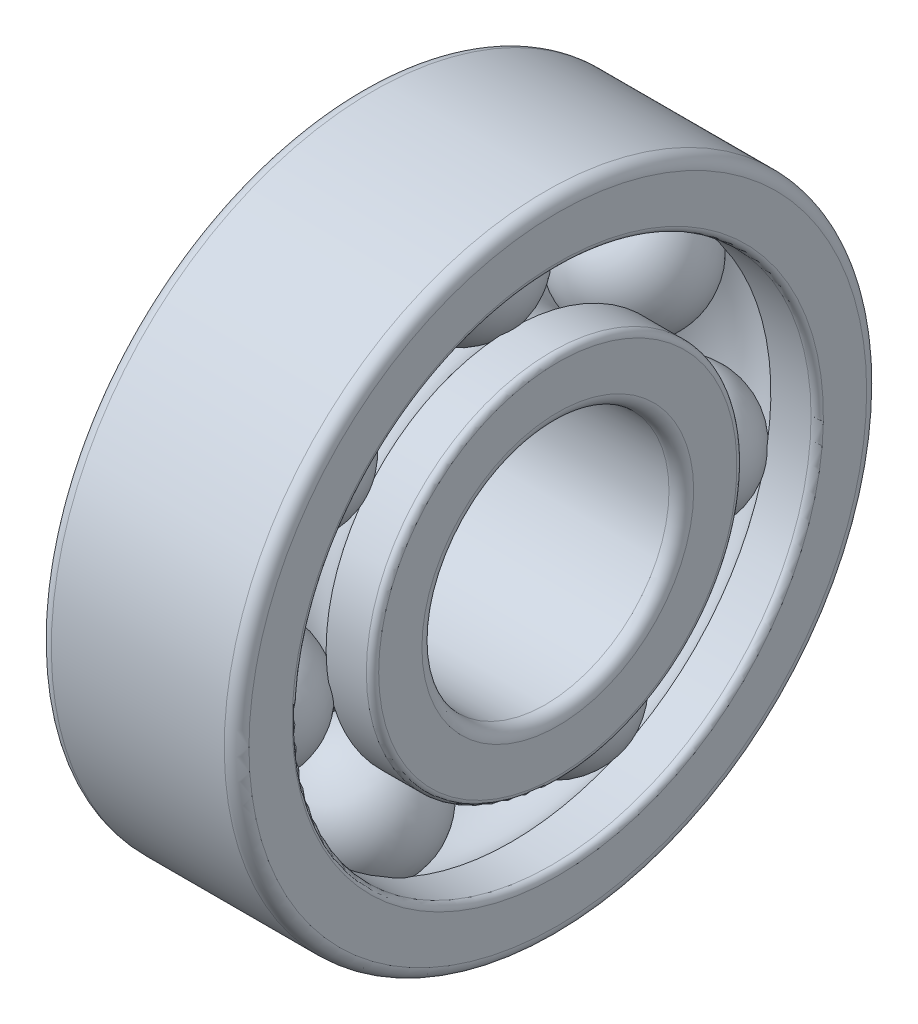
ISO-10303-21;
HEADER;
FILE_DESCRIPTION(('STEP AP214'),'2;1');
FILE_NAME('part.step','',(''),(''),'','','');
FILE_SCHEMA(('AUTOMOTIVE_DESIGN { 1 0 10303 214 1 1 1 1 }'));
ENDSEC;
DATA;
#1=APPLICATION_CONTEXT('core data for automotive mechanical design processes');
#2=APPLICATION_PROTOCOL_DEFINITION('international standard','automotive_design',2000,#1);
#3=PRODUCT_CONTEXT('',#1,'mechanical');
#4=PRODUCT('Part','Part','',(#3));
#5=PRODUCT_RELATED_PRODUCT_CATEGORY('part','',(#4));
#6=PRODUCT_DEFINITION_FORMATION('','',#4);
#7=PRODUCT_DEFINITION_CONTEXT('part definition',#1,'design');
#8=PRODUCT_DEFINITION('design','',#6,#7);
#9=PRODUCT_DEFINITION_SHAPE('','',#8);
#10=(LENGTH_UNIT() NAMED_UNIT(*) SI_UNIT(.MILLI.,.METRE.));
#11=(NAMED_UNIT(*) PLANE_ANGLE_UNIT() SI_UNIT($,.RADIAN.));
#12=(NAMED_UNIT(*) SI_UNIT($,.STERADIAN.) SOLID_ANGLE_UNIT());
#13=UNCERTAINTY_MEASURE_WITH_UNIT(LENGTH_MEASURE(1.E-05),#10,'distance_accuracy_value','');
#14=(GEOMETRIC_REPRESENTATION_CONTEXT(3) GLOBAL_UNCERTAINTY_ASSIGNED_CONTEXT((#13)) GLOBAL_UNIT_ASSIGNED_CONTEXT((#10,
#11,#12)) REPRESENTATION_CONTEXT('',''));
#15=CARTESIAN_POINT('',(0.,0.,0.));
#16=DIRECTION('',(0.,0.,1.));
#17=DIRECTION('',(1.,0.,0.));
#18=AXIS2_PLACEMENT_3D('',#15,#16,#17);
#19=CARTESIAN_POINT('',(0.,0.,0.));
#20=DIRECTION('',(-1.,0.,0.));
#21=DIRECTION('',(0.,0.,1.));
#22=AXIS2_PLACEMENT_3D('',#19,#20,#21);
#23=TOROIDAL_SURFACE('',#22,9.,2.6);
#24=CARTESIAN_POINT('',(2.12387605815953,4.30176022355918,-6.14403019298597));
#25=CARTESIAN_POINT('',(2.08170829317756,4.26597619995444,-6.09617015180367));
#26=CARTESIAN_POINT('',(2.03701105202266,4.23127265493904,-6.04973632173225));
#27=CARTESIAN_POINT('',(1.9428989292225,4.16425750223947,-5.96003651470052));
#28=CARTESIAN_POINT('',(1.89348426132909,4.13194578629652,-5.91677039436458));
#29=CARTESIAN_POINT('',(1.79030883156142,4.06996248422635,-5.83374449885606));
#30=CARTESIAN_POINT('',(1.73655096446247,4.04028916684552,-5.79398242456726));
#31=CARTESIAN_POINT('',(1.62506782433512,3.98377222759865,-5.71822552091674));
#32=CARTESIAN_POINT('',(1.56734260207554,3.95692856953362,-5.68223064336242));
#33=CARTESIAN_POINT('',(1.38874557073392,3.88090855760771,-5.58026455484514));
#34=CARTESIAN_POINT('',(1.26240962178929,3.83621751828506,-5.52027752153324));
#35=CARTESIAN_POINT('',(0.999063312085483,3.76020337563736,-5.41820426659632));
#36=CARTESIAN_POINT('',(0.862055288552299,3.72887735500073,-5.37611413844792));
#37=CARTESIAN_POINT('',(0.581203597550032,3.68041904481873,-5.31098947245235));
#38=CARTESIAN_POINT('',(0.437362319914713,3.66328183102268,-5.28794832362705));
#39=CARTESIAN_POINT('',(0.146879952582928,3.64366761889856,-5.26157590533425));
#40=CARTESIAN_POINT('',(0.000238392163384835,3.64119310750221,-5.25824797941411));
#41=CARTESIAN_POINT('',(-0.291597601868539,3.65097416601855,-5.27140006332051));
#42=CARTESIAN_POINT('',(-0.436792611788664,3.66322361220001,-5.28787183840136));
#43=CARTESIAN_POINT('',(-0.721673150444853,3.70210474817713,-5.34013579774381));
#44=CARTESIAN_POINT('',(-0.861358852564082,3.72873598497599,-5.37592737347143));
#45=CARTESIAN_POINT('',(-1.1312925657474,3.79564350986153,-5.46580045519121));
#46=CARTESIAN_POINT('',(-1.26153772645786,3.8359238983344,-5.51988745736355));
#47=CARTESIAN_POINT('',(-1.50883680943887,3.92901284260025,-5.6447991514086));
#48=CARTESIAN_POINT('',(-1.62589668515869,3.98181571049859,-5.71561624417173));
#49=CARTESIAN_POINT('',(-1.80754663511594,4.07915966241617,-5.84606958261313));
#50=CARTESIAN_POINT('',(-1.87670821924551,4.12068151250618,-5.90168969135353));
#51=CARTESIAN_POINT('',(-2.0066965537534,4.2080769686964,-6.01869808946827));
#52=CARTESIAN_POINT('',(-2.06753540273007,4.25394409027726,-6.08007778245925));
#53=CARTESIAN_POINT('',(-2.12387605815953,4.30176022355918,-6.14403019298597));
#54=B_SPLINE_CURVE_WITH_KNOTS('',3,(#24,#25,#26,#27,#28,#29,#30,#31,#32,#33,#34,#35,#36,#37,#38,
#39,#40,#41,#42,#43,#44,#45,#46,#47,#48,#49,#50,#51,#52,#53),.UNSPECIFIED.,.F.,.F.,(4,2,2,2,2,2,
2,2,2,2,2,2,2,2,4),(0.,0.219343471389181,0.438677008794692,0.657865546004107,0.877051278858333,
1.31524332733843,1.75333967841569,2.19128392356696,2.62930244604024,3.06713885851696,
3.50496148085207,3.94291574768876,4.38067146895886,4.67404372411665,4.96698487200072),.UNSPECIFIED.);
#55=CARTESIAN_POINT('',(2.12367605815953,4.30159056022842,-6.14380327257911));
#56=VERTEX_POINT('',#55);
#57=CARTESIAN_POINT('',(-2.12367605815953,4.30159056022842,-6.14380327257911));
#58=VERTEX_POINT('',#57);
#59=EDGE_CURVE('E1046',#56,#58,#54,.T.);
#60=ORIENTED_EDGE('',*,*,#59,.F.);
#61=CARTESIAN_POINT('',(2.12367605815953,0.,0.));
#62=DIRECTION('',(-1.,0.,0.));
#63=DIRECTION('',(0.,0.,1.));
#64=AXIS2_PLACEMENT_3D('',#61,#62,#63);
#65=CIRCLE('',#64,7.5);
#66=CARTESIAN_POINT('',(2.12367605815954,-1.20990284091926,-7.40176567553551));
#67=VERTEX_POINT('',#66);
#68=EDGE_CURVE('E367',#56,#67,#65,.T.);
#69=ORIENTED_EDGE('',*,*,#68,.T.);
#70=CARTESIAN_POINT('',(-2.12387605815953,-1.20995724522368,-7.40204373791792));
#71=CARTESIAN_POINT('',(-2.08170829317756,-1.19848264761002,-7.34339722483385));
#72=CARTESIAN_POINT('',(-2.03701105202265,-1.18736271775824,-7.2865044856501));
#73=CARTESIAN_POINT('',(-1.9428989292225,-1.16590343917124,-7.17661096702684));
#74=CARTESIAN_POINT('',(-1.89348426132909,-1.15556405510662,-7.1236100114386));
#75=CARTESIAN_POINT('',(-1.79030883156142,-1.13574261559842,-7.02191271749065));
#76=CARTESIAN_POINT('',(-1.73655096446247,-1.1262599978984,-6.973213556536));
#77=CARTESIAN_POINT('',(-1.62506782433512,-1.1082096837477,-6.88043716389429));
#78=CARTESIAN_POINT('',(-1.56734260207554,-1.09964197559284,-6.83635987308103));
#79=CARTESIAN_POINT('',(-1.38874557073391,-1.07539173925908,-6.71150775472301));
#80=CARTESIAN_POINT('',(-1.26240962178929,-1.06115390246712,-6.6380705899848));
#81=CARTESIAN_POINT('',(-0.999063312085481,-1.03695545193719,-6.51312446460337));
#82=CARTESIAN_POINT('',(-0.862055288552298,-1.02699390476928,-6.46161071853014));
#83=CARTESIAN_POINT('',(-0.581203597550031,-1.01159100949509,-6.3819101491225));
#84=CARTESIAN_POINT('',(-0.437362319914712,-1.00614809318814,-6.35371523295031));
#85=CARTESIAN_POINT('',(-0.146879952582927,-0.999918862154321,-6.32144421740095));
#86=CARTESIAN_POINT('',(-0.000238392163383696,-0.999133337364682,-6.31737220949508));
#87=CARTESIAN_POINT('',(0.29159760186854,-1.00223929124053,-6.33346566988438));
#88=CARTESIAN_POINT('',(0.436792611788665,-1.00612882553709,-6.35362106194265));
#89=CARTESIAN_POINT('',(0.721673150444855,-1.01848303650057,-6.4175791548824));
#90=CARTESIAN_POINT('',(0.861358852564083,-1.02694756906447,-6.46138111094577));
#91=CARTESIAN_POINT('',(1.1312925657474,-1.04823469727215,-6.57138404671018));
#92=CARTESIAN_POINT('',(1.26153772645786,-1.06105860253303,-6.63759175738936));
#93=CARTESIAN_POINT('',(1.50883680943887,-1.09073169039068,-6.79052308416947));
#94=CARTESIAN_POINT('',(1.62589668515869,-1.10757904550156,-6.87723738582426));
#95=CARTESIAN_POINT('',(1.80754663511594,-1.13868133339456,-7.03700774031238));
#96=CARTESIAN_POINT('',(1.87670821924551,-1.15195856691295,-7.10513538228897));
#97=CARTESIAN_POINT('',(2.0066965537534,-1.17993111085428,-7.24847577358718));
#98=CARTESIAN_POINT('',(2.06753540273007,-1.19462430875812,-7.32367796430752));
#99=CARTESIAN_POINT('',(2.12387605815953,-1.20995724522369,-7.40204373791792));
#100=B_SPLINE_CURVE_WITH_KNOTS('',3,(#70,#71,#72,#73,#74,#75,#76,#77,#78,#79,#80,#81,#82,#83,
#84,#85,#86,#87,#88,#89,#90,#91,#92,#93,#94,#95,#96,#97,#98,#99),.UNSPECIFIED.,.F.,.F.,(4,2,2,2,
2,2,2,2,2,2,2,2,2,2,4),(0.,0.219343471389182,0.438677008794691,0.657865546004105,
0.877051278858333,1.31524332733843,1.75333967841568,2.19128392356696,2.62930244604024,
3.06713885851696,3.50496148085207,3.94291574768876,4.38067146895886,4.67404372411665,
4.96698487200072),.UNSPECIFIED.);
#101=CARTESIAN_POINT('',(-2.12367605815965,-1.20990284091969,-7.40176567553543));
#102=VERTEX_POINT('',#101);
#103=EDGE_CURVE('E652',#102,#67,#100,.T.);
#104=ORIENTED_EDGE('',*,*,#103,.F.);
#105=CARTESIAN_POINT('',(-2.12367605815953,0.,0.));
#106=DIRECTION('',(-1.,0.,0.));
#107=DIRECTION('',(0.,0.,1.));
#108=AXIS2_PLACEMENT_3D('',#105,#106,#107);
#109=CIRCLE('',#108,7.5);
#110=EDGE_CURVE('E362',#58,#102,#109,.T.);
#111=ORIENTED_EDGE('',*,*,#110,.F.);
#112=EDGE_LOOP('',(#60,#69,#104,#111));
#113=FACE_BOUND('',#112,.T.);
#114=ADVANCED_FACE('F33',(#113),#23,.F.);
#115=CARTESIAN_POINT('',(2.12387605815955,-2.12149260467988,-7.19399174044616));
#116=CARTESIAN_POINT('',(2.08170829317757,-2.10638509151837,-7.13617441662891));
#117=CARTESIAN_POINT('',(2.03701105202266,-2.09171896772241,-7.08009107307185));
#118=CARTESIAN_POINT('',(1.9428989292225,-2.06337209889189,-6.97176960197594));
#119=CARTESIAN_POINT('',(1.8934842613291,-2.04969130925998,-6.91953130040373));
#120=CARTESIAN_POINT('',(1.79030883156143,-2.0234250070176,-6.8193050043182));
#121=CARTESIAN_POINT('',(1.73655096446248,-2.01083877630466,-6.77131422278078));
#122=CARTESIAN_POINT('',(1.62506782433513,-1.98684737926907,-6.67989384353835));
#123=CARTESIAN_POINT('',(1.56734260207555,-1.97544219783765,-6.63646418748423));
#124=CARTESIAN_POINT('',(1.38874557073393,-1.9431196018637,-6.51345453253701));
#125=CARTESIAN_POINT('',(1.2624096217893,-1.92408425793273,-6.44111236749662));
#126=CARTESIAN_POINT('',(0.999063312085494,-1.89167421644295,-6.31804048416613));
#127=CARTESIAN_POINT('',(0.862055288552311,-1.87829828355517,-6.26730604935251));
#128=CARTESIAN_POINT('',(0.581203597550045,-1.85759503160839,-6.18881525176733));
#129=CARTESIAN_POINT('',(0.437362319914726,-1.85026561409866,-6.16105091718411));
#130=CARTESIAN_POINT('',(0.146879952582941,-1.84187608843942,-6.12927297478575));
#131=CARTESIAN_POINT('',(0.000238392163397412,-1.84081704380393,-6.12526339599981));
#132=CARTESIAN_POINT('',(-0.291597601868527,-1.84500136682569,-6.14111072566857));
#133=CARTESIAN_POINT('',(-0.436792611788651,-1.85024211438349,-6.16095771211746));
#134=CARTESIAN_POINT('',(-0.721673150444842,-1.86686173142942,-6.22394225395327));
#135=CARTESIAN_POINT('',(-0.861358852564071,-1.87824040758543,-6.2670790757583));
#136=CARTESIAN_POINT('',(-1.13129256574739,-1.90678985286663,-6.37542443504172));
#137=CARTESIAN_POINT('',(-1.26153772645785,-1.92396236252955,-6.44063960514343));
#138=CARTESIAN_POINT('',(-1.50883680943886,-1.96358225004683,-6.59130063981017));
#139=CARTESIAN_POINT('',(-1.62589668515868,-1.98602723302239,-6.67673731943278));
#140=CARTESIAN_POINT('',(-1.80754663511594,-2.0273267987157,-6.83418021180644));
#141=CARTESIAN_POINT('',(-1.87670821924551,-2.04492390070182,-6.90132187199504));
#142=CARTESIAN_POINT('',(-2.0066965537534,-2.08191457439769,-7.04260393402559));
#143=CARTESIAN_POINT('',(-2.06753540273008,-2.10130546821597,-7.11673390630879));
#144=CARTESIAN_POINT('',(-2.12387605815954,-2.12149260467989,-7.19399174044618));
#145=B_SPLINE_CURVE_WITH_KNOTS('',3,(#115,#116,#117,#118,#119,#120,#121,#122,#123,#124,#125,
#126,#127,#128,#129,#130,#131,#132,#133,#134,#135,#136,#137,#138,#139,#140,#141,#142,#143,#144),
.UNSPECIFIED.,.F.,.F.,(4,2,2,2,2,2,2,2,2,2,2,2,2,2,4),(0.,0.219343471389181,0.438677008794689,
0.657865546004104,0.877051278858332,1.31524332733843,1.75333967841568,2.19128392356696,
2.62930244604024,3.06713885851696,3.50496148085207,3.94291574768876,4.38067146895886,
4.67404372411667,4.96698487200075),.UNSPECIFIED.);
#146=CARTESIAN_POINT('',(2.12367605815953,-2.12142097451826,-7.19371760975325));
#147=VERTEX_POINT('',#146);
#148=CARTESIAN_POINT('',(-2.12367605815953,-2.12142097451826,-7.19371760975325));
#149=VERTEX_POINT('',#148);
#150=EDGE_CURVE('E659',#147,#149,#145,.T.);
#151=ORIENTED_EDGE('',*,*,#150,.F.);
#152=CARTESIAN_POINT('',(2.12367605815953,-6.54129551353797,-3.66898528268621));
#153=VERTEX_POINT('',#152);
#154=EDGE_CURVE('E373',#147,#153,#65,.T.);
#155=ORIENTED_EDGE('',*,*,#154,.T.);
#156=CARTESIAN_POINT('',(-2.51662193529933,-7.29311922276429,-4.05958131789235));
#157=CARTESIAN_POINT('',(-2.49825179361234,-7.23023161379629,-4.02697250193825));
#158=CARTESIAN_POINT('',(-2.47688063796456,-7.16804443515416,-3.99471156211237));
#159=CARTESIAN_POINT('',(-2.42831828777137,-7.04550218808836,-3.93111100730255));
#160=CARTESIAN_POINT('',(-2.4011273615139,-6.98514703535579,-3.89977134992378));
#161=CARTESIAN_POINT('',(-2.3411266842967,-6.86673556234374,-3.8382573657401));
#162=CARTESIAN_POINT('',(-2.30832086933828,-6.80867766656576,-3.80808224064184));
#163=CARTESIAN_POINT('',(-2.23733071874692,-6.69524372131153,-3.74909906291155));
#164=CARTESIAN_POINT('',(-2.19914645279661,-6.63986763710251,-3.72029099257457));
#165=CARTESIAN_POINT('',(-2.07690776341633,-6.47836373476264,-3.63623477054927));
#166=CARTESIAN_POINT('',(-1.98510842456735,-6.37674407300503,-3.58329423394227));
#167=CARTESIAN_POINT('',(-1.78364320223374,-6.18872203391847,-3.48526253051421));
#168=CARTESIAN_POINT('',(-1.67398077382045,-6.10231672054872,-3.44016984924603));
#169=CARTESIAN_POINT('',(-1.43983054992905,-5.94705748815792,-3.35908927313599));
#170=CARTESIAN_POINT('',(-1.31534200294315,-5.87820445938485,-3.32310184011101));
#171=CARTESIAN_POINT('',(-1.05507160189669,-5.76001414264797,-3.2612956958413));
#172=CARTESIAN_POINT('',(-0.919288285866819,-5.71067938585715,-3.23547830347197));
#173=CARTESIAN_POINT('',(-0.640356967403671,-5.63294332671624,-3.19478577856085));
#174=CARTESIAN_POINT('',(-0.497212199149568,-5.60453291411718,-3.17990588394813));
#175=CARTESIAN_POINT('',(-0.207569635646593,-5.56941400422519,-3.16151106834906));
#176=CARTESIAN_POINT('',(-0.0610718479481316,-5.56270545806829,-3.15799612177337));
#177=CARTESIAN_POINT('',(0.231069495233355,-5.57117655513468,-3.16243381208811));
#178=CARTESIAN_POINT('',(0.376713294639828,-5.58634960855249,-3.17038299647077));
#179=CARTESIAN_POINT('',(0.66304234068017,-5.63814528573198,-3.19750795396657));
#180=CARTESIAN_POINT('',(0.80372823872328,-5.67476508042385,-3.21668224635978));
#181=CARTESIAN_POINT('',(1.07615118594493,-5.76840174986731,-3.26568121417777));
#182=CARTESIAN_POINT('',(1.20788827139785,-5.82541854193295,-3.29550584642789));
#183=CARTESIAN_POINT('',(1.45877504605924,-5.9583189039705,-3.36497039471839));
#184=CARTESIAN_POINT('',(1.57792227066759,-6.03420615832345,-3.40461222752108));
#185=CARTESIAN_POINT('',(1.74449807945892,-6.16043043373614,-3.47049066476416));
#186=CARTESIAN_POINT('',(1.79801876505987,-6.20459155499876,-3.49353026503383));
#187=CARTESIAN_POINT('',(1.90069538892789,-6.29677023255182,-3.54160021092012));
#188=CARTESIAN_POINT('',(1.94985127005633,-6.34478783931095,-3.56663058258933));
#189=CARTESIAN_POINT('',(2.04345748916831,-6.4443641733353,-3.61851338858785));
#190=CARTESIAN_POINT('',(2.08790454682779,-6.4959253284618,-3.64536707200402));
#191=CARTESIAN_POINT('',(2.17175273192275,-6.6021938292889,-3.70068712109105));
#192=CARTESIAN_POINT('',(2.21115363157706,-6.65690131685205,-3.72915355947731));
#193=CARTESIAN_POINT('',(2.2478787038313,-6.71299694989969,-3.75832818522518));
#194=B_SPLINE_CURVE_WITH_KNOTS('',3,(#156,#157,#158,#159,#160,#161,#162,#163,#164,#165,#166,
#167,#168,#169,#170,#171,#172,#173,#174,#175,#176,#177,#178,#179,#180,#181,#182,#183,#184,#185,
#186,#187,#188,#189,#190,#191,#192,#193),.UNSPECIFIED.,.F.,.F.,(4,2,2,2,2,2,2,2,2,2,2,2,2,2,2,2,
2,2,4),(0.,0.219475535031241,0.438940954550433,0.658253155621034,0.87756251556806,
1.31575576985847,1.75386436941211,2.1919951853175,2.63018280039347,3.06817952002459,
3.50617525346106,3.94403910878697,4.38184521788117,4.81964955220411,5.2575394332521,
5.47666540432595,5.69579424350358,5.91507474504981,6.13436514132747),.UNSPECIFIED.);
#195=CARTESIAN_POINT('',(-2.12367605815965,-6.54129551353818,-3.66898528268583));
#196=VERTEX_POINT('',#195);
#197=EDGE_CURVE('E672',#196,#153,#194,.T.);
#198=ORIENTED_EDGE('',*,*,#197,.F.);
#199=EDGE_CURVE('E706',#149,#196,#109,.T.);
#200=ORIENTED_EDGE('',*,*,#199,.F.);
#201=EDGE_LOOP('',(#151,#155,#198,#200));
#202=FACE_BOUND('',#201,.T.);
#203=ADVANCED_FACE('F297',(#202),#23,.F.);
#204=CARTESIAN_POINT('',(2.12387605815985,-6.94721823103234,-2.82673077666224));
#205=CARTESIAN_POINT('',(2.08170829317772,-6.89259544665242,-2.80249379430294));
#206=CARTESIAN_POINT('',(2.03701105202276,-6.83960354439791,-2.77899283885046));
#207=CARTESIAN_POINT('',(1.94289892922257,-6.73724042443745,-2.73361798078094));
#208=CARTESIAN_POINT('',(1.89348426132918,-6.68786904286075,-2.71174400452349));
#209=CARTESIAN_POINT('',(1.79030883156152,-6.59313219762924,-2.66978975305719));
#210=CARTESIAN_POINT('',(1.73655096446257,-6.54776410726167,-2.64970830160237));
#211=CARTESIAN_POINT('',(1.62506782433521,-6.46133038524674,-2.61146585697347));
#212=CARTESIAN_POINT('',(1.56734260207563,-6.42026469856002,-2.59330483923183));
#213=CARTESIAN_POINT('',(1.38874557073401,-6.30393906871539,-2.54188039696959));
#214=CARTESIAN_POINT('',(1.26240962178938,-6.23551134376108,-2.51165822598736));
#215=CARTESIAN_POINT('',(0.999063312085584,-6.11908254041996,-2.46026335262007));
#216=CARTESIAN_POINT('',(0.862055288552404,-6.07107700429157,-2.43908867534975));
#217=CARTESIAN_POINT('',(0.581203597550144,-5.99680216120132,-2.40633691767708));
#218=CARTESIAN_POINT('',(0.437362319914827,-5.97052531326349,-2.39475650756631));
#219=CARTESIAN_POINT('',(0.146879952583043,-5.94044953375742,-2.38150247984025));
#220=CARTESIAN_POINT('',(0.000238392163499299,-5.93665441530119,-2.37983054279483));
#221=CARTESIAN_POINT('',(-0.291597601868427,-5.95165323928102,-2.38643975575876));
#222=CARTESIAN_POINT('',(-0.436792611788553,-5.97043779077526,-2.39471676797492));
#223=CARTESIAN_POINT('',(-0.721673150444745,-6.03004325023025,-2.4209932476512));
#224=CARTESIAN_POINT('',(-0.861358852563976,-6.07086346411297,-2.43899240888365));
#225=CARTESIAN_POINT('',(-1.13129256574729,-6.1733715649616,-2.48422378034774));
#226=CARTESIAN_POINT('',(-1.26153772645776,-6.23506572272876,-2.51145876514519));
#227=CARTESIAN_POINT('',(-1.50883680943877,-6.37755985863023,-2.57441830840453));
#228=CARTESIAN_POINT('',(-1.6258966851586,-6.45835116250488,-2.61013901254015));
#229=CARTESIAN_POINT('',(-1.8075466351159,-6.60719483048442,-2.67601374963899));
#230=CARTESIAN_POINT('',(-1.8767082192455,-6.67065990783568,-2.70411792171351));
#231=CARTESIAN_POINT('',(-2.00669655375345,-6.80418197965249,-2.76328537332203));
#232=CARTESIAN_POINT('',(-2.06753540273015,-6.87422915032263,-2.79434424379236));
#233=CARTESIAN_POINT('',(-2.12387605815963,-6.94721823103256,-2.82673077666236));
#234=B_SPLINE_CURVE_WITH_KNOTS('',3,(#204,#205,#206,#207,#208,#209,#210,#211,#212,#213,#214,
#215,#216,#217,#218,#219,#220,#221,#222,#223,#224,#225,#226,#227,#228,#229,#230,#231,#232,#233),
.UNSPECIFIED.,.F.,.F.,(4,2,2,2,2,2,2,2,2,2,2,2,2,2,4),(0.,0.219343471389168,0.438677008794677,
0.657865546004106,0.877051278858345,1.31524332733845,1.7533396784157,2.19128392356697,
2.62930244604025,3.06713885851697,3.50496148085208,3.94291574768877,4.38067146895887,
4.67404372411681,4.96698487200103),.UNSPECIFIED.);
#235=CARTESIAN_POINT('',(2.12367605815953,-6.94695924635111,-2.82661586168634));
#236=VERTEX_POINT('',#235);
#237=CARTESIAN_POINT('',(-2.12367605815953,-6.94695924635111,-2.82661586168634));
#238=VERTEX_POINT('',#237);
#239=EDGE_CURVE('E677',#236,#238,#234,.T.);
#240=ORIENTED_EDGE('',*,*,#239,.F.);
#241=CARTESIAN_POINT('',(2.12367605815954,-6.94695924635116,2.82661586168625));
#242=VERTEX_POINT('',#241);
#243=EDGE_CURVE('E376',#236,#242,#65,.T.);
#244=ORIENTED_EDGE('',*,*,#243,.T.);
#245=CARTESIAN_POINT('',(-2.12387605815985,-6.94721823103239,2.82673077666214));
#246=CARTESIAN_POINT('',(-2.08170829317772,-6.89259544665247,2.80249379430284));
#247=CARTESIAN_POINT('',(-2.03701105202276,-6.83960354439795,2.77899283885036));
#248=CARTESIAN_POINT('',(-1.94289892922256,-6.73724042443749,2.73361798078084));
#249=CARTESIAN_POINT('',(-1.89348426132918,-6.68786904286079,2.71174400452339));
#250=CARTESIAN_POINT('',(-1.79030883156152,-6.59313219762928,2.66978975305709));
#251=CARTESIAN_POINT('',(-1.73655096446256,-6.54776410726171,2.64970830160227));
#252=CARTESIAN_POINT('',(-1.62506782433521,-6.46133038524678,2.61146585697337));
#253=CARTESIAN_POINT('',(-1.56734260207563,-6.42026469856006,2.59330483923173));
#254=CARTESIAN_POINT('',(-1.38874557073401,-6.30393906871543,2.5418803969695));
#255=CARTESIAN_POINT('',(-1.26240962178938,-6.23551134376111,2.51165822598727));
#256=CARTESIAN_POINT('',(-0.999063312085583,-6.11908254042,2.46026335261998));
#257=CARTESIAN_POINT('',(-0.862055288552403,-6.07107700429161,2.43908867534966));
#258=CARTESIAN_POINT('',(-0.581203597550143,-5.99680216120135,2.40633691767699));
#259=CARTESIAN_POINT('',(-0.437362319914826,-5.97052531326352,2.39475650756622));
#260=CARTESIAN_POINT('',(-0.146879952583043,-5.94044953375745,2.38150247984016));
#261=CARTESIAN_POINT('',(-0.000238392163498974,-5.93665441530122,2.37983054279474));
#262=CARTESIAN_POINT('',(0.291597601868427,-5.95165323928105,2.38643975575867));
#263=CARTESIAN_POINT('',(0.436792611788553,-5.9704377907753,2.39471676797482));
#264=CARTESIAN_POINT('',(0.721673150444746,-6.03004325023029,2.42099324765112));
#265=CARTESIAN_POINT('',(0.861358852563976,-6.070863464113,2.43899240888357));
#266=CARTESIAN_POINT('',(1.13129256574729,-6.17337156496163,2.48422378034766));
#267=CARTESIAN_POINT('',(1.26153772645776,-6.2350657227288,2.5114587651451));
#268=CARTESIAN_POINT('',(1.50883680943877,-6.37755985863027,2.57441830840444));
#269=CARTESIAN_POINT('',(1.62589668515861,-6.45835116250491,2.61013901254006));
#270=CARTESIAN_POINT('',(1.8075466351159,-6.60719483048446,2.6760137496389));
#271=CARTESIAN_POINT('',(1.8767082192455,-6.67065990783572,2.70411792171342));
#272=CARTESIAN_POINT('',(2.00669655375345,-6.80418197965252,2.76328537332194));
#273=CARTESIAN_POINT('',(2.06753540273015,-6.87422915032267,2.79434424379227));
#274=CARTESIAN_POINT('',(2.12387605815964,-6.9472182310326,2.82673077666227));
#275=B_SPLINE_CURVE_WITH_KNOTS('',3,(#245,#246,#247,#248,#249,#250,#251,#252,#253,#254,#255,
#256,#257,#258,#259,#260,#261,#262,#263,#264,#265,#266,#267,#268,#269,#270,#271,#272,#273,#274),
.UNSPECIFIED.,.F.,.F.,(4,2,2,2,2,2,2,2,2,2,2,2,2,2,4),(0.,0.219343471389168,0.438677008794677,
0.657865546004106,0.877051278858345,1.31524332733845,1.75333967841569,2.19128392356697,
2.62930244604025,3.06713885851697,3.50496148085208,3.94291574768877,4.38067146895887,
4.67404372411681,4.96698487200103),.UNSPECIFIED.);
#276=CARTESIAN_POINT('',(-2.12367605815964,-6.94695924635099,2.82661586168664));
#277=VERTEX_POINT('',#276);
#278=EDGE_CURVE('E692',#277,#242,#275,.T.);
#279=ORIENTED_EDGE('',*,*,#278,.F.);
#280=EDGE_CURVE('E703',#238,#277,#109,.T.);
#281=ORIENTED_EDGE('',*,*,#280,.F.);
#282=EDGE_LOOP('',(#240,#244,#279,#281));
#283=FACE_BOUND('',#282,.T.);
#284=ADVANCED_FACE('F304',(#283),#23,.F.);
#285=CARTESIAN_POINT('',(-2.1238760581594,5.03275482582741,-5.56108145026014));
#286=CARTESIAN_POINT('',(-2.08170829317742,4.99405743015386,-5.51554474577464));
#287=CARTESIAN_POINT('',(-2.03701105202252,4.95651005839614,-5.47137879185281));
#288=CARTESIAN_POINT('',(-1.94289892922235,4.88397148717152,-5.38608376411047));
#289=CARTESIAN_POINT('',(-1.89348426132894,4.84898017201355,-5.34495455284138));
#290=CARTESIAN_POINT('',(-1.79030883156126,4.78182849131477,-5.26605030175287));
#291=CARTESIAN_POINT('',(-1.7365509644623,4.74966626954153,-5.22827306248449));
#292=CARTESIAN_POINT('',(-1.62506782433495,4.68838495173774,-5.15631562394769));
#293=CARTESIAN_POINT('',(-1.56734260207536,4.6592658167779,-5.122135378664));
#294=CARTESIAN_POINT('',(-1.38874557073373,4.57677227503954,-5.02533175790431));
#295=CARTESIAN_POINT('',(-1.26240962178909,4.52823393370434,-4.96841284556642));
#296=CARTESIAN_POINT('',(-0.999063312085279,4.44563460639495,-4.87159110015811));
#297=CARTESIAN_POINT('',(-0.862055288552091,4.41157046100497,-4.83168455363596));
#298=CARTESIAN_POINT('',(-0.581203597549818,4.35886159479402,-4.76994959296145));
#299=CARTESIAN_POINT('',(-0.437362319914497,4.34021152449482,-4.74811490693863));
#300=CARTESIAN_POINT('',(-0.146879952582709,4.31886489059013,-4.72312404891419));
#301=CARTESIAN_POINT('',(-0.000238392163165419,4.31617103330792,-4.71997104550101));
#302=CARTESIAN_POINT('',(0.291597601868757,4.3268168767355,-4.73243348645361));
#303=CARTESIAN_POINT('',(0.43679261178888,4.34014991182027,-4.7480411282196));
#304=CARTESIAN_POINT('',(0.721673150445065,4.38245163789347,-4.79757725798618));
#305=CARTESIAN_POINT('',(0.861358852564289,4.41141983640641,-4.831505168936));
#306=CARTESIAN_POINT('',(1.13129256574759,4.4841512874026,-4.91673382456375));
#307=CARTESIAN_POINT('',(1.26153772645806,4.52791898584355,-4.96803978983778));
#308=CARTESIAN_POINT('',(1.50883680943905,4.62898464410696,-5.08659026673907));
#309=CARTESIAN_POINT('',(1.62589668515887,4.686276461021,-5.15382754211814));
#310=CARTESIAN_POINT('',(1.80754663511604,4.79179799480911,-5.27775947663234));
#311=CARTESIAN_POINT('',(1.87670821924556,4.83678411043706,-5.33061692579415));
#312=CARTESIAN_POINT('',(2.00669655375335,4.93141154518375,-5.441858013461));
#313=CARTESIAN_POINT('',(2.06753540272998,4.9810459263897,-5.50023341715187));
#314=CARTESIAN_POINT('',(2.1238760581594,5.03275482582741,-5.56108145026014));
#315=B_SPLINE_CURVE_WITH_KNOTS('',3,(#285,#286,#287,#288,#289,#290,#291,#292,#293,#294,#295,
#296,#297,#298,#299,#300,#301,#302,#303,#304,#305,#306,#307,#308,#309,#310,#311,#312,#313,#314),
.UNSPECIFIED.,.F.,.F.,(4,2,2,2,2,2,2,2,2,2,2,2,2,2,4),(0.,0.219343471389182,0.438677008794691,
0.657865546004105,0.877051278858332,1.31524332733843,1.75333967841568,2.19128392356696,
2.62930244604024,3.06713885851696,3.50496148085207,3.94291574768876,4.38067146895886,
4.67404372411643,4.96698487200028),.UNSPECIFIED.);
#316=CARTESIAN_POINT('',(-2.12367605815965,5.03257134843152,-5.56086554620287));
#317=VERTEX_POINT('',#316);
#318=CARTESIAN_POINT('',(2.12367605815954,5.03257134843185,-5.56086554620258));
#319=VERTEX_POINT('',#318);
#320=EDGE_CURVE('E1043',#317,#319,#315,.T.);
#321=ORIENTED_EDGE('',*,*,#320,.F.);
#322=CARTESIAN_POINT('',(-2.12367605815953,7.48541666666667,-0.467479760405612));
#323=VERTEX_POINT('',#322);
#324=EDGE_CURVE('E357',#323,#317,#109,.T.);
#325=ORIENTED_EDGE('',*,*,#324,.F.);
#326=CARTESIAN_POINT('',(2.12387605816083,7.48569986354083,-0.467488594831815));
#327=CARTESIAN_POINT('',(2.08170829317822,7.42597040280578,-0.465625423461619));
#328=CARTESIAN_POINT('',(2.03701105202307,7.36802966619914,-0.463806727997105));
#329=CARTESIAN_POINT('',(1.94289892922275,7.25611626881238,-0.460274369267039));
#330=CARTESIAN_POINT('',(1.89348426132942,7.20214342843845,-0.45856070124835));
#331=CARTESIAN_POINT('',(1.79030883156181,7.09858521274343,-0.455255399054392));
#332=CARTESIAN_POINT('',(1.73655096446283,7.04899696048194,-0.453663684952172));
#333=CARTESIAN_POINT('',(1.62506782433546,6.95453009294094,-0.450616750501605));
#334=CARTESIAN_POINT('',(1.56734260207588,6.90965141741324,-0.449161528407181));
#335=CARTESIAN_POINT('',(1.38874557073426,6.78253341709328,-0.445021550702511));
#336=CARTESIAN_POINT('',(1.26240962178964,6.70776925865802,-0.44256110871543));
#337=CARTESIAN_POINT('',(0.999063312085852,6.58057113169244,-0.43834972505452));
#338=CARTESIAN_POINT('',(0.862055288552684,6.52813229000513,-0.436598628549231));
#339=CARTESIAN_POINT('',(0.581203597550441,6.44700251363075,-0.433880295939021));
#340=CARTESIAN_POINT('',(0.43736231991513,6.41830334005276,-0.432912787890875));
#341=CARTESIAN_POINT('',(0.14687995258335,6.38545529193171,-0.431804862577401));
#342=CARTESIAN_POINT('',(0.000238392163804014,6.38131058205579,-0.431664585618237));
#343=CARTESIAN_POINT('',(-0.291597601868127,6.39769168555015,-0.432217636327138));
#344=CARTESIAN_POINT('',(-0.436792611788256,6.41820724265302,-0.432910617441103));
#345=CARTESIAN_POINT('',(-0.721673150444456,6.48331084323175,-0.435098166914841));
#346=CARTESIAN_POINT('',(-0.861358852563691,6.52789812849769,-0.436592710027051));
#347=CARTESIAN_POINT('',(-1.13129256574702,6.63987989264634,-0.44031725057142));
#348=CARTESIAN_POINT('',(-1.2615377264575,6.70728122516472,-0.442547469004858));
#349=CARTESIAN_POINT('',(-1.50883680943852,6.86298112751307,-0.447648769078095));
#350=CARTESIAN_POINT('',(-1.62589668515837,6.95127020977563,-0.450519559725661));
#351=CARTESIAN_POINT('',(-1.80754663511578,7.1139556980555,-0.455749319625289));
#352=CARTESIAN_POINT('',(-1.87670821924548,7.1833297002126,-0.457964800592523));
#353=CARTESIAN_POINT('',(-2.00669655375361,7.32930072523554,-0.462589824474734));
#354=CARTESIAN_POINT('',(-2.06753540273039,7.40588698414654,-0.464999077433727));
#355=CARTESIAN_POINT('',(-2.12387605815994,7.48569986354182,-0.467488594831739));
#356=B_SPLINE_CURVE_WITH_KNOTS('',3,(#326,#327,#328,#329,#330,#331,#332,#333,#334,#335,#336,
#337,#338,#339,#340,#341,#342,#343,#344,#345,#346,#347,#348,#349,#350,#351,#352,#353,#354,#355),
.UNSPECIFIED.,.F.,.F.,(4,2,2,2,2,2,2,2,2,2,2,2,2,2,4),(0.,0.219343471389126,0.438677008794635,
0.657865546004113,0.877051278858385,1.3152433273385,1.75333967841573,2.191283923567,
2.62930244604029,3.06713885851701,3.50496148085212,3.94291574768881,4.38067146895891,
4.67404372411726,4.96698487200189),.UNSPECIFIED.);
#357=CARTESIAN_POINT('',(2.12367605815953,7.48541666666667,-0.467479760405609));
#358=VERTEX_POINT('',#357);
#359=EDGE_CURVE('E568',#358,#323,#356,.T.);
#360=ORIENTED_EDGE('',*,*,#359,.F.);
#361=EDGE_CURVE('E359',#358,#319,#65,.T.);
#362=ORIENTED_EDGE('',*,*,#361,.T.);
#363=EDGE_LOOP('',(#321,#325,#360,#362));
#364=FACE_BOUND('',#363,.T.);
#365=ADVANCED_FACE('F333',(#364),#23,.F.);
#366=CARTESIAN_POINT('',(2.12387605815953,-1.20995724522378,7.4020437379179));
#367=CARTESIAN_POINT('',(2.08170829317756,-1.19848264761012,7.34339722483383));
#368=CARTESIAN_POINT('',(2.03701105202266,-1.18736271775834,7.28650448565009));
#369=CARTESIAN_POINT('',(1.9428989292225,-1.16590343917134,7.17661096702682));
#370=CARTESIAN_POINT('',(1.89348426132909,-1.15556405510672,7.12361001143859));
#371=CARTESIAN_POINT('',(1.79030883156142,-1.13574261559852,7.02191271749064));
#372=CARTESIAN_POINT('',(1.73655096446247,-1.12625999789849,6.97321355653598));
#373=CARTESIAN_POINT('',(1.62506782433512,-1.10820968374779,6.88043716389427));
#374=CARTESIAN_POINT('',(1.56734260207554,-1.09964197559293,6.83635987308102));
#375=CARTESIAN_POINT('',(1.38874557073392,-1.07539173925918,6.711507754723));
#376=CARTESIAN_POINT('',(1.26240962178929,-1.06115390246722,6.63807058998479));
#377=CARTESIAN_POINT('',(0.999063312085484,-1.03695545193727,6.51312446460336));
#378=CARTESIAN_POINT('',(0.8620552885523,-1.02699390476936,6.46161071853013));
#379=CARTESIAN_POINT('',(0.581203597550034,-1.01159100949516,6.38191014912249));
#380=CARTESIAN_POINT('',(0.437362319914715,-1.00614809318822,6.3537152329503));
#381=CARTESIAN_POINT('',(0.14687995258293,-0.999918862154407,6.32144421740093));
#382=CARTESIAN_POINT('',(0.000238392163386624,-0.99913333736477,6.31737220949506));
#383=CARTESIAN_POINT('',(-0.291597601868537,-1.00223929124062,6.33346566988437));
#384=CARTESIAN_POINT('',(-0.436792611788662,-1.00612882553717,6.35362106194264));
#385=CARTESIAN_POINT('',(-0.721673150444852,-1.01848303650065,6.41757915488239));
#386=CARTESIAN_POINT('',(-0.861358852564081,-1.02694756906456,6.46138111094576));
#387=CARTESIAN_POINT('',(-1.13129256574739,-1.04823469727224,6.57138404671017));
#388=CARTESIAN_POINT('',(-1.26153772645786,-1.06105860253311,6.63759175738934));
#389=CARTESIAN_POINT('',(-1.50883680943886,-1.09073169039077,6.79052308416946));
#390=CARTESIAN_POINT('',(-1.62589668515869,-1.10757904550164,6.87723738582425));
#391=CARTESIAN_POINT('',(-1.80754663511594,-1.13868133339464,7.03700774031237));
#392=CARTESIAN_POINT('',(-1.87670821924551,-1.15195856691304,7.10513538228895));
#393=CARTESIAN_POINT('',(-2.00669655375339,-1.17993111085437,7.24847577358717));
#394=CARTESIAN_POINT('',(-2.06753540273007,-1.19462430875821,7.3236779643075));
#395=CARTESIAN_POINT('',(-2.12387605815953,-1.20995724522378,7.4020437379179));
#396=B_SPLINE_CURVE_WITH_KNOTS('',3,(#366,#367,#368,#369,#370,#371,#372,#373,#374,#375,#376,
#377,#378,#379,#380,#381,#382,#383,#384,#385,#386,#387,#388,#389,#390,#391,#392,#393,#394,#395),
.UNSPECIFIED.,.F.,.F.,(4,2,2,2,2,2,2,2,2,2,2,2,2,2,4),(0.,0.219343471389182,0.438677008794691,
0.657865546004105,0.877051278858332,1.31524332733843,1.75333967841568,2.19128392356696,
2.62930244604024,3.06713885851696,3.50496148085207,3.94291574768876,4.38067146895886,
4.67404372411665,4.96698487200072),.UNSPECIFIED.);
#397=CARTESIAN_POINT('',(2.12367605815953,-1.20990284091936,7.40176567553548));
#398=VERTEX_POINT('',#397);
#399=CARTESIAN_POINT('',(-2.12367605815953,-1.20990284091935,7.40176567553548));
#400=VERTEX_POINT('',#399);
#401=EDGE_CURVE('E401',#398,#400,#396,.T.);
#402=ORIENTED_EDGE('',*,*,#401,.F.);
#403=CARTESIAN_POINT('',(2.12367605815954,4.30159056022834,6.14380327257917));
#404=VERTEX_POINT('',#403);
#405=EDGE_CURVE('E356',#398,#404,#65,.T.);
#406=ORIENTED_EDGE('',*,*,#405,.T.);
#407=CARTESIAN_POINT('',(-2.12387605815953,4.30176022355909,6.14403019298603));
#408=CARTESIAN_POINT('',(-2.08170829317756,4.26597619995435,6.09617015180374));
#409=CARTESIAN_POINT('',(-2.03701105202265,4.23127265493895,6.04973632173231));
#410=CARTESIAN_POINT('',(-1.9428989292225,4.16425750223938,5.96003651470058));
#411=CARTESIAN_POINT('',(-1.89348426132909,4.13194578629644,5.91677039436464));
#412=CARTESIAN_POINT('',(-1.79030883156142,4.06996248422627,5.83374449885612));
#413=CARTESIAN_POINT('',(-1.73655096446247,4.04028916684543,5.79398242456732));
#414=CARTESIAN_POINT('',(-1.62506782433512,3.98377222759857,5.7182255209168));
#415=CARTESIAN_POINT('',(-1.56734260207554,3.95692856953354,5.68223064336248));
#416=CARTESIAN_POINT('',(-1.38874557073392,3.88090855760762,5.58026455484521));
#417=CARTESIAN_POINT('',(-1.26240962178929,3.83621751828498,5.5202775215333));
#418=CARTESIAN_POINT('',(-0.999063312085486,3.76020337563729,5.41820426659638));
#419=CARTESIAN_POINT('',(-0.862055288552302,3.72887735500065,5.37611413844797));
#420=CARTESIAN_POINT('',(-0.581203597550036,3.68041904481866,5.3109894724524));
#421=CARTESIAN_POINT('',(-0.437362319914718,3.66328183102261,5.2879483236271));
#422=CARTESIAN_POINT('',(-0.146879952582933,3.64366761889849,5.2615759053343));
#423=CARTESIAN_POINT('',(-0.000238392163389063,3.64119310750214,5.25824797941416));
#424=CARTESIAN_POINT('',(0.291597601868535,3.65097416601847,5.27140006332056));
#425=CARTESIAN_POINT('',(0.43679261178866,3.66322361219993,5.28787183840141));
#426=CARTESIAN_POINT('',(0.72167315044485,3.70210474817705,5.34013579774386));
#427=CARTESIAN_POINT('',(0.861358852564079,3.72873598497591,5.37592737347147));
#428=CARTESIAN_POINT('',(1.13129256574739,3.79564350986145,5.46580045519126));
#429=CARTESIAN_POINT('',(1.26153772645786,3.83592389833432,5.5198874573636));
#430=CARTESIAN_POINT('',(1.50883680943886,3.92901284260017,5.64479915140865));
#431=CARTESIAN_POINT('',(1.62589668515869,3.98181571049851,5.71561624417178));
#432=CARTESIAN_POINT('',(1.80754663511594,4.07915966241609,5.84606958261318));
#433=CARTESIAN_POINT('',(1.87670821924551,4.1206815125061,5.90168969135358));
#434=CARTESIAN_POINT('',(2.0066965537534,4.20807696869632,6.01869808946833));
#435=CARTESIAN_POINT('',(2.06753540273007,4.25394409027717,6.0800777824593));
#436=CARTESIAN_POINT('',(2.12387605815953,4.30176022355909,6.14403019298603));
#437=B_SPLINE_CURVE_WITH_KNOTS('',3,(#407,#408,#409,#410,#411,#412,#413,#414,#415,#416,#417,
#418,#419,#420,#421,#422,#423,#424,#425,#426,#427,#428,#429,#430,#431,#432,#433,#434,#435,#436),
.UNSPECIFIED.,.F.,.F.,(4,2,2,2,2,2,2,2,2,2,2,2,2,2,4),(0.,0.219343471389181,0.438677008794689,
0.657865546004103,0.877051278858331,1.31524332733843,1.75333967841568,2.19128392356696,
2.62930244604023,3.06713885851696,3.50496148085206,3.94291574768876,4.38067146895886,
4.67404372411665,4.96698487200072),.UNSPECIFIED.);
#438=CARTESIAN_POINT('',(-2.12367605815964,4.30159056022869,6.14380327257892));
#439=VERTEX_POINT('',#438);
#440=EDGE_CURVE('E347',#439,#404,#437,.T.);
#441=ORIENTED_EDGE('',*,*,#440,.F.);
#442=EDGE_CURVE('E708',#400,#439,#109,.T.);
#443=ORIENTED_EDGE('',*,*,#442,.F.);
#444=EDGE_LOOP('',(#402,#406,#441,#443));
#445=FACE_BOUND('',#444,.T.);
#446=ADVANCED_FACE('F325',(#445),#23,.F.);
#447=CARTESIAN_POINT('',(2.1238760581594,5.03275482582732,5.56108145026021));
#448=CARTESIAN_POINT('',(2.08170829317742,4.99405743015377,5.51554474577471));
#449=CARTESIAN_POINT('',(2.03701105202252,4.95651005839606,5.47137879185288));
#450=CARTESIAN_POINT('',(1.94289892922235,4.88397148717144,5.38608376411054));
#451=CARTESIAN_POINT('',(1.89348426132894,4.84898017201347,5.34495455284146));
#452=CARTESIAN_POINT('',(1.79030883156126,4.78182849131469,5.26605030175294));
#453=CARTESIAN_POINT('',(1.73655096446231,4.74966626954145,5.22827306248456));
#454=CARTESIAN_POINT('',(1.62506782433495,4.68838495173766,5.15631562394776));
#455=CARTESIAN_POINT('',(1.56734260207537,4.65926581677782,5.12213537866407));
#456=CARTESIAN_POINT('',(1.38874557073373,4.57677227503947,5.02533175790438));
#457=CARTESIAN_POINT('',(1.26240962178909,4.52823393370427,4.96841284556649));
#458=CARTESIAN_POINT('',(0.99906331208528,4.44563460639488,4.87159110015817));
#459=CARTESIAN_POINT('',(0.862055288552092,4.4115704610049,4.83168455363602));
#460=CARTESIAN_POINT('',(0.581203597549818,4.35886159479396,4.76994959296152));
#461=CARTESIAN_POINT('',(0.437362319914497,4.34021152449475,4.7481149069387));
#462=CARTESIAN_POINT('',(0.146879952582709,4.31886489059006,4.72312404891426));
#463=CARTESIAN_POINT('',(0.000238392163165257,4.31617103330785,4.71997104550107));
#464=CARTESIAN_POINT('',(-0.291597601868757,4.32681687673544,4.73243348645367));
#465=CARTESIAN_POINT('',(-0.43679261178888,4.34014991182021,4.74804112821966));
#466=CARTESIAN_POINT('',(-0.721673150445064,4.3824516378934,4.79757725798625));
#467=CARTESIAN_POINT('',(-0.861358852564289,4.41141983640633,4.83150516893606));
#468=CARTESIAN_POINT('',(-1.13129256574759,4.48415128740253,4.91673382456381));
#469=CARTESIAN_POINT('',(-1.26153772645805,4.52791898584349,4.96803978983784));
#470=CARTESIAN_POINT('',(-1.50883680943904,4.62898464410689,5.08659026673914));
#471=CARTESIAN_POINT('',(-1.62589668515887,4.68627646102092,5.15382754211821));
#472=CARTESIAN_POINT('',(-1.80754663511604,4.79179799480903,5.27775947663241));
#473=CARTESIAN_POINT('',(-1.87670821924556,4.83678411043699,5.33061692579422));
#474=CARTESIAN_POINT('',(-2.00669655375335,4.93141154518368,5.44185801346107));
#475=CARTESIAN_POINT('',(-2.06753540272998,4.98104592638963,5.50023341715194));
#476=CARTESIAN_POINT('',(-2.1238760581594,5.03275482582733,5.5610814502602));
#477=B_SPLINE_CURVE_WITH_KNOTS('',3,(#447,#448,#449,#450,#451,#452,#453,#454,#455,#456,#457,
#458,#459,#460,#461,#462,#463,#464,#465,#466,#467,#468,#469,#470,#471,#472,#473,#474,#475,#476),
.UNSPECIFIED.,.F.,.F.,(4,2,2,2,2,2,2,2,2,2,2,2,2,2,4),(0.,0.219343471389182,0.438677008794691,
0.657865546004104,0.877051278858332,1.31524332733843,1.75333967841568,2.19128392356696,
2.62930244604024,3.06713885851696,3.50496148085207,3.94291574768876,4.38067146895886,
4.67404372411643,4.96698487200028),.UNSPECIFIED.);
#478=CARTESIAN_POINT('',(2.12367605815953,5.03257134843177,5.56086554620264));
#479=VERTEX_POINT('',#478);
#480=CARTESIAN_POINT('',(-2.12367605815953,5.03257134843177,5.56086554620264));
#481=VERTEX_POINT('',#480);
#482=EDGE_CURVE('E337',#479,#481,#477,.T.);
#483=ORIENTED_EDGE('',*,*,#482,.F.);
#484=CARTESIAN_POINT('',(2.12367605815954,7.48541666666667,0.467479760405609));
#485=VERTEX_POINT('',#484);
#486=EDGE_CURVE('E340',#479,#485,#65,.T.);
#487=ORIENTED_EDGE('',*,*,#486,.T.);
#488=CARTESIAN_POINT('',(-2.12387605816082,7.48569986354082,0.467488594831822));
#489=CARTESIAN_POINT('',(-2.08170829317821,7.42597040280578,0.465625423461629));
#490=CARTESIAN_POINT('',(-2.03701105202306,7.36802966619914,0.463806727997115));
#491=CARTESIAN_POINT('',(-1.94289892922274,7.25611626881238,0.460274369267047));
#492=CARTESIAN_POINT('',(-1.89348426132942,7.20214342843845,0.458560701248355));
#493=CARTESIAN_POINT('',(-1.7903088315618,7.09858521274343,0.455255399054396));
#494=CARTESIAN_POINT('',(-1.73655096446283,7.04899696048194,0.453663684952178));
#495=CARTESIAN_POINT('',(-1.62506782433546,6.95453009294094,0.450616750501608));
#496=CARTESIAN_POINT('',(-1.56734260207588,6.90965141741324,0.44916152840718));
#497=CARTESIAN_POINT('',(-1.38874557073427,6.78253341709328,0.445021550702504));
#498=CARTESIAN_POINT('',(-1.26240962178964,6.70776925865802,0.442561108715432));
#499=CARTESIAN_POINT('',(-0.999063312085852,6.58057113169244,0.438349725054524));
#500=CARTESIAN_POINT('',(-0.862055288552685,6.52813229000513,0.436598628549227));
#501=CARTESIAN_POINT('',(-0.581203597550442,6.44700251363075,0.433880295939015));
#502=CARTESIAN_POINT('',(-0.437362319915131,6.41830334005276,0.432912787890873));
#503=CARTESIAN_POINT('',(-0.146879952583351,6.38545529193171,0.431804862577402));
#504=CARTESIAN_POINT('',(-0.000238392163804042,6.38131058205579,0.431664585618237));
#505=CARTESIAN_POINT('',(0.291597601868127,6.39769168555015,0.432217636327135));
#506=CARTESIAN_POINT('',(0.436792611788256,6.41820724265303,0.432910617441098));
#507=CARTESIAN_POINT('',(0.721673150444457,6.48331084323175,0.435098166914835));
#508=CARTESIAN_POINT('',(0.861358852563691,6.52789812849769,0.436592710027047));
#509=CARTESIAN_POINT('',(1.13129256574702,6.63987989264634,0.440317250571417));
#510=CARTESIAN_POINT('',(1.2615377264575,6.70728122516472,0.442547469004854));
#511=CARTESIAN_POINT('',(1.50883680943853,6.86298112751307,0.447648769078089));
#512=CARTESIAN_POINT('',(1.62589668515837,6.95127020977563,0.450519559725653));
#513=CARTESIAN_POINT('',(1.80754663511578,7.1139556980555,0.455749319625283));
#514=CARTESIAN_POINT('',(1.87670821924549,7.1833297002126,0.457964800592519));
#515=CARTESIAN_POINT('',(2.00669655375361,7.32930072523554,0.46258982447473));
#516=CARTESIAN_POINT('',(2.06753540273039,7.40588698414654,0.464999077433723));
#517=CARTESIAN_POINT('',(2.12387605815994,7.48569986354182,0.46748859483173));
#518=B_SPLINE_CURVE_WITH_KNOTS('',3,(#488,#489,#490,#491,#492,#493,#494,#495,#496,#497,#498,
#499,#500,#501,#502,#503,#504,#505,#506,#507,#508,#509,#510,#511,#512,#513,#514,#515,#516,#517),
.UNSPECIFIED.,.F.,.F.,(4,2,2,2,2,2,2,2,2,2,2,2,2,2,4),(0.,0.219343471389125,0.438677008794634,
0.657865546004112,0.877051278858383,1.3152433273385,1.75333967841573,2.191283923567,
2.62930244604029,3.06713885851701,3.50496148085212,3.94291574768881,4.38067146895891,
4.67404372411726,4.96698487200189),.UNSPECIFIED.);
#519=CARTESIAN_POINT('',(-2.12367605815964,7.48541666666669,0.467479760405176));
#520=VERTEX_POINT('',#519);
#521=EDGE_CURVE('E561',#520,#485,#518,.T.);
#522=ORIENTED_EDGE('',*,*,#521,.F.);
#523=EDGE_CURVE('E342',#481,#520,#109,.T.);
#524=ORIENTED_EDGE('',*,*,#523,.F.);
#525=EDGE_LOOP('',(#483,#487,#522,#524));
#526=FACE_BOUND('',#525,.T.);
#527=ADVANCED_FACE('F314',(#526),#23,.F.);
#528=CARTESIAN_POINT('',(-3.5,0.,0.));
#529=DIRECTION('',(-1.,0.,0.));
#530=DIRECTION('',(0.,0.,1.));
#531=AXIS2_PLACEMENT_3D('',#528,#529,#530);
#532=TOROIDAL_SURFACE('',#531,5.5,0.5);
#533=CARTESIAN_POINT('',(-3.5,0.,0.));
#534=DIRECTION('',(-1.,0.,0.));
#535=DIRECTION('',(0.,0.,1.));
#536=AXIS2_PLACEMENT_3D('',#533,#534,#535);
#537=CIRCLE('',#536,5.);
#538=CARTESIAN_POINT('',(-3.5,0.,5.));
#539=VERTEX_POINT('',#538);
#540=EDGE_CURVE('E730',#539,#539,#537,.T.);
#541=ORIENTED_EDGE('',*,*,#540,.F.);
#542=EDGE_LOOP('',(#541));
#543=FACE_BOUND('',#542,.T.);
#544=CARTESIAN_POINT('',(-4.,0.,0.));
#545=DIRECTION('',(-1.,0.,0.));
#546=DIRECTION('',(0.,0.,1.));
#547=AXIS2_PLACEMENT_3D('',#544,#545,#546);
#548=CIRCLE('',#547,5.5);
#549=CARTESIAN_POINT('',(-4.,0.,5.5));
#550=VERTEX_POINT('',#549);
#551=EDGE_CURVE('E715',#550,#550,#548,.T.);
#552=ORIENTED_EDGE('',*,*,#551,.T.);
#553=EDGE_LOOP('',(#552));
#554=FACE_BOUND('',#553,.T.);
#555=ADVANCED_FACE('F35',(#543,#554),#532,.T.);
#556=CARTESIAN_POINT('',(0.,0.,0.));
#557=DIRECTION('',(-1.,0.,0.));
#558=DIRECTION('',(0.,0.,1.));
#559=AXIS2_PLACEMENT_3D('',#556,#557,#558);
#560=CYLINDRICAL_SURFACE('',#559,5.);
#561=CARTESIAN_POINT('',(3.5,0.,0.));
#562=DIRECTION('',(-1.,0.,0.));
#563=DIRECTION('',(0.,0.,1.));
#564=AXIS2_PLACEMENT_3D('',#561,#562,#563);
#565=CIRCLE('',#564,5.);
#566=CARTESIAN_POINT('',(3.5,0.,5.));
#567=VERTEX_POINT('',#566);
#568=EDGE_CURVE('E732',#567,#567,#565,.T.);
#569=ORIENTED_EDGE('',*,*,#568,.F.);
#570=EDGE_LOOP('',(#569));
#571=FACE_BOUND('',#570,.T.);
#572=ORIENTED_EDGE('',*,*,#540,.T.);
#573=EDGE_LOOP('',(#572));
#574=FACE_BOUND('',#573,.T.);
#575=ADVANCED_FACE('F331',(#571,#574),#560,.F.);
#576=CARTESIAN_POINT('',(3.5,0.,0.));
#577=DIRECTION('',(-1.,0.,0.));
#578=DIRECTION('',(0.,0.,1.));
#579=AXIS2_PLACEMENT_3D('',#576,#577,#578);
#580=TOROIDAL_SURFACE('',#579,5.5,0.5);
#581=ORIENTED_EDGE('',*,*,#568,.T.);
#582=EDGE_LOOP('',(#581));
#583=FACE_BOUND('',#582,.T.);
#584=CARTESIAN_POINT('',(4.,0.,0.));
#585=DIRECTION('',(-1.,0.,0.));
#586=DIRECTION('',(0.,0.,1.));
#587=AXIS2_PLACEMENT_3D('',#584,#585,#586);
#588=CIRCLE('',#587,5.5);
#589=CARTESIAN_POINT('',(4.,0.,5.5));
#590=VERTEX_POINT('',#589);
#591=EDGE_CURVE('E736',#590,#590,#588,.T.);
#592=ORIENTED_EDGE('',*,*,#591,.F.);
#593=EDGE_LOOP('',(#592));
#594=FACE_BOUND('',#593,.T.);
#595=ADVANCED_FACE('F747',(#583,#594),#580,.T.);
#596=CARTESIAN_POINT('',(4.,7.25,0.));
#597=DIRECTION('',(1.,0.,0.));
#598=DIRECTION('',(0.,0.,-1.));
#599=AXIS2_PLACEMENT_3D('',#596,#597,#598);
#600=PLANE('',#599);
#601=ORIENTED_EDGE('',*,*,#591,.T.);
#602=EDGE_LOOP('',(#601));
#603=FACE_BOUND('',#602,.T.);
#604=CARTESIAN_POINT('',(4.,0.,0.));
#605=DIRECTION('',(-1.,0.,0.));
#606=DIRECTION('',(0.,0.,1.));
#607=AXIS2_PLACEMENT_3D('',#604,#605,#606);
#608=CIRCLE('',#607,7.25);
#609=CARTESIAN_POINT('',(4.,0.,7.25));
#610=VERTEX_POINT('',#609);
#611=EDGE_CURVE('E372',#610,#610,#608,.T.);
#612=ORIENTED_EDGE('',*,*,#611,.F.);
#613=EDGE_LOOP('',(#612));
#614=FACE_BOUND('',#613,.T.);
#615=ADVANCED_FACE('F745',(#603,#614),#600,.T.);
#616=CARTESIAN_POINT('',(3.75,0.,0.));
#617=DIRECTION('',(-1.,0.,0.));
#618=DIRECTION('',(0.,0.,1.));
#619=AXIS2_PLACEMENT_3D('',#616,#617,#618);
#620=TOROIDAL_SURFACE('',#619,7.25,0.25);
#621=CARTESIAN_POINT('',(3.75,0.,0.));
#622=DIRECTION('',(-1.,0.,0.));
#623=DIRECTION('',(0.,0.,1.));
#624=AXIS2_PLACEMENT_3D('',#621,#622,#623);
#625=CIRCLE('',#624,7.5);
#626=CARTESIAN_POINT('',(3.75,0.,7.5));
#627=VERTEX_POINT('',#626);
#628=EDGE_CURVE('E366',#627,#627,#625,.T.);
#629=ORIENTED_EDGE('',*,*,#628,.F.);
#630=EDGE_LOOP('',(#629));
#631=FACE_BOUND('',#630,.T.);
#632=ORIENTED_EDGE('',*,*,#611,.T.);
#633=EDGE_LOOP('',(#632));
#634=FACE_BOUND('',#633,.T.);
#635=ADVANCED_FACE('F321',(#631,#634),#620,.T.);
#636=CARTESIAN_POINT('',(0.,0.,0.));
#637=DIRECTION('',(-1.,0.,0.));
#638=DIRECTION('',(0.,0.,1.));
#639=AXIS2_PLACEMENT_3D('',#636,#637,#638);
#640=CYLINDRICAL_SURFACE('',#639,7.5);
#641=ORIENTED_EDGE('',*,*,#68,.F.);
#642=CARTESIAN_POINT('',(2.12347605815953,4.30097084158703,-6.14423712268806));
#643=CARTESIAN_POINT('',(2.13643286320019,4.34108813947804,-6.11615725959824));
#644=CARTESIAN_POINT('',(2.14737456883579,4.38134155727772,-6.08739112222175));
#645=CARTESIAN_POINT('',(2.16514041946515,4.46186931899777,-6.02861570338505));
#646=CARTESIAN_POINT('',(2.17196322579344,4.50214366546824,-5.99860602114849));
#647=CARTESIAN_POINT('',(2.18589398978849,4.6207302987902,-5.90834306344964));
#648=CARTESIAN_POINT('',(2.18706586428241,4.69868080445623,-5.84654666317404));
#649=CARTESIAN_POINT('',(2.17616319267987,4.81903204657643,-5.74719404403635));
#650=CARTESIAN_POINT('',(2.16944612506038,4.86261150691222,-5.71035941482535));
#651=CARTESIAN_POINT('',(2.15057888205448,4.94882752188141,-5.63581460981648));
#652=CARTESIAN_POINT('',(2.13835908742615,4.99144440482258,-5.59809927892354));
#653=CARTESIAN_POINT('',(2.12347605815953,5.03313222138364,-5.56035790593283));
#654=B_SPLINE_CURVE_WITH_KNOTS('',3,(#642,#643,#644,#645,#646,#647,#648,#649,#650,#651,#652,
#653),.UNSPECIFIED.,.F.,.F.,(4,2,2,2,2,4),(0.,0.151858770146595,0.303766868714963,
0.600578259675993,0.772711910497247,0.947087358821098),.UNSPECIFIED.);
#655=EDGE_CURVE('E1048',#56,#319,#654,.T.);
#656=ORIENTED_EDGE('',*,*,#655,.T.);
#657=ORIENTED_EDGE('',*,*,#361,.F.);
#658=CARTESIAN_POINT('',(2.12347605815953,7.4853694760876,-0.468234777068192));
#659=CARTESIAN_POINT('',(2.13643286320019,7.48842848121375,-0.419362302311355));
#660=CARTESIAN_POINT('',(2.14737456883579,7.49103580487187,-0.369955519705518));
#661=CARTESIAN_POINT('',(2.16514041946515,7.49529157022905,-0.270350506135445));
#662=CARTESIAN_POINT('',(2.17196322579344,7.49693970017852,-0.220152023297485));
#663=CARTESIAN_POINT('',(2.18589398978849,7.50030683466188,-0.0711592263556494));
#664=CARTESIAN_POINT('',(2.18706586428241,7.50059380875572,0.0283143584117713));
#665=CARTESIAN_POINT('',(2.17616319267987,7.4979545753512,0.184354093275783));
#666=CARTESIAN_POINT('',(2.16944612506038,7.49632745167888,0.24139190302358));
#667=CARTESIAN_POINT('',(2.15057888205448,7.49180078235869,0.355276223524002));
#668=CARTESIAN_POINT('',(2.13835908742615,7.48888494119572,0.412110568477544));
#669=CARTESIAN_POINT('',(2.12347605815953,7.48536947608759,0.468234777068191));
#670=B_SPLINE_CURVE_WITH_KNOTS('',3,(#658,#659,#660,#661,#662,#663,#664,#665,#666,#667,#668,
#669),.UNSPECIFIED.,.F.,.F.,(4,2,2,2,2,4),(0.,0.151858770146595,0.303766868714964,
0.600578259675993,0.772711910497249,0.947087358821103),.UNSPECIFIED.);
#671=EDGE_CURVE('E355',#358,#485,#670,.T.);
#672=ORIENTED_EDGE('',*,*,#671,.T.);
#673=ORIENTED_EDGE('',*,*,#486,.F.);
#674=CARTESIAN_POINT('',(2.12347605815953,5.03313222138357,5.5603579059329));
#675=CARTESIAN_POINT('',(2.13643286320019,4.99682944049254,5.59322102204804));
#676=CARTESIAN_POINT('',(2.14737456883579,4.95982730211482,5.62606413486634));
#677=CARTESIAN_POINT('',(2.16514041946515,4.88460639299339,5.69149413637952));
#678=CARTESIAN_POINT('',(2.17196322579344,4.84638723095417,5.72408093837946));
#679=CARTESIAN_POINT('',(2.18589398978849,4.73199934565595,5.8196089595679));
#680=CARTESIAN_POINT('',(2.18706586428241,4.65440669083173,5.88185409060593));
#681=CARTESIAN_POINT('',(2.17616319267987,4.53076437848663,5.97707983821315));
#682=CARTESIAN_POINT('',(2.16944612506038,4.48515592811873,6.01137019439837));
#683=CARTESIAN_POINT('',(2.15057888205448,4.3932952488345,6.07883681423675));
#684=CARTESIAN_POINT('',(2.13835908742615,4.34704237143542,6.11199275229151));
#685=CARTESIAN_POINT('',(2.12347605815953,4.30097084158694,6.14423712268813));
#686=B_SPLINE_CURVE_WITH_KNOTS('',3,(#674,#675,#676,#677,#678,#679,#680,#681,#682,#683,#684,
#685),.UNSPECIFIED.,.F.,.F.,(4,2,2,2,2,4),(0.,0.151858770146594,0.303766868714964,
0.600578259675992,0.772711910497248,0.947087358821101),.UNSPECIFIED.);
#687=EDGE_CURVE('E346',#479,#404,#686,.T.);
#688=ORIENTED_EDGE('',*,*,#687,.T.);
#689=ORIENTED_EDGE('',*,*,#405,.F.);
#690=CARTESIAN_POINT('',(2.12347605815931,-1.20915625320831,7.4018876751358));
#691=CARTESIAN_POINT('',(2.1364328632,-1.2574840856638,7.39399483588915));
#692=CARTESIAN_POINT('',(2.14737456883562,-1.30623232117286,7.38554274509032));
#693=CARTESIAN_POINT('',(2.16514041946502,-1.40428702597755,7.3675276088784));
#694=CARTESIAN_POINT('',(2.17196322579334,-1.45359367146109,7.35796420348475));
#695=CARTESIAN_POINT('',(2.18589398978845,-1.59960016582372,7.32809290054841));
#696=CARTESIAN_POINT('',(2.18706586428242,-1.69664359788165,7.30623772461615));
#697=CARTESIAN_POINT('',(2.17616319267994,-1.84818380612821,7.26894255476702));
#698=CARTESIAN_POINT('',(2.16944612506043,-1.90342948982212,7.25466411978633));
#699=CARTESIAN_POINT('',(2.15057888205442,-2.01345121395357,7.22490929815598));
#700=CARTESIAN_POINT('',(2.13835908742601,-2.06821176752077,7.20941973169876));
#701=CARTESIAN_POINT('',(2.12347605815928,-2.12214656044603,7.19350359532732));
#702=B_SPLINE_CURVE_WITH_KNOTS('',3,(#690,#691,#692,#693,#694,#695,#696,#697,#698,#699,#700,
#701),.UNSPECIFIED.,.F.,.F.,(4,2,2,2,2,4),(0.,0.151858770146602,0.303766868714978,
0.600578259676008,0.772711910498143,0.947087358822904),.UNSPECIFIED.);
#703=CARTESIAN_POINT('',(2.12367605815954,-2.12142097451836,7.19371760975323));
#704=VERTEX_POINT('',#703);
#705=EDGE_CURVE('E397',#398,#704,#702,.T.);
#706=ORIENTED_EDGE('',*,*,#705,.T.);
#707=CARTESIAN_POINT('',(2.12367605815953,-6.54129551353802,3.66898528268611));
#708=VERTEX_POINT('',#707);
#709=EDGE_CURVE('E360',#708,#704,#65,.T.);
#710=ORIENTED_EDGE('',*,*,#709,.F.);
#711=CARTESIAN_POINT('',(2.12347605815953,-6.54092540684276,3.66964505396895));
#712=CARTESIAN_POINT('',(2.13643286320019,-6.56488644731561,3.62693972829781));
#713=CARTESIAN_POINT('',(2.14737456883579,-6.58867236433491,3.5835570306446));
#714=CARTESIAN_POINT('',(2.16514041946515,-6.63572367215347,3.49566252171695));
#715=CARTESIAN_POINT('',(2.17196322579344,-6.65898889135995,3.45115034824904));
#716=CARTESIAN_POINT('',(2.18589398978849,-6.72666812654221,3.3183734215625));
#717=CARTESIAN_POINT('',(2.18706586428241,-6.77008665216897,3.22887533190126));
#718=CARTESIAN_POINT('',(2.17616319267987,-6.83541188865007,3.08714326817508));
#719=CARTESIAN_POINT('',(2.16944612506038,-6.85869367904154,3.03504799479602));
#720=CARTESIAN_POINT('',(2.15057888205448,-6.90402784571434,2.93047771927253));
#721=CARTESIAN_POINT('',(2.13835908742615,-6.9260602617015,2.87800660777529));
#722=CARTESIAN_POINT('',(2.12347605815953,-6.94724431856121,2.82591513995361));
#723=B_SPLINE_CURVE_WITH_KNOTS('',3,(#711,#712,#713,#714,#715,#716,#717,#718,#719,#720,#721,
#722),.UNSPECIFIED.,.F.,.F.,(4,2,2,2,2,4),(0.,0.151858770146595,0.303766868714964,
0.600578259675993,0.772711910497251,0.947087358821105),.UNSPECIFIED.);
#724=EDGE_CURVE('E402',#708,#242,#723,.T.);
#725=ORIENTED_EDGE('',*,*,#724,.T.);
#726=ORIENTED_EDGE('',*,*,#243,.F.);
#727=CARTESIAN_POINT('',(2.12347605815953,-6.94724431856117,-2.82591513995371));
#728=CARTESIAN_POINT('',(2.13643286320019,-6.92879541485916,-2.87127497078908));
#729=CARTESIAN_POINT('',(2.14737456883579,-6.90970773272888,-2.91692021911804));
#730=CARTESIAN_POINT('',(2.16514041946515,-6.87032504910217,-3.00850774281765));
#731=CARTESIAN_POINT('',(2.17196322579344,-6.85002965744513,-3.05445010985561));
#732=CARTESIAN_POINT('',(2.18589398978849,-6.78841778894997,-3.19014892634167));
#733=CARTESIAN_POINT('',(2.18706586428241,-6.7455163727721,-3.27989604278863));
#734=CARTESIAN_POINT('',(2.17616319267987,-6.67543540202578,-3.41933786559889));
#735=CARTESIAN_POINT('',(2.16944612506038,-6.64922163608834,-3.47002117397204));
#736=CARTESIAN_POINT('',(2.15057888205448,-6.59573069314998,-3.57066335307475));
#737=CARTESIAN_POINT('',(2.13835908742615,-6.56844411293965,-3.62060419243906));
#738=CARTESIAN_POINT('',(2.12347605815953,-6.54092540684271,-3.66964505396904));
#739=B_SPLINE_CURVE_WITH_KNOTS('',3,(#727,#728,#729,#730,#731,#732,#733,#734,#735,#736,#737,
#738),.UNSPECIFIED.,.F.,.F.,(4,2,2,2,2,4),(0.,0.151858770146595,0.303766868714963,
0.600578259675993,0.772711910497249,0.947087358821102),.UNSPECIFIED.);
#740=EDGE_CURVE('E682',#236,#153,#739,.T.);
#741=ORIENTED_EDGE('',*,*,#740,.T.);
#742=ORIENTED_EDGE('',*,*,#154,.F.);
#743=CARTESIAN_POINT('',(2.12347605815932,-2.12214656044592,-7.19350359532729));
#744=CARTESIAN_POINT('',(2.13643286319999,-2.07518011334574,-7.20736105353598));
#745=CARTESIAN_POINT('',(2.1473745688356,-2.02759224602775,-7.22089704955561));
#746=CARTESIAN_POINT('',(2.165140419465,-1.93143153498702,-7.2472103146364));
#747=CARTESIAN_POINT('',(2.17196322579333,-1.88285837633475,-7.25998733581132));
#748=CARTESIAN_POINT('',(2.18589398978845,-1.73835039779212,-7.2964240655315));
#749=CARTESIAN_POINT('',(2.18706586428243,-1.64143468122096,-7.3188387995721));
#750=CARTESIAN_POINT('',(2.17616319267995,-1.4887199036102,-7.35098784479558));
#751=CARTESIAN_POINT('',(2.16944612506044,-1.43275008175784,-7.36209362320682));
#752=CARTESIAN_POINT('',(2.15057888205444,-1.3207138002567,-7.3830220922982));
#753=CARTESIAN_POINT('',(2.13835908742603,-1.26465557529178,-7.39282618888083));
#754=CARTESIAN_POINT('',(2.12347605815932,-1.20915625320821,-7.40188767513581));
#755=B_SPLINE_CURVE_WITH_KNOTS('',3,(#743,#744,#745,#746,#747,#748,#749,#750,#751,#752,#753,
#754),.UNSPECIFIED.,.F.,.F.,(4,2,2,2,2,4),(0.,0.151858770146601,0.303766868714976,
0.600578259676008,0.772711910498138,0.947087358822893),.UNSPECIFIED.);
#756=EDGE_CURVE('E665',#147,#67,#755,.T.);
#757=ORIENTED_EDGE('',*,*,#756,.T.);
#758=EDGE_LOOP('',(#641,#656,#657,#672,#673,#688,#689,#706,#710,#725,#726,#741,#742,#757));
#759=FACE_BOUND('',#758,.T.);
#760=ORIENTED_EDGE('',*,*,#628,.T.);
#761=EDGE_LOOP('',(#760));
#762=FACE_BOUND('',#761,.T.);
#763=ADVANCED_FACE('F312',(#759,#762),#640,.T.);
#764=CARTESIAN_POINT('',(-2.51662193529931,-7.29311922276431,4.05958131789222));
#765=CARTESIAN_POINT('',(-2.49825179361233,-7.2302316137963,4.02697250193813));
#766=CARTESIAN_POINT('',(-2.47688063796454,-7.16804443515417,3.99471156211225));
#767=CARTESIAN_POINT('',(-2.42831828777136,-7.04550218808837,3.93111100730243));
#768=CARTESIAN_POINT('',(-2.40112736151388,-6.9851470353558,3.89977134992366));
#769=CARTESIAN_POINT('',(-2.34112668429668,-6.86673556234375,3.83825736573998));
#770=CARTESIAN_POINT('',(-2.30832086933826,-6.80867766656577,3.80808224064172));
#771=CARTESIAN_POINT('',(-2.2373307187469,-6.69524372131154,3.74909906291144));
#772=CARTESIAN_POINT('',(-2.19914645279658,-6.63986763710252,3.72029099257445));
#773=CARTESIAN_POINT('',(-2.07690776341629,-6.47836373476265,3.63623477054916));
#774=CARTESIAN_POINT('',(-1.98510842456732,-6.37674407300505,3.58329423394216));
#775=CARTESIAN_POINT('',(-1.7836432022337,-6.18872203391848,3.48526253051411));
#776=CARTESIAN_POINT('',(-1.67398077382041,-6.10231672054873,3.44016984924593));
#777=CARTESIAN_POINT('',(-1.43983054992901,-5.94705748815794,3.3590892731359));
#778=CARTESIAN_POINT('',(-1.3153420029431,-5.87820445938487,3.32310184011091));
#779=CARTESIAN_POINT('',(-1.05507160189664,-5.760014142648,3.26129569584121));
#780=CARTESIAN_POINT('',(-0.919288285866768,-5.71067938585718,3.23547830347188));
#781=CARTESIAN_POINT('',(-0.640356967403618,-5.63294332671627,3.19478577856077));
#782=CARTESIAN_POINT('',(-0.497212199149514,-5.60453291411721,3.17990588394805));
#783=CARTESIAN_POINT('',(-0.207569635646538,-5.56941400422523,3.16151106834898));
#784=CARTESIAN_POINT('',(-0.0610718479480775,-5.56270545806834,3.1579961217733));
#785=CARTESIAN_POINT('',(0.231069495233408,-5.57117655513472,3.16243381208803));
#786=CARTESIAN_POINT('',(0.376713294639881,-5.58634960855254,3.1703829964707));
#787=CARTESIAN_POINT('',(0.663042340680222,-5.63814528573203,3.1975079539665));
#788=CARTESIAN_POINT('',(0.803728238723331,-5.67476508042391,3.21668224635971));
#789=CARTESIAN_POINT('',(1.07615118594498,-5.76840174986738,3.26568121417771));
#790=CARTESIAN_POINT('',(1.2078882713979,-5.82541854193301,3.29550584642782));
#791=CARTESIAN_POINT('',(1.45877504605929,-5.95831890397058,3.36497039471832));
#792=CARTESIAN_POINT('',(1.57792227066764,-6.03420615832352,3.404612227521));
#793=CARTESIAN_POINT('',(1.74449807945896,-6.16043043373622,3.47049066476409));
#794=CARTESIAN_POINT('',(1.79801876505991,-6.20459155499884,3.49353026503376));
#795=CARTESIAN_POINT('',(1.90069538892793,-6.29677023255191,3.54160021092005));
#796=CARTESIAN_POINT('',(1.94985127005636,-6.34478783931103,3.56663058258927));
#797=CARTESIAN_POINT('',(2.04345748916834,-6.44436417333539,3.61851338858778));
#798=CARTESIAN_POINT('',(2.08790454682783,-6.49592532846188,3.64536707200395));
#799=CARTESIAN_POINT('',(2.17175273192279,-6.60219382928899,3.70068712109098));
#800=CARTESIAN_POINT('',(2.21115363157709,-6.65690131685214,3.72915355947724));
#801=CARTESIAN_POINT('',(2.24787870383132,-6.71299694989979,3.75832818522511));
#802=B_SPLINE_CURVE_WITH_KNOTS('',3,(#764,#765,#766,#767,#768,#769,#770,#771,#772,#773,#774,
#775,#776,#777,#778,#779,#780,#781,#782,#783,#784,#785,#786,#787,#788,#789,#790,#791,#792,#793,
#794,#795,#796,#797,#798,#799,#800,#801),.UNSPECIFIED.,.F.,.F.,(4,2,2,2,2,2,2,2,2,2,2,2,2,2,2,2,
2,2,4),(0.,0.219475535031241,0.438940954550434,0.658253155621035,0.877562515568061,
1.31575576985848,1.75386436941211,2.1919951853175,2.63018280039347,3.0681795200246,
3.50617525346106,3.94403910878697,4.38184521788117,4.81964955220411,5.2575394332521,
5.47666540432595,5.69579424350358,5.91507474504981,6.13436514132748),.UNSPECIFIED.);
#803=CARTESIAN_POINT('',(-2.12367605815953,-6.54129551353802,3.66898528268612));
#804=VERTEX_POINT('',#803);
#805=EDGE_CURVE('E391',#708,#804,#802,.F.);
#806=ORIENTED_EDGE('',*,*,#805,.F.);
#807=ORIENTED_EDGE('',*,*,#709,.T.);
#808=CARTESIAN_POINT('',(-2.12387605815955,-2.12149260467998,7.19399174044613));
#809=CARTESIAN_POINT('',(-2.08170829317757,-2.10638509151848,7.13617441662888));
#810=CARTESIAN_POINT('',(-2.03701105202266,-2.09171896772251,7.08009107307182));
#811=CARTESIAN_POINT('',(-1.9428989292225,-2.06337209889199,6.97176960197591));
#812=CARTESIAN_POINT('',(-1.8934842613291,-2.04969130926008,6.9195313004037));
#813=CARTESIAN_POINT('',(-1.79030883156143,-2.0234250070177,6.81930500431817));
#814=CARTESIAN_POINT('',(-1.73655096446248,-2.01083877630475,6.77131422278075));
#815=CARTESIAN_POINT('',(-1.62506782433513,-1.98684737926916,6.67989384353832));
#816=CARTESIAN_POINT('',(-1.56734260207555,-1.97544219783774,6.6364641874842));
#817=CARTESIAN_POINT('',(-1.38874557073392,-1.9431196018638,6.51345453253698));
#818=CARTESIAN_POINT('',(-1.26240962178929,-1.92408425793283,6.44111236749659));
#819=CARTESIAN_POINT('',(-0.999063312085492,-1.89167421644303,6.31804048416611));
#820=CARTESIAN_POINT('',(-0.862055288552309,-1.87829828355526,6.26730604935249));
#821=CARTESIAN_POINT('',(-0.581203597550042,-1.85759503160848,6.1888152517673));
#822=CARTESIAN_POINT('',(-0.437362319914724,-1.85026561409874,6.16105091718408));
#823=CARTESIAN_POINT('',(-0.146879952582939,-1.8418760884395,6.12927297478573));
#824=CARTESIAN_POINT('',(-0.000238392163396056,-1.84081704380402,6.12526339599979));
#825=CARTESIAN_POINT('',(0.291597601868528,-1.84500136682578,6.14111072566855));
#826=CARTESIAN_POINT('',(0.436792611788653,-1.85024211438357,6.16095771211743));
#827=CARTESIAN_POINT('',(0.721673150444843,-1.86686173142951,6.22394225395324));
#828=CARTESIAN_POINT('',(0.861358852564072,-1.87824040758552,6.26707907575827));
#829=CARTESIAN_POINT('',(1.13129256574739,-1.90678985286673,6.3754244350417));
#830=CARTESIAN_POINT('',(1.26153772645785,-1.92396236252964,6.4406396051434));
#831=CARTESIAN_POINT('',(1.50883680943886,-1.96358225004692,6.59130063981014));
#832=CARTESIAN_POINT('',(1.62589668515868,-1.98602723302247,6.67673731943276));
#833=CARTESIAN_POINT('',(1.80754663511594,-2.02732679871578,6.83418021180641));
#834=CARTESIAN_POINT('',(1.87670821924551,-2.0449239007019,6.90132187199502));
#835=CARTESIAN_POINT('',(2.0066965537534,-2.08191457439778,7.04260393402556));
#836=CARTESIAN_POINT('',(2.06753540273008,-2.10130546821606,7.11673390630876));
#837=CARTESIAN_POINT('',(2.12387605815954,-2.12149260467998,7.19399174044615));
#838=B_SPLINE_CURVE_WITH_KNOTS('',3,(#808,#809,#810,#811,#812,#813,#814,#815,#816,#817,#818,
#819,#820,#821,#822,#823,#824,#825,#826,#827,#828,#829,#830,#831,#832,#833,#834,#835,#836,#837),
.UNSPECIFIED.,.F.,.F.,(4,2,2,2,2,2,2,2,2,2,2,2,2,2,4),(0.,0.219343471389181,0.438677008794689,
0.657865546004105,0.877051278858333,1.31524332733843,1.75333967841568,2.19128392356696,
2.62930244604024,3.06713885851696,3.50496148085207,3.94291574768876,4.38067146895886,
4.67404372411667,4.96698487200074),.UNSPECIFIED.);
#839=CARTESIAN_POINT('',(-2.12367605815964,-2.12142097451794,7.19371760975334));
#840=VERTEX_POINT('',#839);
#841=EDGE_CURVE('E390',#840,#704,#838,.T.);
#842=ORIENTED_EDGE('',*,*,#841,.F.);
#843=EDGE_CURVE('E707',#804,#840,#109,.T.);
#844=ORIENTED_EDGE('',*,*,#843,.F.);
#845=EDGE_LOOP('',(#806,#807,#842,#844));
#846=FACE_BOUND('',#845,.T.);
#847=ADVANCED_FACE('F300',(#846),#23,.F.);
#848=CARTESIAN_POINT('',(0.,0.,0.));
#849=DIRECTION('',(-1.,0.,0.));
#850=DIRECTION('',(0.,0.,1.));
#851=AXIS2_PLACEMENT_3D('',#848,#849,#850);
#852=CYLINDRICAL_SURFACE('',#851,7.5);
#853=CARTESIAN_POINT('',(-3.75,0.,0.));
#854=DIRECTION('',(-1.,0.,0.));
#855=DIRECTION('',(0.,0.,1.));
#856=AXIS2_PLACEMENT_3D('',#853,#854,#855);
#857=CIRCLE('',#856,7.5);
#858=CARTESIAN_POINT('',(-3.75,0.,7.5));
#859=VERTEX_POINT('',#858);
#860=EDGE_CURVE('E710',#859,#859,#857,.T.);
#861=ORIENTED_EDGE('',*,*,#860,.F.);
#862=EDGE_LOOP('',(#861));
#863=FACE_BOUND('',#862,.T.);
#864=ORIENTED_EDGE('',*,*,#324,.T.);
#865=CARTESIAN_POINT('',(-2.12347605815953,5.03313222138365,-5.56035790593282));
#866=CARTESIAN_POINT('',(-2.13643286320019,4.99682944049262,-5.59322102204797));
#867=CARTESIAN_POINT('',(-2.14737456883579,4.95982730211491,-5.62606413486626));
#868=CARTESIAN_POINT('',(-2.16514041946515,4.88460639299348,-5.69149413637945));
#869=CARTESIAN_POINT('',(-2.17196322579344,4.84638723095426,-5.72408093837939));
#870=CARTESIAN_POINT('',(-2.18589398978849,4.73199934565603,-5.81960895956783));
#871=CARTESIAN_POINT('',(-2.18706586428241,4.65440669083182,-5.88185409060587));
#872=CARTESIAN_POINT('',(-2.17616319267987,4.53076437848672,-5.97707983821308));
#873=CARTESIAN_POINT('',(-2.16944612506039,4.48515592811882,-6.0113701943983));
#874=CARTESIAN_POINT('',(-2.15057888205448,4.39329524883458,-6.07883681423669));
#875=CARTESIAN_POINT('',(-2.13835908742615,4.3470423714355,-6.11199275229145));
#876=CARTESIAN_POINT('',(-2.12347605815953,4.30097084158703,-6.14423712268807));
#877=B_SPLINE_CURVE_WITH_KNOTS('',3,(#865,#866,#867,#868,#869,#870,#871,#872,#873,#874,#875,
#876),.UNSPECIFIED.,.F.,.F.,(4,2,2,2,2,4),(0.,0.151858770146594,0.303766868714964,
0.600578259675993,0.772711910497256,0.947087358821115),.UNSPECIFIED.);
#878=EDGE_CURVE('E1013',#317,#58,#877,.T.);
#879=ORIENTED_EDGE('',*,*,#878,.T.);
#880=ORIENTED_EDGE('',*,*,#110,.T.);
#881=CARTESIAN_POINT('',(-2.12347605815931,-1.2091562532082,-7.40188767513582));
#882=CARTESIAN_POINT('',(-2.1364328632,-1.25748408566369,-7.39399483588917));
#883=CARTESIAN_POINT('',(-2.14737456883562,-1.30623232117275,-7.38554274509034));
#884=CARTESIAN_POINT('',(-2.16514041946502,-1.40428702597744,-7.36752760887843));
#885=CARTESIAN_POINT('',(-2.17196322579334,-1.45359367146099,-7.35796420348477));
#886=CARTESIAN_POINT('',(-2.18589398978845,-1.59960016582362,-7.32809290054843));
#887=CARTESIAN_POINT('',(-2.18706586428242,-1.69664359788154,-7.30623772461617));
#888=CARTESIAN_POINT('',(-2.17616319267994,-1.84818380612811,-7.26894255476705));
#889=CARTESIAN_POINT('',(-2.16944612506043,-1.90342948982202,-7.25466411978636));
#890=CARTESIAN_POINT('',(-2.15057888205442,-2.01345121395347,-7.224909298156));
#891=CARTESIAN_POINT('',(-2.13835908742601,-2.06821176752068,-7.20941973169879));
#892=CARTESIAN_POINT('',(-2.12347605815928,-2.12214656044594,-7.19350359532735));
#893=B_SPLINE_CURVE_WITH_KNOTS('',3,(#881,#882,#883,#884,#885,#886,#887,#888,#889,#890,#891,
#892),.UNSPECIFIED.,.F.,.F.,(4,2,2,2,2,4),(0.,0.151858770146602,0.303766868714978,
0.600578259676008,0.77271191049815,0.947087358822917),.UNSPECIFIED.);
#894=EDGE_CURVE('E643',#102,#149,#893,.T.);
#895=ORIENTED_EDGE('',*,*,#894,.T.);
#896=ORIENTED_EDGE('',*,*,#199,.T.);
#897=CARTESIAN_POINT('',(-2.12347605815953,-6.54092540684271,-3.66964505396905));
#898=CARTESIAN_POINT('',(-2.13643286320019,-6.56488644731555,-3.62693972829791));
#899=CARTESIAN_POINT('',(-2.14737456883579,-6.58867236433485,-3.5835570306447));
#900=CARTESIAN_POINT('',(-2.16514041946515,-6.63572367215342,-3.49566252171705));
#901=CARTESIAN_POINT('',(-2.17196322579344,-6.6589888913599,-3.45115034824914));
#902=CARTESIAN_POINT('',(-2.18589398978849,-6.72666812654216,-3.31837342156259));
#903=CARTESIAN_POINT('',(-2.18706586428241,-6.77008665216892,-3.22887533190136));
#904=CARTESIAN_POINT('',(-2.17616319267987,-6.83541188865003,-3.08714326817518));
#905=CARTESIAN_POINT('',(-2.16944612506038,-6.85869367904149,-3.03504799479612));
#906=CARTESIAN_POINT('',(-2.15057888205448,-6.9040278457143,-2.93047771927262));
#907=CARTESIAN_POINT('',(-2.13835908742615,-6.92606026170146,-2.87800660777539));
#908=CARTESIAN_POINT('',(-2.12347605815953,-6.94724431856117,-2.8259151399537));
#909=B_SPLINE_CURVE_WITH_KNOTS('',3,(#897,#898,#899,#900,#901,#902,#903,#904,#905,#906,#907,
#908),.UNSPECIFIED.,.F.,.F.,(4,2,2,2,2,4),(0.,0.151858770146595,0.303766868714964,
0.600578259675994,0.772711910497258,0.947087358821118),.UNSPECIFIED.);
#910=EDGE_CURVE('E1034',#196,#238,#909,.T.);
#911=ORIENTED_EDGE('',*,*,#910,.T.);
#912=ORIENTED_EDGE('',*,*,#280,.T.);
#913=CARTESIAN_POINT('',(-2.12347605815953,-6.94724431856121,2.8259151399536));
#914=CARTESIAN_POINT('',(-2.13643286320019,-6.9287954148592,2.87127497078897));
#915=CARTESIAN_POINT('',(-2.14737456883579,-6.90970773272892,2.91692021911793));
#916=CARTESIAN_POINT('',(-2.16514041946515,-6.87032504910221,3.00850774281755));
#917=CARTESIAN_POINT('',(-2.17196322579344,-6.85002965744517,3.05445010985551));
#918=CARTESIAN_POINT('',(-2.18589398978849,-6.78841778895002,3.19014892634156));
#919=CARTESIAN_POINT('',(-2.18706586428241,-6.74551637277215,3.27989604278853));
#920=CARTESIAN_POINT('',(-2.17616319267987,-6.67543540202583,3.41933786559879));
#921=CARTESIAN_POINT('',(-2.16944612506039,-6.64922163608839,3.47002117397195));
#922=CARTESIAN_POINT('',(-2.15057888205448,-6.59573069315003,3.57066335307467));
#923=CARTESIAN_POINT('',(-2.13835908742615,-6.5684441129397,3.62060419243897));
#924=CARTESIAN_POINT('',(-2.12347605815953,-6.54092540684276,3.66964505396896));
#925=B_SPLINE_CURVE_WITH_KNOTS('',3,(#913,#914,#915,#916,#917,#918,#919,#920,#921,#922,#923,
#924),.UNSPECIFIED.,.F.,.F.,(4,2,2,2,2,4),(0.,0.151858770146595,0.303766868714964,
0.600578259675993,0.77271191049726,0.947087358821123),.UNSPECIFIED.);
#926=EDGE_CURVE('E701',#277,#804,#925,.T.);
#927=ORIENTED_EDGE('',*,*,#926,.T.);
#928=ORIENTED_EDGE('',*,*,#843,.T.);
#929=CARTESIAN_POINT('',(-2.12347605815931,-2.12214656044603,7.19350359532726));
#930=CARTESIAN_POINT('',(-2.13643286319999,-2.07518011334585,7.20736105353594));
#931=CARTESIAN_POINT('',(-2.1473745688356,-2.02759224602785,7.22089704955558));
#932=CARTESIAN_POINT('',(-2.165140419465,-1.93143153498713,7.24721031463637));
#933=CARTESIAN_POINT('',(-2.17196322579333,-1.88285837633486,7.2599873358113));
#934=CARTESIAN_POINT('',(-2.18589398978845,-1.73835039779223,7.29642406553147));
#935=CARTESIAN_POINT('',(-2.18706586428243,-1.64143468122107,7.31883879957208));
#936=CARTESIAN_POINT('',(-2.17616319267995,-1.4887199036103,7.35098784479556));
#937=CARTESIAN_POINT('',(-2.16944612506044,-1.43275008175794,7.36209362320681));
#938=CARTESIAN_POINT('',(-2.15057888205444,-1.3207138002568,7.38302209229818));
#939=CARTESIAN_POINT('',(-2.13835908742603,-1.26465557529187,7.39282618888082));
#940=CARTESIAN_POINT('',(-2.12347605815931,-1.2091562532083,7.4018876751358));
#941=B_SPLINE_CURVE_WITH_KNOTS('',3,(#929,#930,#931,#932,#933,#934,#935,#936,#937,#938,#939,
#940),.UNSPECIFIED.,.F.,.F.,(4,2,2,2,2,4),(0.,0.151858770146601,0.303766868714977,
0.600578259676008,0.772711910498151,0.947087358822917),.UNSPECIFIED.);
#942=EDGE_CURVE('E400',#840,#400,#941,.T.);
#943=ORIENTED_EDGE('',*,*,#942,.T.);
#944=ORIENTED_EDGE('',*,*,#442,.T.);
#945=CARTESIAN_POINT('',(-2.12347605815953,4.30097084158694,6.14423712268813));
#946=CARTESIAN_POINT('',(-2.13643286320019,4.34108813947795,6.1161572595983));
#947=CARTESIAN_POINT('',(-2.14737456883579,4.38134155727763,6.08739112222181));
#948=CARTESIAN_POINT('',(-2.16514041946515,4.46186931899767,6.02861570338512));
#949=CARTESIAN_POINT('',(-2.17196322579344,4.50214366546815,5.99860602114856));
#950=CARTESIAN_POINT('',(-2.18589398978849,4.62073029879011,5.90834306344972));
#951=CARTESIAN_POINT('',(-2.18706586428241,4.69868080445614,5.84654666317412));
#952=CARTESIAN_POINT('',(-2.17616319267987,4.81903204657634,5.74719404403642));
#953=CARTESIAN_POINT('',(-2.16944612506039,4.86261150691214,5.71035941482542));
#954=CARTESIAN_POINT('',(-2.15057888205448,4.94882752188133,5.63581460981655));
#955=CARTESIAN_POINT('',(-2.13835908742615,4.9914444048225,5.5980992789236));
#956=CARTESIAN_POINT('',(-2.12347605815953,5.03313222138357,5.5603579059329));
#957=B_SPLINE_CURVE_WITH_KNOTS('',3,(#945,#946,#947,#948,#949,#950,#951,#952,#953,#954,#955,
#956),.UNSPECIFIED.,.F.,.F.,(4,2,2,2,2,4),(0.,0.151858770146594,0.303766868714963,
0.600578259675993,0.772711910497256,0.947087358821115),.UNSPECIFIED.);
#958=EDGE_CURVE('E729',#439,#481,#957,.T.);
#959=ORIENTED_EDGE('',*,*,#958,.T.);
#960=ORIENTED_EDGE('',*,*,#523,.T.);
#961=CARTESIAN_POINT('',(-2.12347605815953,7.4853694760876,0.4682347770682));
#962=CARTESIAN_POINT('',(-2.13643286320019,7.48842848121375,0.419362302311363));
#963=CARTESIAN_POINT('',(-2.14737456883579,7.49103580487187,0.369955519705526));
#964=CARTESIAN_POINT('',(-2.16514041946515,7.49529157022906,0.270350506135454));
#965=CARTESIAN_POINT('',(-2.17196322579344,7.49693970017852,0.220152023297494));
#966=CARTESIAN_POINT('',(-2.18589398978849,7.50030683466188,0.0711592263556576));
#967=CARTESIAN_POINT('',(-2.18706586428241,7.50059380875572,-0.0283143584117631));
#968=CARTESIAN_POINT('',(-2.17616319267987,7.4979545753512,-0.184354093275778));
#969=CARTESIAN_POINT('',(-2.16944612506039,7.49632745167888,-0.241391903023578));
#970=CARTESIAN_POINT('',(-2.15057888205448,7.49180078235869,-0.355276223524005));
#971=CARTESIAN_POINT('',(-2.13835908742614,7.48888494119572,-0.41211056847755));
#972=CARTESIAN_POINT('',(-2.12347605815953,7.4853694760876,-0.4682347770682));
#973=B_SPLINE_CURVE_WITH_KNOTS('',3,(#961,#962,#963,#964,#965,#966,#967,#968,#969,#970,#971,
#972),.UNSPECIFIED.,.F.,.F.,(4,2,2,2,2,4),(0.,0.151858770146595,0.303766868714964,
0.600578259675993,0.772711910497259,0.947087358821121),.UNSPECIFIED.);
#974=EDGE_CURVE('E552',#520,#323,#973,.T.);
#975=ORIENTED_EDGE('',*,*,#974,.T.);
#976=EDGE_LOOP('',(#864,#879,#880,#895,#896,#911,#912,#927,#928,#943,#944,#959,#960,#975));
#977=FACE_BOUND('',#976,.T.);
#978=ADVANCED_FACE('F311',(#863,#977),#852,.T.);
#979=CARTESIAN_POINT('',(-3.75,0.,0.));
#980=DIRECTION('',(-1.,0.,0.));
#981=DIRECTION('',(0.,0.,1.));
#982=AXIS2_PLACEMENT_3D('',#979,#980,#981);
#983=TOROIDAL_SURFACE('',#982,7.25,0.25);
#984=CARTESIAN_POINT('',(-4.,0.,0.));
#985=DIRECTION('',(-1.,0.,0.));
#986=DIRECTION('',(0.,0.,1.));
#987=AXIS2_PLACEMENT_3D('',#984,#985,#986);
#988=CIRCLE('',#987,7.25);
#989=CARTESIAN_POINT('',(-4.,0.,7.25));
#990=VERTEX_POINT('',#989);
#991=EDGE_CURVE('E713',#990,#990,#988,.T.);
#992=ORIENTED_EDGE('',*,*,#991,.F.);
#993=EDGE_LOOP('',(#992));
#994=FACE_BOUND('',#993,.T.);
#995=ORIENTED_EDGE('',*,*,#860,.T.);
#996=EDGE_LOOP('',(#995));
#997=FACE_BOUND('',#996,.T.);
#998=ADVANCED_FACE('F319',(#994,#997),#983,.T.);
#999=CARTESIAN_POINT('',(-4.,5.5,0.));
#1000=DIRECTION('',(-1.,0.,0.));
#1001=DIRECTION('',(0.,0.,1.));
#1002=AXIS2_PLACEMENT_3D('',#999,#1000,#1001);
#1003=PLANE('',#1002);
#1004=ORIENTED_EDGE('',*,*,#991,.T.);
#1005=EDGE_LOOP('',(#1004));
#1006=FACE_BOUND('',#1005,.T.);
#1007=ORIENTED_EDGE('',*,*,#551,.F.);
#1008=EDGE_LOOP('',(#1007));
#1009=FACE_BOUND('',#1008,.T.);
#1010=ADVANCED_FACE('F547',(#1006,#1009),#1003,.T.);
#1011=CARTESIAN_POINT('',(0.,9.,0.));
#1012=DIRECTION('',(0.,0.,1.));
#1013=DIRECTION('',(1.,0.,0.));
#1014=AXIS2_PLACEMENT_3D('',#1011,#1012,#1013);
#1015=SPHERICAL_SURFACE('',#1014,2.65);
#1016=CARTESIAN_POINT('',(-2.12347605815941,10.4853694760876,-0.554100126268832));
#1017=CARTESIAN_POINT('',(-2.13878149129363,10.4889865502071,-0.48578437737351));
#1018=CARTESIAN_POINT('',(-2.15122606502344,10.4919561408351,-0.416795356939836));
#1019=CARTESIAN_POINT('',(-2.17036761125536,10.4965486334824,-0.27794725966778));
#1020=CARTESIAN_POINT('',(-2.17706192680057,10.4981709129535,-0.208087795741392));
#1021=CARTESIAN_POINT('',(-2.18459213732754,10.49999647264,-0.0693427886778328));
#1022=CARTESIAN_POINT('',(-2.18553476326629,10.5002256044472,-0.000463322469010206));
#1023=CARTESIAN_POINT('',(-2.18184392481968,10.4993298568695,0.137103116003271));
#1024=CARTESIAN_POINT('',(-2.17721369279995,10.498205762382,0.205790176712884));
#1025=CARTESIAN_POINT('',(-2.16472600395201,10.4951951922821,0.321063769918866));
#1026=CARTESIAN_POINT('',(-2.1583365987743,10.4936585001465,0.367823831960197));
#1027=CARTESIAN_POINT('',(-2.14290548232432,10.4899715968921,0.461192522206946));
#1028=CARTESIAN_POINT('',(-2.1338468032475,10.487817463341,0.507798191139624));
#1029=CARTESIAN_POINT('',(-2.12347605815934,10.4853694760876,0.554100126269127));
#1030=B_SPLINE_CURVE_WITH_KNOTS('',3,(#1016,#1017,#1018,#1019,#1020,#1021,#1022,#1023,#1024,
#1025,#1026,#1027,#1028,#1029),.UNSPECIFIED.,.F.,.F.,(4,2,2,2,2,2,4),(0.,0.210242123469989,
0.42058133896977,0.627005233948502,0.833309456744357,0.974895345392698,1.11740141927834),.UNSPECIFIED.);
#1031=CARTESIAN_POINT('',(-2.12367605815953,10.4854166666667,-0.553206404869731));
#1032=VERTEX_POINT('',#1031);
#1033=CARTESIAN_POINT('',(-2.12367605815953,10.4854166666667,0.553206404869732));
#1034=VERTEX_POINT('',#1033);
#1035=EDGE_CURVE('E53',#1032,#1034,#1030,.T.);
#1036=ORIENTED_EDGE('',*,*,#1035,.F.);
#1037=CARTESIAN_POINT('',(-2.57578371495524,9.33944809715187,-0.522123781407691));
#1038=CARTESIAN_POINT('',(-2.56583042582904,9.41191544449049,-0.524147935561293));
#1039=CARTESIAN_POINT('',(-2.55280552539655,9.48395795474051,-0.526148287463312));
#1040=CARTESIAN_POINT('',(-2.5207361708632,9.62668880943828,-0.530089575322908));
#1041=CARTESIAN_POINT('',(-2.50169199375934,9.69737721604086,-0.532030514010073));
#1042=CARTESIAN_POINT('',(-2.457722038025,9.83685384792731,-0.535840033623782));
#1043=CARTESIAN_POINT('',(-2.43280033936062,9.90564335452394,-0.537708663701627));
#1044=CARTESIAN_POINT('',(-2.37726337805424,10.040863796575,-0.541363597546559));
#1045=CARTESIAN_POINT('',(-2.34664818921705,10.10729476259,-0.543149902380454));
#1046=CARTESIAN_POINT('',(-2.24655700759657,10.3023394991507,-0.548369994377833));
#1047=CARTESIAN_POINT('',(-2.16879542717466,10.4268315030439,-0.55166840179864));
#1048=CARTESIAN_POINT('',(-1.99352491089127,10.6609056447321,-0.557821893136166));
#1049=CARTESIAN_POINT('',(-1.89601997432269,10.770490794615,-0.560677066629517));
#1050=CARTESIAN_POINT('',(-1.68397599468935,10.9717651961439,-0.565888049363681));
#1051=CARTESIAN_POINT('',(-1.56943636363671,11.0634538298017,-0.568243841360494));
#1052=CARTESIAN_POINT('',(-1.32656579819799,11.2263112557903,-0.572408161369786));
#1053=CARTESIAN_POINT('',(-1.19823268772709,11.2974768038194,-0.574216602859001));
#1054=CARTESIAN_POINT('',(-0.931468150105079,11.4172340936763,-0.577250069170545));
#1055=CARTESIAN_POINT('',(-0.793039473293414,11.4658319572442,-0.57847525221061));
#1056=CARTESIAN_POINT('',(-0.509996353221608,11.539094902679,-0.580319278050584));
#1057=CARTESIAN_POINT('',(-0.365382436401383,11.563762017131,-0.580938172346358));
#1058=CARTESIAN_POINT('',(-0.0740969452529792,11.5884666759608,-0.581558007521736));
#1059=CARTESIAN_POINT('',(0.0725741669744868,11.5885096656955,-0.581559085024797));
#1060=CARTESIAN_POINT('',(0.363854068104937,11.5639769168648,-0.580943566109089));
#1061=CARTESIAN_POINT('',(0.508462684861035,11.5393991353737,-0.580326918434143));
#1062=CARTESIAN_POINT('',(0.791496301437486,11.4663231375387,-0.578487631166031));
#1063=CARTESIAN_POINT('',(0.929921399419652,11.417825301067,-0.577265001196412));
#1064=CARTESIAN_POINT('',(1.19664430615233,11.2982918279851,-0.574237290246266));
#1065=CARTESIAN_POINT('',(1.3249437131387,11.2272597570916,-0.572432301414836));
#1066=CARTESIAN_POINT('',(1.56780011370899,11.0646883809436,-0.5682755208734));
#1067=CARTESIAN_POINT('',(1.68235562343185,10.973146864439,-0.565923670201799));
#1068=CARTESIAN_POINT('',(1.89453490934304,10.7720545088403,-0.560717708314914));
#1069=CARTESIAN_POINT('',(1.99215524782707,10.6625000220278,-0.557863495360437));
#1070=CARTESIAN_POINT('',(2.12367378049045,10.487206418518,-0.553255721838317));
#1071=CARTESIAN_POINT('',(2.16503979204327,10.426925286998,-0.551664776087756));
#1072=CARTESIAN_POINT('',(2.24256329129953,10.3030809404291,-0.548381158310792));
#1073=CARTESIAN_POINT('',(2.27872071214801,10.2395176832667,-0.546688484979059));
#1074=CARTESIAN_POINT('',(2.34557210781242,10.109532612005,-0.543209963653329));
#1075=CARTESIAN_POINT('',(2.37626229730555,10.0431088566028,-0.541424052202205));
#1076=CARTESIAN_POINT('',(2.43194449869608,9.90791320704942,-0.537770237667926));
#1077=CARTESIAN_POINT('',(2.45693624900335,9.83914120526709,-0.535902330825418));
#1078=CARTESIAN_POINT('',(2.47897529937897,9.7694329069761,-0.533998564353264));
#1079=B_SPLINE_CURVE_WITH_KNOTS('',3,(#1037,#1038,#1039,#1040,#1041,#1042,#1043,#1044,#1045,
#1046,#1047,#1048,#1049,#1050,#1051,#1052,#1053,#1054,#1055,#1056,#1057,#1058,#1059,#1060,#1061,
#1062,#1063,#1064,#1065,#1066,#1067,#1068,#1069,#1070,#1071,#1072,#1073,#1074,#1075,#1076,#1077,
#1078),.UNSPECIFIED.,.F.,.F.,(4,2,2,2,2,2,2,2,2,2,2,2,2,2,2,2,2,2,2,2,4),(0.,0.219455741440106,
0.438901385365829,0.658195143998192,0.877486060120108,1.31567507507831,1.75377541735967,
2.19189088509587,2.630075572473,3.06814132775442,3.50616987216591,3.9441015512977,
4.38206957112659,4.82003063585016,5.25792243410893,5.69586146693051,6.13388929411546,
6.35305622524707,6.57222596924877,6.79154687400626,7.01087784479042),.UNSPECIFIED.);
#1080=CARTESIAN_POINT('',(2.12367605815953,10.4854166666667,-0.553206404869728));
#1081=VERTEX_POINT('',#1080);
#1082=EDGE_CURVE('E538',#1032,#1081,#1079,.T.);
#1083=ORIENTED_EDGE('',*,*,#1082,.T.);
#1084=CARTESIAN_POINT('',(2.12347605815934,10.4853694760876,0.554100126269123));
#1085=CARTESIAN_POINT('',(2.13878149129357,10.4889865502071,0.485784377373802));
#1086=CARTESIAN_POINT('',(2.15122606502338,10.4919561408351,0.41679535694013));
#1087=CARTESIAN_POINT('',(2.17036761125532,10.4965486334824,0.277947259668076));
#1088=CARTESIAN_POINT('',(2.17706192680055,10.4981709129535,0.208087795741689));
#1089=CARTESIAN_POINT('',(2.18459213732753,10.49999647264,0.0693427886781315));
#1090=CARTESIAN_POINT('',(2.18553476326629,10.5002256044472,0.000463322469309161));
#1091=CARTESIAN_POINT('',(2.1818439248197,10.4993298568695,-0.137103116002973));
#1092=CARTESIAN_POINT('',(2.17721369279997,10.498205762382,-0.205790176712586));
#1093=CARTESIAN_POINT('',(2.16472600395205,10.4951951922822,-0.321063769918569));
#1094=CARTESIAN_POINT('',(2.15833659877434,10.4936585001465,-0.367823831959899));
#1095=CARTESIAN_POINT('',(2.14290548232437,10.4899715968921,-0.461192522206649));
#1096=CARTESIAN_POINT('',(2.13384680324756,10.487817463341,-0.507798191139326));
#1097=CARTESIAN_POINT('',(2.1234760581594,10.4853694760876,-0.55410012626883));
#1098=B_SPLINE_CURVE_WITH_KNOTS('',3,(#1084,#1085,#1086,#1087,#1088,#1089,#1090,#1091,#1092,
#1093,#1094,#1095,#1096,#1097),.UNSPECIFIED.,.F.,.F.,(4,2,2,2,2,2,4),(0.,0.210242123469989,
0.42058133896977,0.627005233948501,0.833309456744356,0.974895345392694,1.11740141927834),.UNSPECIFIED.);
#1099=CARTESIAN_POINT('',(2.12367605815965,10.4854166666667,0.553206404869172));
#1100=VERTEX_POINT('',#1099);
#1101=EDGE_CURVE('E579',#1100,#1081,#1098,.T.);
#1102=ORIENTED_EDGE('',*,*,#1101,.F.);
#1103=CARTESIAN_POINT('',(-2.59651731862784,9.1199447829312,0.515956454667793));
#1104=CARTESIAN_POINT('',(-2.5927393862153,9.19299761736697,0.51802136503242));
#1105=CARTESIAN_POINT('',(-2.5858646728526,9.26588718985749,0.520069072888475));
#1106=CARTESIAN_POINT('',(-2.56600224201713,9.41082665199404,0.524117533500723));
#1107=CARTESIAN_POINT('',(-2.55301480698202,9.48287658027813,0.526118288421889));
#1108=CARTESIAN_POINT('',(-2.52101820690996,9.62558102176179,0.53005912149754));
#1109=CARTESIAN_POINT('',(-2.50201321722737,9.69623646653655,0.531999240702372));
#1110=CARTESIAN_POINT('',(-2.45813008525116,9.83567931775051,0.535808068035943));
#1111=CARTESIAN_POINT('',(-2.43325201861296,9.90446674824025,0.537676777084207));
#1112=CARTESIAN_POINT('',(-2.35003993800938,10.1072984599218,0.543159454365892));
#1113=CARTESIAN_POINT('',(-2.2830999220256,10.2379370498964,0.546653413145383));
#1114=CARTESIAN_POINT('',(-2.12827844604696,10.4860292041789,0.553232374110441));
#1115=CARTESIAN_POINT('',(-2.04040122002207,10.6034854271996,0.556317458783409));
#1116=CARTESIAN_POINT('',(-1.84615599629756,10.8220075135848,0.562016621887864));
#1117=CARTESIAN_POINT('',(-1.73978735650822,10.9230728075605,0.564630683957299));
#1118=CARTESIAN_POINT('',(-1.5115683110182,11.1059234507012,0.569333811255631));
#1119=CARTESIAN_POINT('',(-1.38971546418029,11.1877057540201,0.571422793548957));
#1120=CARTESIAN_POINT('',(-1.13403499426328,11.3296299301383,0.575033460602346));
#1121=CARTESIAN_POINT('',(-1.0002107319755,11.3897778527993,0.576555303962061));
#1122=CARTESIAN_POINT('',(-0.724370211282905,11.4867481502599,0.579002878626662));
#1123=CARTESIAN_POINT('',(-0.582354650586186,11.5235725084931,0.579928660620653));
#1124=CARTESIAN_POINT('',(-0.294191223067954,11.5728502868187,0.581166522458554));
#1125=CARTESIAN_POINT('',(-0.148044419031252,11.5853099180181,0.581478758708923));
#1126=CARTESIAN_POINT('',(0.144279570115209,11.5855220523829,0.581484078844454));
#1127=CARTESIAN_POINT('',(0.290456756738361,11.5732725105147,0.58117711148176));
#1128=CARTESIAN_POINT('',(0.57866858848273,11.5244137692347,0.579949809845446));
#1129=CARTESIAN_POINT('',(0.720703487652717,11.4878060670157,0.579029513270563));
#1130=CARTESIAN_POINT('',(0.996590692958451,11.3912754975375,0.576593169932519));
#1131=CARTESIAN_POINT('',(1.13044429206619,11.3313563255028,0.575077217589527));
#1132=CARTESIAN_POINT('',(1.38618855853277,11.1899230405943,0.571479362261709));
#1133=CARTESIAN_POINT('',(1.50807846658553,11.1084075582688,0.569397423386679));
#1134=CARTESIAN_POINT('',(1.73651256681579,10.9259992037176,0.564706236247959));
#1135=CARTESIAN_POINT('',(1.84305364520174,10.8251024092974,0.562096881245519));
#1136=CARTESIAN_POINT('',(1.98893364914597,10.6615745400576,0.55783266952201));
#1137=CARTESIAN_POINT('',(2.0352515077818,10.6050138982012,0.556352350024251));
#1138=CARTESIAN_POINT('',(2.12297566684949,10.4881818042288,0.553281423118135));
#1139=CARTESIAN_POINT('',(2.16438190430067,10.4279103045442,0.551690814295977));
#1140=CARTESIAN_POINT('',(2.24199299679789,10.3040568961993,0.548407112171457));
#1141=CARTESIAN_POINT('',(2.27819424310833,10.2404727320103,0.54671394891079));
#1142=CARTESIAN_POINT('',(2.3451182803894,10.1104827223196,0.543235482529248));
#1143=CARTESIAN_POINT('',(2.37584081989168,10.0440767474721,0.541450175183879));
#1144=CARTESIAN_POINT('',(2.4037007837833,9.97648807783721,0.539623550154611));
#1145=B_SPLINE_CURVE_WITH_KNOTS('',3,(#1103,#1104,#1105,#1106,#1107,#1108,#1109,#1110,#1111,
#1112,#1113,#1114,#1115,#1116,#1117,#1118,#1119,#1120,#1121,#1122,#1123,#1124,#1125,#1126,#1127,
#1128,#1129,#1130,#1131,#1132,#1133,#1134,#1135,#1136,#1137,#1138,#1139,#1140,#1141,#1142,#1143,
#1144),.UNSPECIFIED.,.F.,.F.,(4,2,2,2,2,2,2,2,2,2,2,2,2,2,2,2,2,2,2,2,4),(0.,0.2194674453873,
0.438924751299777,0.658230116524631,0.87753265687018,1.31575839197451,1.75389558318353,
2.19204799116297,2.63026956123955,3.06836849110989,3.50643016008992,3.94438014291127,
4.38236637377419,4.82032568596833,5.25821560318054,5.69613329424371,6.13413970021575,
6.35328918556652,6.5724414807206,6.79174499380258,7.01105857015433),.UNSPECIFIED.);
#1146=EDGE_CURVE('E58',#1100,#1034,#1145,.F.);
#1147=ORIENTED_EDGE('',*,*,#1146,.T.);
#1148=EDGE_LOOP('',(#1036,#1083,#1102,#1147));
#1149=FACE_BOUND('',#1148,.T.);
#1150=ORIENTED_EDGE('',*,*,#671,.F.);
#1151=ORIENTED_EDGE('',*,*,#359,.T.);
#1152=ORIENTED_EDGE('',*,*,#974,.F.);
#1153=ORIENTED_EDGE('',*,*,#521,.T.);
#1154=EDGE_LOOP('',(#1150,#1151,#1152,#1153));
#1155=FACE_BOUND('',#1154,.T.);
#1156=ADVANCED_FACE('F543',(#1149,#1155),#1015,.T.);
#1157=CARTESIAN_POINT('',(0.,5.61140821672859,7.03648334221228));
#1158=DIRECTION('',(0.,-0.781831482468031,0.623489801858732));
#1159=DIRECTION('',(1.,0.,0.));
#1160=AXIS2_PLACEMENT_3D('',#1157,#1158,#1159);
#1161=SPHERICAL_SURFACE('',#1160,2.65);
#1162=CARTESIAN_POINT('',(-2.12347605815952,6.97073386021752,7.85231618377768));
#1163=CARTESIAN_POINT('',(-2.13878149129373,6.91957766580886,7.89773829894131));
#1164=CARTESIAN_POINT('',(-2.15122606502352,6.86749138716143,7.94307396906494));
#1165=CARTESIAN_POINT('',(-2.17036761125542,6.76179894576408,8.03323489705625));
#1166=CARTESIAN_POINT('',(-2.17706192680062,6.70819209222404,8.07805990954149));
#1167=CARTESIAN_POINT('',(-2.18459213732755,6.60085509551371,8.16599328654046));
#1168=CARTESIAN_POINT('',(-2.18553476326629,6.54714582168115,8.20911807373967));
#1169=CARTESIAN_POINT('',(-2.18184392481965,6.4390335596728,8.29418902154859));
#1170=CARTESIAN_POINT('',(-2.17721369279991,6.38463099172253,8.33613585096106));
#1171=CARTESIAN_POINT('',(-2.16472600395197,6.29262940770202,8.40565400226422));
#1172=CARTESIAN_POINT('',(-2.15833659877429,6.25511280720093,8.43360698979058));
#1173=CARTESIAN_POINT('',(-2.14290548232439,6.17981547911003,8.48893887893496));
#1174=CARTESIAN_POINT('',(-2.13384680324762,6.14203461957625,8.5163128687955));
#1175=CARTESIAN_POINT('',(-2.12347605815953,6.10430801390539,8.54326773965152));
#1176=B_SPLINE_CURVE_WITH_KNOTS('',3,(#1162,#1163,#1164,#1165,#1166,#1167,#1168,#1169,#1170,
#1171,#1172,#1173,#1174,#1175),.UNSPECIFIED.,.F.,.F.,(4,2,2,2,2,2,4),(0.,0.210242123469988,
0.420581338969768,0.627005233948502,0.833309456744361,0.974895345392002,1.11740141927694),.UNSPECIFIED.);
#1177=CARTESIAN_POINT('',(-2.12367605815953,6.97006454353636,7.85291030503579));
#1178=VERTEX_POINT('',#1177);
#1179=CARTESIAN_POINT('',(-2.12367605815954,6.10503617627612,8.54274740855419));
#1180=VERTEX_POINT('',#1179);
#1181=EDGE_CURVE('E601',#1178,#1180,#1176,.T.);
#1182=ORIENTED_EDGE('',*,*,#1181,.F.);
#1183=CARTESIAN_POINT('',(-2.12387605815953,6.96988213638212,7.85269354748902));
#1184=CARTESIAN_POINT('',(-2.0817089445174,7.00835332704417,7.89840949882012));
#1185=CARTESIAN_POINT('',(-2.03701239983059,7.04566716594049,7.94276060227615));
#1186=CARTESIAN_POINT('',(-1.94290201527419,7.11773061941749,8.02843224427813));
#1187=CARTESIAN_POINT('',(-1.89348839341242,7.15248035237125,8.06975292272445));
#1188=CARTESIAN_POINT('',(-1.79031608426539,7.21914730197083,8.14904051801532));
#1189=CARTESIAN_POINT('',(-1.73656033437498,7.25106640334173,8.18700966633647));
#1190=CARTESIAN_POINT('',(-1.6250822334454,7.31186712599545,8.25934637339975));
#1191=CARTESIAN_POINT('',(-1.56735993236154,7.34074878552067,8.29371397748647));
#1192=CARTESIAN_POINT('',(-1.38877376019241,7.42254831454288,8.39106454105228));
#1193=CARTESIAN_POINT('',(-1.26244736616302,7.47064863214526,8.44832843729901));
#1194=CARTESIAN_POINT('',(-0.999124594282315,7.5524749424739,8.54576096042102));
#1195=CARTESIAN_POINT('',(-0.862130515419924,7.58620402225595,8.58593325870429));
#1196=CARTESIAN_POINT('',(-0.581287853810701,7.63839091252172,8.64809531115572));
#1197=CARTESIAN_POINT('',(-0.437440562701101,7.65685158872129,8.67008847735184));
#1198=CARTESIAN_POINT('',(-0.146946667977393,7.67798272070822,8.69526344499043));
#1199=CARTESIAN_POINT('',(-0.000299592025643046,7.68065048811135,8.69844204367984));
#1200=CARTESIAN_POINT('',(0.291576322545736,7.67011831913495,8.68589400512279));
#1201=CARTESIAN_POINT('',(0.436805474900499,7.65692197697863,8.6701716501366));
#1202=CARTESIAN_POINT('',(0.721753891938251,7.61503683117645,8.62027638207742));
#1203=CARTESIAN_POINT('',(0.861473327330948,7.58634850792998,8.58610404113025));
#1204=CARTESIAN_POINT('',(1.13146728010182,7.51428570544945,8.50028544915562));
#1205=CARTESIAN_POINT('',(1.2617392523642,7.47090728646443,8.44863451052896));
#1206=CARTESIAN_POINT('',(1.50908583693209,7.37068088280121,8.32933115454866));
#1207=CARTESIAN_POINT('',(1.62616645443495,7.31383906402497,8.26168606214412));
#1208=CARTESIAN_POINT('',(1.8077741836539,7.20911427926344,8.13710546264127));
#1209=CARTESIAN_POINT('',(1.87688261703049,7.164477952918,8.0840177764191));
#1210=CARTESIAN_POINT('',(2.00677544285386,7.07054550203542,7.97233211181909));
#1211=CARTESIAN_POINT('',(2.0675719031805,7.02125631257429,7.91374233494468));
#1212=CARTESIAN_POINT('',(2.12387605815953,6.96988213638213,7.85269354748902));
#1213=B_SPLINE_CURVE_WITH_KNOTS('',3,(#1183,#1184,#1185,#1186,#1187,#1188,#1189,#1190,#1191,
#1192,#1193,#1194,#1195,#1196,#1197,#1198,#1199,#1200,#1201,#1202,#1203,#1204,#1205,#1206,#1207,
#1208,#1209,#1210,#1211,#1212),.UNSPECIFIED.,.F.,.F.,(4,2,2,2,2,2,2,2,2,2,2,2,2,2,4),(0.,
0.219319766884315,0.438629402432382,0.657791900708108,0.876951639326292,1.31508970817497,
1.75313361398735,2.19109528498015,2.62913150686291,3.06706850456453,3.50499192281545,
3.94303288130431,4.38087361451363,4.67402796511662,4.96675206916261),.UNSPECIFIED.);
#1214=CARTESIAN_POINT('',(2.12367605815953,6.97006454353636,7.85291030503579));
#1215=VERTEX_POINT('',#1214);
#1216=EDGE_CURVE('E466',#1178,#1215,#1213,.T.);
#1217=ORIENTED_EDGE('',*,*,#1216,.T.);
#1218=CARTESIAN_POINT('',(2.12347605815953,6.1043080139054,8.54326773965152));
#1219=CARTESIAN_POINT('',(2.13878149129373,6.15997462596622,8.50350150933));
#1220=CARTESIAN_POINT('',(2.15122606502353,6.21576392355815,8.46280927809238));
#1221=CARTESIAN_POINT('',(2.17036761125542,6.32718310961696,8.37982946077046));
#1222=CARTESIAN_POINT('',(2.17706192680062,6.3828129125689,8.33754114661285));
#1223=CARTESIAN_POINT('',(2.18459213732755,6.49242634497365,8.25246232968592));
#1224=CARTESIAN_POINT('',(2.18553476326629,6.5464213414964,8.20969582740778));
#1225=CARTESIAN_POINT('',(2.18184392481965,6.65341662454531,8.12322423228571));
#1226=CARTESIAN_POINT('',(2.1772136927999,6.70641746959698,8.07951969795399));
#1227=CARTESIAN_POINT('',(2.16472600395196,6.79466493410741,8.00529402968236));
#1228=CARTESIAN_POINT('',(2.15833659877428,6.8302653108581,7.97493817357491));
#1229=CARTESIAN_POINT('',(2.14290548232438,6.9009651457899,7.91384121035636));
#1230=CARTESIAN_POINT('',(2.13384680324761,6.93605984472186,7.88309888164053));
#1231=CARTESIAN_POINT('',(2.12347605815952,6.97073386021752,7.85231618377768));
#1232=B_SPLINE_CURVE_WITH_KNOTS('',3,(#1218,#1219,#1220,#1221,#1222,#1223,#1224,#1225,#1226,
#1227,#1228,#1229,#1230,#1231),.UNSPECIFIED.,.F.,.F.,(4,2,2,2,2,2,4),(0.,0.210242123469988,
0.420581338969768,0.627005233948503,0.833309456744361,0.974895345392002,1.11740141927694),.UNSPECIFIED.);
#1233=CARTESIAN_POINT('',(2.12367605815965,6.10503617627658,8.54274740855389));
#1234=VERTEX_POINT('',#1233);
#1235=EDGE_CURVE('E584',#1234,#1215,#1232,.T.);
#1236=ORIENTED_EDGE('',*,*,#1235,.F.);
#1237=CARTESIAN_POINT('',(2.12387605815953,6.10486544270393,8.54252134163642));
#1238=CARTESIAN_POINT('',(2.08170894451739,6.14087455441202,8.59020073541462));
#1239=CARTESIAN_POINT('',(2.03701239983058,6.17581057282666,8.63644808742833));
#1240=CARTESIAN_POINT('',(1.94290201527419,6.24329862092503,8.72576849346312));
#1241=CARTESIAN_POINT('',(1.89348839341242,6.27585076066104,8.76884169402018));
#1242=CARTESIAN_POINT('',(1.79031608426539,6.33831565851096,8.85148031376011));
#1243=CARTESIAN_POINT('',(1.73656033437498,6.36823017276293,8.89104806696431));
#1244=CARTESIAN_POINT('',(1.6250822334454,6.42522381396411,8.9664208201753));
#1245=CARTESIAN_POINT('',(1.56735993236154,6.45230297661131,9.00222586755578));
#1246=CARTESIAN_POINT('',(1.38877376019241,6.52901065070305,9.10363704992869));
#1247=CARTESIAN_POINT('',(1.26244736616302,6.5741354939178,9.16327380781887));
#1248=CARTESIAN_POINT('',(0.999124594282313,6.65091711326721,9.26472933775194));
#1249=CARTESIAN_POINT('',(0.862130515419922,6.68257678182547,9.30655193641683));
#1250=CARTESIAN_POINT('',(0.581287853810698,6.73156762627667,9.37126275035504));
#1251=CARTESIAN_POINT('',(0.437440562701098,6.74890149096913,9.39415451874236));
#1252=CARTESIAN_POINT('',(0.146946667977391,6.76874315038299,9.42035780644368));
#1253=CARTESIAN_POINT('',(0.0002995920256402,6.77124842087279,9.42366599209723));
#1254=CARTESIAN_POINT('',(-0.291576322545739,6.7613586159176,9.41060568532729));
#1255=CARTESIAN_POINT('',(-0.436805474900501,6.74896691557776,9.39424164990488));
#1256=CARTESIAN_POINT('',(-0.721753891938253,6.70964294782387,9.34230391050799));
#1257=CARTESIAN_POINT('',(-0.861473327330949,6.68271113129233,9.30673080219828));
#1258=CARTESIAN_POINT('',(-1.13146728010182,6.6150796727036,9.21737833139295));
#1259=CARTESIAN_POINT('',(-1.2617392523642,6.57437633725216,9.16359408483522));
#1260=CARTESIAN_POINT('',(-1.50908583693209,6.48036663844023,9.03933307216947));
#1261=CARTESIAN_POINT('',(-1.62616645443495,6.4270660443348,8.96886394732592));
#1262=CARTESIAN_POINT('',(-1.80777418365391,6.32891239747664,8.83904304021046));
#1263=CARTESIAN_POINT('',(-1.87688261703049,6.28708824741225,8.7837127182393));
#1264=CARTESIAN_POINT('',(-2.00677544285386,6.19910471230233,8.6672829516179));
#1265=CARTESIAN_POINT('',(-2.0675719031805,6.1529517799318,8.60619209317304));
#1266=CARTESIAN_POINT('',(-2.12387605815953,6.10486544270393,8.54252134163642));
#1267=B_SPLINE_CURVE_WITH_KNOTS('',3,(#1237,#1238,#1239,#1240,#1241,#1242,#1243,#1244,#1245,
#1246,#1247,#1248,#1249,#1250,#1251,#1252,#1253,#1254,#1255,#1256,#1257,#1258,#1259,#1260,#1261,
#1262,#1263,#1264,#1265,#1266),.UNSPECIFIED.,.F.,.F.,(4,2,2,2,2,2,2,2,2,2,2,2,2,2,4),(0.,
0.219319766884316,0.438629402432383,0.657791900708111,0.876951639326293,1.31508970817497,
1.75313361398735,2.19109528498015,2.62913150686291,3.06706850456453,3.50499192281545,
3.94303288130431,4.38087361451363,4.67402796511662,4.96675206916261),.UNSPECIFIED.);
#1268=EDGE_CURVE('E530',#1234,#1180,#1267,.T.);
#1269=ORIENTED_EDGE('',*,*,#1268,.T.);
#1270=EDGE_LOOP('',(#1182,#1217,#1236,#1269));
#1271=FACE_BOUND('',#1270,.T.);
#1272=ORIENTED_EDGE('',*,*,#687,.F.);
#1273=ORIENTED_EDGE('',*,*,#482,.T.);
#1274=ORIENTED_EDGE('',*,*,#958,.F.);
#1275=ORIENTED_EDGE('',*,*,#440,.T.);
#1276=EDGE_LOOP('',(#1272,#1273,#1274,#1275));
#1277=FACE_BOUND('',#1276,.T.);
#1278=ADVANCED_FACE('F424',(#1271,#1277),#1161,.T.);
#1279=CARTESIAN_POINT('',(0.,-2.00268840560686,8.7743512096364));
#1280=DIRECTION('',(0.,-0.974927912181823,-0.222520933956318));
#1281=DIRECTION('',(1.,0.,0.));
#1282=AXIS2_PLACEMENT_3D('',#1279,#1280,#1281);
#1283=SPHERICAL_SURFACE('',#1282,2.65);
#1284=CARTESIAN_POINT('',(-2.12347605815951,-1.79300652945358,10.3457782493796));
#1285=CARTESIAN_POINT('',(-2.13878149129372,-1.8604143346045,10.3341029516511));
#1286=CARTESIAN_POINT('',(-2.15122606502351,-1.92833445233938,10.3216465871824));
#1287=CARTESIAN_POINT('',(-2.17036761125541,-2.06472326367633,10.2952273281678));
#1288=CARTESIAN_POINT('',(-2.17706192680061,-2.13319219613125,10.2812637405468));
#1289=CARTESIAN_POINT('',(-2.18459213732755,-2.26886480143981,10.252169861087));
#1290=CARTESIAN_POINT('',(-2.18553476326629,-2.33606830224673,10.2370661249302));
#1291=CARTESIAN_POINT('',(-2.18184392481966,-2.46998634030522,10.2055814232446));
#1292=CARTESIAN_POINT('',(-2.17721369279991,-2.53670113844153,10.189201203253));
#1293=CARTESIAN_POINT('',(-2.16472600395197,-2.64841466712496,10.1606153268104));
#1294=CARTESIAN_POINT('',(-2.15833659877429,-2.69366041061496,10.1487120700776));
#1295=CARTESIAN_POINT('',(-2.14290548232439,-2.78386773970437,10.1243411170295));
#1296=CARTESIAN_POINT('',(-2.13384680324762,-2.82882556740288,10.1118702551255));
#1297=CARTESIAN_POINT('',(-2.12347605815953,-2.87342188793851,10.0991804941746));
#1298=B_SPLINE_CURVE_WITH_KNOTS('',3,(#1284,#1285,#1286,#1287,#1288,#1289,#1290,#1291,#1292,
#1293,#1294,#1295,#1296,#1297),.UNSPECIFIED.,.F.,.F.,(4,2,2,2,2,2,4),(0.,0.210242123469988,
0.420581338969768,0.627005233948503,0.833309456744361,0.974895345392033,1.117401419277),.UNSPECIFIED.);
#1299=CARTESIAN_POINT('',(-2.12367605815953,-1.79388834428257,10.345625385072));
#1300=VERTEX_POINT('',#1299);
#1301=CARTESIAN_POINT('',(-2.12367605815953,-2.87256107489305,10.0994253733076));
#1302=VERTEX_POINT('',#1301);
#1303=EDGE_CURVE('E1070',#1300,#1302,#1298,.T.);
#1304=ORIENTED_EDGE('',*,*,#1303,.F.);
#1305=CARTESIAN_POINT('',(-2.58504835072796,-1.55443022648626,9.14729843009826));
#1306=CARTESIAN_POINT('',(-2.57722183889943,-1.56862531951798,9.21865764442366));
#1307=CARTESIAN_POINT('',(-2.56631251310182,-1.58276694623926,9.28968569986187));
#1308=CARTESIAN_POINT('',(-2.53843709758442,-1.61084201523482,9.43058164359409));
#1309=CARTESIAN_POINT('',(-2.52147128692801,-1.62477546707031,9.50044958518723));
#1310=CARTESIAN_POINT('',(-2.48160482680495,-1.65232472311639,9.63848632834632));
#1311=CARTESIAN_POINT('',(-2.45870829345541,-1.66594074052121,9.70665627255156));
#1312=CARTESIAN_POINT('',(-2.40715493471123,-1.69276192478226,9.84084268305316));
#1313=CARTESIAN_POINT('',(-2.37849818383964,-1.70596709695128,9.90685917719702));
#1314=CARTESIAN_POINT('',(-2.28416073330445,-1.74482199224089,10.1009755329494));
#1315=CARTESIAN_POINT('',(-2.21007695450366,-1.76973581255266,10.2252660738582));
#1316=CARTESIAN_POINT('',(-2.0417331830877,-1.81679666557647,10.4597845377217));
#1317=CARTESIAN_POINT('',(-1.94747727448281,-1.83894425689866,10.5700152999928));
#1318=CARTESIAN_POINT('',(-1.74141391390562,-1.87984743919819,10.7734138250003));
#1319=CARTESIAN_POINT('',(-1.62960585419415,-1.89860291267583,10.8665809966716));
#1320=CARTESIAN_POINT('',(-1.39160281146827,-1.93216580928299,11.0331914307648));
#1321=CARTESIAN_POINT('',(-1.26540555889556,-1.94697260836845,11.106631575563));
#1322=CARTESIAN_POINT('',(-1.00225591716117,-1.97219446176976,11.2316720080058));
#1323=CARTESIAN_POINT('',(-0.865306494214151,-1.98261072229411,11.2832782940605));
#1324=CARTESIAN_POINT('',(-0.584523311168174,-1.99874809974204,11.3632095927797));
#1325=CARTESIAN_POINT('',(-0.44069013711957,-2.00446961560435,11.3915365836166));
#1326=CARTESIAN_POINT('',(-0.150247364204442,-2.01104886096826,11.4241089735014));
#1327=CARTESIAN_POINT('',(-0.00363842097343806,-2.01190772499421,11.4283599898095));
#1328=CARTESIAN_POINT('',(0.288238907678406,-2.00873903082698,11.4126736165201));
#1329=CARTESIAN_POINT('',(0.433507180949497,-2.00471106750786,11.3927342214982));
#1330=CARTESIAN_POINT('',(0.718560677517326,-1.99188786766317,11.3292324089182));
#1331=CARTESIAN_POINT('',(0.858346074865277,-1.9830927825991,11.2856707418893));
#1332=CARTESIAN_POINT('',(1.12845365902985,-1.96099626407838,11.1761641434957));
#1333=CARTESIAN_POINT('',(1.25877733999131,-1.94769554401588,11.1102227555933));
#1334=CARTESIAN_POINT('',(1.5062864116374,-1.91698333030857,10.9578409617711));
#1335=CARTESIAN_POINT('',(1.62347058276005,-1.89957145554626,10.8713986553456));
#1336=CARTESIAN_POINT('',(1.84144178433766,-1.86113019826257,10.6803671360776));
#1337=CARTESIAN_POINT('',(1.94222548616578,-1.84010008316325,10.5757742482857));
#1338=CARTESIAN_POINT('',(2.07881597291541,-1.80634627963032,10.4077032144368));
#1339=CARTESIAN_POINT('',(2.12192760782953,-1.79472252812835,10.3497940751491));
#1340=CARTESIAN_POINT('',(2.20304080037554,-1.77081326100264,10.2306055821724));
#1341=CARTESIAN_POINT('',(2.24104229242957,-1.75852773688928,10.1693261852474));
#1342=CARTESIAN_POINT('',(2.31166800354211,-1.73337938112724,10.0438044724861));
#1343=CARTESIAN_POINT('',(2.34428849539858,-1.72051615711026,9.97956014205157));
#1344=CARTESIAN_POINT('',(2.40390264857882,-1.69431378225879,9.84860169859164));
#1345=CARTESIAN_POINT('',(2.43089605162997,-1.68097460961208,9.78188747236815));
#1346=CARTESIAN_POINT('',(2.45496552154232,-1.66744480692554,9.71416822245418));
#1347=B_SPLINE_CURVE_WITH_KNOTS('',3,(#1305,#1306,#1307,#1308,#1309,#1310,#1311,#1312,#1313,
#1314,#1315,#1316,#1317,#1318,#1319,#1320,#1321,#1322,#1323,#1324,#1325,#1326,#1327,#1328,#1329,
#1330,#1331,#1332,#1333,#1334,#1335,#1336,#1337,#1338,#1339,#1340,#1341,#1342,#1343,#1344,#1345,
#1346),.UNSPECIFIED.,.F.,.F.,(4,2,2,2,2,2,2,2,2,2,2,2,2,2,2,2,2,2,2,2,4),(0.,0.219460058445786,
0.438910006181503,0.658208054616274,0.877503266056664,1.31570490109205,1.75381790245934,
2.19194607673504,2.63014345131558,3.06822036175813,3.50626004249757,3.94419751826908,
4.38217130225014,4.82013117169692,5.25802172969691,5.69595289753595,6.13397283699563,
6.35313362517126,6.57229722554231,6.79161200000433,7.01093683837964),.UNSPECIFIED.);
#1348=CARTESIAN_POINT('',(2.12367605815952,-1.79388834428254,10.3456253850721));
#1349=VERTEX_POINT('',#1348);
#1350=EDGE_CURVE('E461',#1300,#1349,#1347,.T.);
#1351=ORIENTED_EDGE('',*,*,#1350,.T.);
#1352=CARTESIAN_POINT('',(2.12347605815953,-2.8734218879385,10.0991804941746));
#1353=CARTESIAN_POINT('',(2.13878149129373,-2.80762383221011,10.1179085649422));
#1354=CARTESIAN_POINT('',(2.15122606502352,-2.74102530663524,10.1361552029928));
#1355=CARTESIAN_POINT('',(2.17036761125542,-2.60668034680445,10.1715291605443));
#1356=CARTESIAN_POINT('',(2.17706192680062,-2.53893339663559,10.1886559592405));
#1357=CARTESIAN_POINT('',(2.18459213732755,-2.40407324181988,10.2213094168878));
#1358=CARTESIAN_POINT('',(2.18553476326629,-2.33697171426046,10.2368599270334));
#1359=CARTESIAN_POINT('',(2.18184392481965,-2.20265503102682,10.2665980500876));
#1360=CARTESIAN_POINT('',(2.1772136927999,-2.13543996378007,10.2807864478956));
#1361=CARTESIAN_POINT('',(2.16472600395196,-2.02238660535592,10.3035021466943));
#1362=CARTESIAN_POINT('',(2.15833659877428,-1.97645696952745,10.312409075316));
#1363=CARTESIAN_POINT('',(2.14290548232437,-1.8846088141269,10.3295910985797));
#1364=CARTESIAN_POINT('',(2.1338468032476,-1.8386923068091,10.3378617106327));
#1365=CARTESIAN_POINT('',(2.12347605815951,-1.79300652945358,10.3457782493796));
#1366=B_SPLINE_CURVE_WITH_KNOTS('',3,(#1352,#1353,#1354,#1355,#1356,#1357,#1358,#1359,#1360,
#1361,#1362,#1363,#1364,#1365),.UNSPECIFIED.,.F.,.F.,(4,2,2,2,2,2,4),(0.,0.210242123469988,
0.420581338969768,0.627005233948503,0.833309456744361,0.974895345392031,1.117401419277),.UNSPECIFIED.);
#1367=CARTESIAN_POINT('',(2.12367605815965,-2.87256107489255,10.0994253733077));
#1368=VERTEX_POINT('',#1367);
#1369=EDGE_CURVE('E246',#1368,#1349,#1366,.T.);
#1370=ORIENTED_EDGE('',*,*,#1369,.F.);
#1371=CARTESIAN_POINT('',(-2.57908336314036,-2.58103707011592,8.96498653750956));
#1372=CARTESIAN_POINT('',(-2.56983050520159,-2.5991618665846,9.03527614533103));
#1373=CARTESIAN_POINT('',(-2.55750205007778,-2.61717623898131,9.10518562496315));
#1374=CARTESIAN_POINT('',(-2.52681274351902,-2.65286001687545,9.24375399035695));
#1375=CARTESIAN_POINT('',(-2.50845216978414,-2.67052943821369,9.31241293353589));
#1376=CARTESIAN_POINT('',(-2.46583130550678,-2.70538881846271,9.44794952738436));
#1377=CARTESIAN_POINT('',(-2.44157510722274,-2.72257910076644,9.51482837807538));
#1378=CARTESIAN_POINT('',(-2.38734659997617,-2.75636799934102,9.64635838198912));
#1379=CARTESIAN_POINT('',(-2.35737436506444,-2.77296662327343,9.71100956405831));
#1380=CARTESIAN_POINT('',(-2.25917116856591,-2.82170133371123,9.9009301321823));
#1381=CARTESIAN_POINT('',(-2.18261508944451,-2.85280773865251,10.022288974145));
#1382=CARTESIAN_POINT('',(-2.00961227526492,-2.91131679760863,10.250754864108));
#1383=CARTESIAN_POINT('',(-1.91316956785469,-2.93872019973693,10.3578647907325));
#1384=CARTESIAN_POINT('',(-1.70307779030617,-2.98909769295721,10.5549088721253));
#1385=CARTESIAN_POINT('',(-1.58942812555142,-3.01207163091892,10.6448424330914));
#1386=CARTESIAN_POINT('',(-1.34813976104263,-3.05295198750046,10.8049559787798));
#1387=CARTESIAN_POINT('',(-1.22049885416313,-3.07085760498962,10.8751328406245));
#1388=CARTESIAN_POINT('',(-0.954901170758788,-3.1011003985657,10.9937039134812));
#1389=CARTESIAN_POINT('',(-0.81694721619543,-3.11343909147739,11.0421040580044));
#1390=CARTESIAN_POINT('',(-0.534622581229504,-3.13221425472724,11.1157653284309));
#1391=CARTESIAN_POINT('',(-0.390252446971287,-3.13865122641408,11.1410284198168));
#1392=CARTESIAN_POINT('',(-0.0992173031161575,-3.14544702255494,11.1677000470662));
#1393=CARTESIAN_POINT('',(0.0474471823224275,-3.1458072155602,11.1691139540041));
#1394=CARTESIAN_POINT('',(0.338951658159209,-3.14044269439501,11.1480592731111));
#1395=CARTESIAN_POINT('',(0.483791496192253,-3.13471747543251,11.1255887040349));
#1396=CARTESIAN_POINT('',(0.767518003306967,-3.11733942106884,11.0574047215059));
#1397=CARTESIAN_POINT('',(0.906404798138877,-3.10568671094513,11.01169179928));
#1398=CARTESIAN_POINT('',(1.17426914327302,-3.07677515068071,10.8983288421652));
#1399=CARTESIAN_POINT('',(1.30324825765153,-3.05951718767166,10.8306822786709));
#1400=CARTESIAN_POINT('',(1.54766201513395,-3.01987337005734,10.6753901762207));
#1401=CARTESIAN_POINT('',(1.66309526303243,-2.99748698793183,10.5877425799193));
#1402=CARTESIAN_POINT('',(1.87720472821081,-2.94817801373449,10.3948436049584));
#1403=CARTESIAN_POINT('',(1.97587754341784,-2.92125450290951,10.2895886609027));
#1404=CARTESIAN_POINT('',(2.10908120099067,-2.87807711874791,10.1209529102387));
#1405=CARTESIAN_POINT('',(2.15102682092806,-2.86321365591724,10.062926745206));
#1406=CARTESIAN_POINT('',(2.22974151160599,-2.83264509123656,9.94364866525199));
#1407=CARTESIAN_POINT('',(2.26651051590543,-2.81693997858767,9.88239670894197));
#1408=CARTESIAN_POINT('',(2.33461298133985,-2.78479005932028,9.75707565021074));
#1409=CARTESIAN_POINT('',(2.36594267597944,-2.76834474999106,9.69300463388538));
#1410=CARTESIAN_POINT('',(2.42292687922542,-2.73483831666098,9.56253837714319));
#1411=CARTESIAN_POINT('',(2.44858112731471,-2.71777716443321,9.49614303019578));
#1412=CARTESIAN_POINT('',(2.47129188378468,-2.70046575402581,9.4288152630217));
#1413=B_SPLINE_CURVE_WITH_KNOTS('',3,(#1371,#1372,#1373,#1374,#1375,#1376,#1377,#1378,#1379,
#1380,#1381,#1382,#1383,#1384,#1385,#1386,#1387,#1388,#1389,#1390,#1391,#1392,#1393,#1394,#1395,
#1396,#1397,#1398,#1399,#1400,#1401,#1402,#1403,#1404,#1405,#1406,#1407,#1408,#1409,#1410,#1411,
#1412),.UNSPECIFIED.,.F.,.F.,(4,2,2,2,2,2,2,2,2,2,2,2,2,2,2,2,2,2,2,2,4),(0.,0.219457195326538,
0.438904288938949,0.65819949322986,0.877491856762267,1.31568502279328,1.75378952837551,
2.19190917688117,2.63009803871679,3.06816743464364,3.50619961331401,3.94413314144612,
4.38210299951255,4.82006360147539,5.25795492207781,5.69589130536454,6.13391647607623,
6.35308136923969,6.57224907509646,6.79156794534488,7.01089688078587),.UNSPECIFIED.);
#1414=EDGE_CURVE('E251',#1368,#1302,#1413,.F.);
#1415=ORIENTED_EDGE('',*,*,#1414,.T.);
#1416=EDGE_LOOP('',(#1304,#1351,#1370,#1415));
#1417=FACE_BOUND('',#1416,.T.);
#1418=ORIENTED_EDGE('',*,*,#705,.F.);
#1419=ORIENTED_EDGE('',*,*,#401,.T.);
#1420=ORIENTED_EDGE('',*,*,#942,.F.);
#1421=ORIENTED_EDGE('',*,*,#841,.T.);
#1422=EDGE_LOOP('',(#1418,#1419,#1420,#1421));
#1423=FACE_BOUND('',#1422,.T.);
#1424=ADVANCED_FACE('F396',(#1417,#1423),#1283,.T.);
#1425=CARTESIAN_POINT('',(0.,-8.10871981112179,3.90495365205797));
#1426=DIRECTION('',(0.,-0.433883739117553,-0.900968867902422));
#1427=DIRECTION('',(1.,0.,0.));
#1428=AXIS2_PLACEMENT_3D('',#1425,#1426,#1427);
#1429=SPHERICAL_SURFACE('',#1428,2.65);
#1430=CARTESIAN_POINT('',(-2.12347605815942,-9.20657643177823,5.04865827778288));
#1431=CARTESIAN_POINT('',(-2.13878149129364,-9.23947639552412,4.9886773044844));
#1432=CARTESIAN_POINT('',(-2.15122606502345,-9.27208511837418,4.92780880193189));
#1433=CARTESIAN_POINT('',(-2.17036761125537,-9.33646674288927,4.80470359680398));
#1434=CARTESIAN_POINT('',(-2.17706192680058,-9.36823925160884,4.74246627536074));
#1435=CARTESIAN_POINT('',(-2.18459213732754,-9.4300832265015,4.61825342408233));
#1436=CARTESIAN_POINT('',(-2.18553476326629,-9.46017534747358,4.55629458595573));
#1437=CARTESIAN_POINT('',(-2.18184392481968,-9.51905614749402,4.43196285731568));
#1438=CARTESIAN_POINT('',(-2.17721369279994,-9.54784557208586,4.36959022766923));
#1439=CARTESIAN_POINT('',(-2.16472600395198,-9.59514847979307,4.26442607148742));
#1440=CARTESIAN_POINT('',(-2.15833659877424,-9.61405239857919,4.22162996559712));
#1441=CARTESIAN_POINT('',(-2.14290548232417,-9.65124176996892,4.13590799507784));
#1442=CARTESIAN_POINT('',(-2.1338468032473,-9.66952240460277,4.09298309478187));
#1443=CARTESIAN_POINT('',(-2.12347605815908,-9.68740650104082,4.05020435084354));
#1444=B_SPLINE_CURVE_WITH_KNOTS('',3,(#1430,#1431,#1432,#1433,#1434,#1435,#1436,#1437,#1438,
#1439,#1440,#1441,#1442,#1443),.UNSPECIFIED.,.F.,.F.,(4,2,2,2,2,2,4),(0.,0.210242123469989,
0.420581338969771,0.627005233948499,0.833309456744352,0.974895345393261,1.11740141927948),.UNSPECIFIED.);
#1445=CARTESIAN_POINT('',(-2.12367605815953,-9.2070067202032,5.04787353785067));
#1446=VERTEX_POINT('',#1445);
#1447=CARTESIAN_POINT('',(-2.12367605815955,-9.68706124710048,4.051030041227));
#1448=VERTEX_POINT('',#1447);
#1449=EDGE_CURVE('E227',#1446,#1448,#1444,.T.);
#1450=ORIENTED_EDGE('',*,*,#1449,.F.);
#1451=CARTESIAN_POINT('',(-2.12387605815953,-9.20675480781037,5.04774393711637));
#1452=CARTESIAN_POINT('',(-2.0817089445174,-9.25988521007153,5.07507781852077));
#1453=CARTESIAN_POINT('',(-2.03701239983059,-9.31142744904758,5.10158707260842));
#1454=CARTESIAN_POINT('',(-1.94290201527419,-9.41098675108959,5.15278001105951));
#1455=CARTESIAN_POINT('',(-1.89348839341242,-9.4590039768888,5.17746377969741));
#1456=CARTESIAN_POINT('',(-1.79031608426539,-9.55113845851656,5.22481609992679));
#1457=CARTESIAN_POINT('',(-1.73656033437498,-9.59525830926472,5.24748599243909));
#1458=CARTESIAN_POINT('',(-1.6250822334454,-9.67931081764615,5.29066588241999));
#1459=CARTESIAN_POINT('',(-1.56735993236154,-9.71924352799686,5.31117590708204));
#1460=CARTESIAN_POINT('',(-1.38877376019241,-9.83235541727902,5.36926201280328));
#1461=CARTESIAN_POINT('',(-1.26244736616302,-9.89888691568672,5.40341393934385));
#1462=CARTESIAN_POINT('',(-0.999124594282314,-10.0120846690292,5.46150791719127));
#1463=CARTESIAN_POINT('',(-0.862130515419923,-10.0587551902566,5.48545216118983));
#1464=CARTESIAN_POINT('',(-0.581287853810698,-10.1309713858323,5.52249825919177));
#1465=CARTESIAN_POINT('',(-0.437440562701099,-10.1565210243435,5.53560214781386));
#1466=CARTESIAN_POINT('',(-0.146946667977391,-10.1857669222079,5.55060152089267));
#1467=CARTESIAN_POINT('',(-0.000299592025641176,-10.189459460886,5.55249509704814));
#1468=CARTESIAN_POINT('',(0.291576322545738,-10.1748823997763,5.54501919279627));
#1469=CARTESIAN_POINT('',(0.436805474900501,-10.1566177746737,5.5356522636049));
#1470=CARTESIAN_POINT('',(0.721753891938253,-10.0986531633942,5.50592000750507));
#1471=CARTESIAN_POINT('',(0.861473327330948,-10.0589538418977,5.48555502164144));
#1472=CARTESIAN_POINT('',(1.13146728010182,-9.95925141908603,5.43439541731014));
#1473=CARTESIAN_POINT('',(1.2617392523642,-9.89924287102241,5.40359800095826));
#1474=CARTESIAN_POINT('',(1.50908583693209,-9.76062822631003,5.33243197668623));
#1475=CARTESIAN_POINT('',(1.62616645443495,-9.68203064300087,5.29206775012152));
#1476=CARTESIAN_POINT('',(1.8077741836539,-9.53727008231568,5.21769042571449));
#1477=CARTESIAN_POINT('',(1.87688261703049,-9.47558089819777,5.1859863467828));
#1478=CARTESIAN_POINT('',(2.00677544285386,-9.34579348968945,5.11926137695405));
#1479=CARTESIAN_POINT('',(2.0675719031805,-9.27770480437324,5.08424542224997));
#1480=CARTESIAN_POINT('',(2.12387605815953,-9.20675480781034,5.04774393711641));
#1481=B_SPLINE_CURVE_WITH_KNOTS('',3,(#1451,#1452,#1453,#1454,#1455,#1456,#1457,#1458,#1459,
#1460,#1461,#1462,#1463,#1464,#1465,#1466,#1467,#1468,#1469,#1470,#1471,#1472,#1473,#1474,#1475,
#1476,#1477,#1478,#1479,#1480),.UNSPECIFIED.,.F.,.F.,(4,2,2,2,2,2,2,2,2,2,2,2,2,2,4),(0.,
0.219319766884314,0.438629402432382,0.657791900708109,0.87695163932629,1.31508970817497,
1.75313361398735,2.19109528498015,2.62913150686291,3.06706850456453,3.50499192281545,
3.94303288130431,4.38087361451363,4.67402796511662,4.96675206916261),.UNSPECIFIED.);
#1482=CARTESIAN_POINT('',(2.12367605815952,-9.20700672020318,5.04787353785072));
#1483=VERTEX_POINT('',#1482);
#1484=EDGE_CURVE('E220',#1446,#1483,#1481,.T.);
#1485=ORIENTED_EDGE('',*,*,#1484,.T.);
#1486=CARTESIAN_POINT('',(2.12347605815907,-9.68740650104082,4.05020435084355));
#1487=CARTESIAN_POINT('',(2.13878149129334,-9.6610242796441,4.11332410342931));
#1488=CARTESIAN_POINT('',(2.15122606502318,-9.63376657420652,4.17676952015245));
#1489=CARTESIAN_POINT('',(2.17036761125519,-9.57766033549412,4.30385994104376));
#1490=CARTESIAN_POINT('',(2.17706192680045,-9.54881107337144,4.36750502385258));
#1491=CARTESIAN_POINT('',(2.1845921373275,-9.49025664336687,4.49330203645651));
#1492=CARTESIAN_POINT('',(2.18553476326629,-9.46057740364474,4.55545970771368));
#1493=CARTESIAN_POINT('',(2.18184392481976,-9.40008252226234,4.67901413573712));
#1494=CARTESIAN_POINT('',(2.17721369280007,-9.36926754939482,4.74041131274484));
#1495=CARTESIAN_POINT('',(2.16472600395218,-9.31653978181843,4.84296299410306));
#1496=CARTESIAN_POINT('',(2.15833659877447,-9.29486683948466,4.88442560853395));
#1497=CARTESIAN_POINT('',(2.14290548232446,-9.25103389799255,4.96694820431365));
#1498=CARTESIAN_POINT('',(2.13384680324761,-9.22887164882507,5.00800381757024));
#1499=CARTESIAN_POINT('',(2.12347605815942,-9.20657643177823,5.04865827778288));
#1500=B_SPLINE_CURVE_WITH_KNOTS('',3,(#1486,#1487,#1488,#1489,#1490,#1491,#1492,#1493,#1494,
#1495,#1496,#1497,#1498,#1499),.UNSPECIFIED.,.F.,.F.,(4,2,2,2,2,2,4),(0.,0.210242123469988,
0.420581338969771,0.627005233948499,0.833309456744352,0.974895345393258,1.11740141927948),.UNSPECIFIED.);
#1501=CARTESIAN_POINT('',(2.12367605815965,-9.68706124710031,4.05103004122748));
#1502=VERTEX_POINT('',#1501);
#1503=EDGE_CURVE('E224',#1502,#1483,#1500,.T.);
#1504=ORIENTED_EDGE('',*,*,#1503,.F.);
#1505=CARTESIAN_POINT('',(2.12387605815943,-9.68680285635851,4.05091389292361));
#1506=CARTESIAN_POINT('',(2.0817089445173,-9.74129960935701,4.07541051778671));
#1507=CARTESIAN_POINT('',(2.03701239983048,-9.79416143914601,4.09917961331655));
#1508=CARTESIAN_POINT('',(1.94290201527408,-9.89625989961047,4.14509993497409));
#1509=CARTESIAN_POINT('',(1.8934883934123,-9.94549669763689,4.16725123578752));
#1510=CARTESIAN_POINT('',(1.79031608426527,-10.0399631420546,4.20976118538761));
#1511=CARTESIAN_POINT('',(1.73656033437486,-10.0851954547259,4.23012102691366));
#1512=CARTESIAN_POINT('',(1.62508223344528,-10.1713607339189,4.2689137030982));
#1513=CARTESIAN_POINT('',(1.56735993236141,-10.2122937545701,4.28734656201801));
#1514=CARTESIAN_POINT('',(1.38877376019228,-10.3282314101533,4.33956490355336));
#1515=CARTESIAN_POINT('',(1.26244736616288,-10.3964141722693,4.37028794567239));
#1516=CARTESIAN_POINT('',(0.999124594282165,-10.5124115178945,4.4225685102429));
#1517=CARTESIAN_POINT('',(0.86213051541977,-10.5602304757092,4.44412800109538));
#1518=CARTESIAN_POINT('',(0.581287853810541,-10.6342203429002,4.47749103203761));
#1519=CARTESIAN_POINT('',(0.43744056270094,-10.6603953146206,4.48929640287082));
#1520=CARTESIAN_POINT('',(0.146946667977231,-10.6903568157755,4.50280981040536));
#1521=CARTESIAN_POINT('',(0.000299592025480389,-10.6941395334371,4.50451612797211));
#1522=CARTESIAN_POINT('',(-0.291576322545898,-10.6792059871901,4.49778047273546));
#1523=CARTESIAN_POINT('',(-0.436805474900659,-10.6604948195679,4.48934079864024));
#1524=CARTESIAN_POINT('',(-0.721753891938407,-10.6011088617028,4.46255999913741));
#1525=CARTESIAN_POINT('',(-0.861473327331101,-10.5604347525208,4.44421918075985));
#1526=CARTESIAN_POINT('',(-1.13146728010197,-10.4582731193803,4.39816617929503));
#1527=CARTESIAN_POINT('',(-1.26173925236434,-10.3967800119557,4.37045148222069));
#1528=CARTESIAN_POINT('',(-1.50908583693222,-10.2547153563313,4.30644947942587));
#1529=CARTESIAN_POINT('',(-1.62616645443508,-10.1741525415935,4.27016609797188));
#1530=CARTESIAN_POINT('',(-1.80777418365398,-10.0257452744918,4.20336123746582));
#1531=CARTESIAN_POINT('',(-1.87688261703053,-9.96249545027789,4.17489786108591));
#1532=CARTESIAN_POINT('',(-2.00677544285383,-9.82940664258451,4.11502831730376));
#1533=CARTESIAN_POINT('',(-2.06757190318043,-9.75957746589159,4.08362653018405));
#1534=CARTESIAN_POINT('',(-2.12387605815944,-9.6868028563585,4.05091389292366));
#1535=B_SPLINE_CURVE_WITH_KNOTS('',3,(#1505,#1506,#1507,#1508,#1509,#1510,#1511,#1512,#1513,
#1514,#1515,#1516,#1517,#1518,#1519,#1520,#1521,#1522,#1523,#1524,#1525,#1526,#1527,#1528,#1529,
#1530,#1531,#1532,#1533,#1534),.UNSPECIFIED.,.F.,.F.,(4,2,2,2,2,2,2,2,2,2,2,2,2,2,4),(0.,
0.219319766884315,0.438629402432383,0.657791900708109,0.876951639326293,1.31508970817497,
1.75313361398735,2.19109528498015,2.62913150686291,3.06706850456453,3.50499192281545,
3.94303288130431,4.38087361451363,4.67402796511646,4.96675206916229),.UNSPECIFIED.);
#1536=EDGE_CURVE('E232',#1502,#1448,#1535,.T.);
#1537=ORIENTED_EDGE('',*,*,#1536,.T.);
#1538=EDGE_LOOP('',(#1450,#1485,#1504,#1537));
#1539=FACE_BOUND('',#1538,.T.);
#1540=ORIENTED_EDGE('',*,*,#724,.F.);
#1541=ORIENTED_EDGE('',*,*,#805,.T.);
#1542=ORIENTED_EDGE('',*,*,#926,.F.);
#1543=ORIENTED_EDGE('',*,*,#278,.T.);
#1544=EDGE_LOOP('',(#1540,#1541,#1542,#1543));
#1545=FACE_BOUND('',#1544,.T.);
#1546=ADVANCED_FACE('F222',(#1539,#1545),#1429,.T.);
#1547=CARTESIAN_POINT('',(0.,-8.10871981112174,-3.90495365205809));
#1548=DIRECTION('',(0.,0.433883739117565,-0.900968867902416));
#1549=DIRECTION('',(1.,0.,0.));
#1550=AXIS2_PLACEMENT_3D('',#1547,#1548,#1549);
#1551=SPHERICAL_SURFACE('',#1550,2.65);
#1552=CARTESIAN_POINT('',(-2.12347605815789,-9.68740650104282,-4.05020435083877));
#1553=CARTESIAN_POINT('',(-2.1387814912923,-9.66102427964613,-4.11332410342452));
#1554=CARTESIAN_POINT('',(-2.1512260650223,-9.6337665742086,-4.17676952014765));
#1555=CARTESIAN_POINT('',(-2.1703676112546,-9.57766033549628,-4.30385994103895));
#1556=CARTESIAN_POINT('',(-2.17706192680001,-9.54881107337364,-4.36750502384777));
#1557=CARTESIAN_POINT('',(-2.18459213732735,-9.49025664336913,-4.49330203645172));
#1558=CARTESIAN_POINT('',(-2.18553476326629,-9.46057740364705,-4.55545970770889));
#1559=CARTESIAN_POINT('',(-2.18184392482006,-9.4000825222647,-4.67901413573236));
#1560=CARTESIAN_POINT('',(-2.17721369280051,-9.36926754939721,-4.7404113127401));
#1561=CARTESIAN_POINT('',(-2.16472600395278,-9.31653978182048,-4.8429629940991));
#1562=CARTESIAN_POINT('',(-2.15833659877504,-9.29486683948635,-4.88442560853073));
#1563=CARTESIAN_POINT('',(-2.14290548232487,-9.25103389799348,-4.96694820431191));
#1564=CARTESIAN_POINT('',(-2.13384680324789,-9.22887164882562,-5.00800381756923));
#1565=CARTESIAN_POINT('',(-2.12347605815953,-9.20657643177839,-5.0486582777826));
#1566=B_SPLINE_CURVE_WITH_KNOTS('',3,(#1552,#1553,#1554,#1555,#1556,#1557,#1558,#1559,#1560,
#1561,#1562,#1563,#1564,#1565),.UNSPECIFIED.,.F.,.F.,(4,2,2,2,2,2,4),(0.,0.210242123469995,
0.42058133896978,0.627005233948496,0.833309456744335,0.974895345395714,1.11740141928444),.UNSPECIFIED.);
#1567=CARTESIAN_POINT('',(-2.12367605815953,-9.68706124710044,-4.05103004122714));
#1568=VERTEX_POINT('',#1567);
#1569=CARTESIAN_POINT('',(-2.12367605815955,-9.20700672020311,-5.04787353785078));
#1570=VERTEX_POINT('',#1569);
#1571=EDGE_CURVE('E1080',#1568,#1570,#1566,.T.);
#1572=ORIENTED_EDGE('',*,*,#1571,.F.);
#1573=CARTESIAN_POINT('',(-2.12387605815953,-9.68680285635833,-4.05091389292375));
#1574=CARTESIAN_POINT('',(-2.0817089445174,-9.74129960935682,-4.07541051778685));
#1575=CARTESIAN_POINT('',(-2.03701239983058,-9.79416143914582,-4.09917961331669));
#1576=CARTESIAN_POINT('',(-1.94290201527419,-9.8962598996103,-4.14509993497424));
#1577=CARTESIAN_POINT('',(-1.89348839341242,-9.94549669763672,-4.16725123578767));
#1578=CARTESIAN_POINT('',(-1.79031608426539,-10.0399631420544,-4.20976118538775));
#1579=CARTESIAN_POINT('',(-1.73656033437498,-10.0851954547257,-4.2301210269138));
#1580=CARTESIAN_POINT('',(-1.6250822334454,-10.1713607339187,-4.26891370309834));
#1581=CARTESIAN_POINT('',(-1.56735993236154,-10.21229375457,-4.28734656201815));
#1582=CARTESIAN_POINT('',(-1.38877376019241,-10.3282314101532,-4.3395649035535));
#1583=CARTESIAN_POINT('',(-1.26244736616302,-10.3964141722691,-4.37028794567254));
#1584=CARTESIAN_POINT('',(-0.999124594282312,-10.5124115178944,-4.42256851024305));
#1585=CARTESIAN_POINT('',(-0.862130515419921,-10.5602304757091,-4.44412800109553));
#1586=CARTESIAN_POINT('',(-0.581287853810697,-10.6342203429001,-4.47749103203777));
#1587=CARTESIAN_POINT('',(-0.437440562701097,-10.6603953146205,-4.48929640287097));
#1588=CARTESIAN_POINT('',(-0.146946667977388,-10.6903568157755,-4.50280981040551));
#1589=CARTESIAN_POINT('',(-0.00029959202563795,-10.694139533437,-4.50451612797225));
#1590=CARTESIAN_POINT('',(0.291576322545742,-10.67920598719,-4.49778047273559));
#1591=CARTESIAN_POINT('',(0.436805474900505,-10.6604948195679,-4.48934079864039));
#1592=CARTESIAN_POINT('',(0.721753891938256,-10.6011088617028,-4.46255999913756));
#1593=CARTESIAN_POINT('',(0.861473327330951,-10.5604347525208,-4.44421918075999));
#1594=CARTESIAN_POINT('',(1.13146728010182,-10.4582731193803,-4.39816617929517));
#1595=CARTESIAN_POINT('',(1.2617392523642,-10.3967800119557,-4.37045148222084));
#1596=CARTESIAN_POINT('',(1.50908583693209,-10.2547153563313,-4.30644947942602));
#1597=CARTESIAN_POINT('',(1.62616645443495,-10.1741525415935,-4.27016609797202));
#1598=CARTESIAN_POINT('',(1.80777418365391,-10.0257452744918,-4.20336123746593));
#1599=CARTESIAN_POINT('',(1.87688261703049,-9.96249545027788,-4.17489786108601));
#1600=CARTESIAN_POINT('',(2.00677544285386,-9.82940664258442,-4.11502831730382));
#1601=CARTESIAN_POINT('',(2.0675719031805,-9.75957746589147,-4.0836265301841));
#1602=CARTESIAN_POINT('',(2.12387605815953,-9.68680285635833,-4.05091389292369));
#1603=B_SPLINE_CURVE_WITH_KNOTS('',3,(#1573,#1574,#1575,#1576,#1577,#1578,#1579,#1580,#1581,
#1582,#1583,#1584,#1585,#1586,#1587,#1588,#1589,#1590,#1591,#1592,#1593,#1594,#1595,#1596,#1597,
#1598,#1599,#1600,#1601,#1602),.UNSPECIFIED.,.F.,.F.,(4,2,2,2,2,2,2,2,2,2,2,2,2,2,4),(0.,
0.219319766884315,0.438629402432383,0.657791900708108,0.876951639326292,1.31508970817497,
1.75313361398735,2.19109528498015,2.62913150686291,3.06706850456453,3.50499192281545,
3.94303288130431,4.38087361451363,4.67402796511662,4.96675206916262),.UNSPECIFIED.);
#1604=CARTESIAN_POINT('',(2.12367605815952,-9.68706124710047,-4.0510300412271));
#1605=VERTEX_POINT('',#1604);
#1606=EDGE_CURVE('E510',#1568,#1605,#1603,.T.);
#1607=ORIENTED_EDGE('',*,*,#1606,.T.);
#1608=CARTESIAN_POINT('',(2.12347605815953,-9.20657643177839,-5.0486582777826));
#1609=CARTESIAN_POINT('',(2.13878149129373,-9.23947639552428,-4.9886773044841));
#1610=CARTESIAN_POINT('',(2.15122606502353,-9.27208511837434,-4.9278088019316));
#1611=CARTESIAN_POINT('',(2.17036761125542,-9.33646674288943,-4.80470359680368));
#1612=CARTESIAN_POINT('',(2.17706192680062,-9.368239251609,-4.74246627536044));
#1613=CARTESIAN_POINT('',(2.18459213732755,-9.43008322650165,-4.61825342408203));
#1614=CARTESIAN_POINT('',(2.18553476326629,-9.46017534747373,-4.55629458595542));
#1615=CARTESIAN_POINT('',(2.18184392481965,-9.51905614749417,-4.43196285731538));
#1616=CARTESIAN_POINT('',(2.1772136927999,-9.547845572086,-4.36959022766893));
#1617=CARTESIAN_POINT('',(2.16472600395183,-9.59514847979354,-4.26442607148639));
#1618=CARTESIAN_POINT('',(2.15833659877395,-9.61405239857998,-4.22162996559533));
#1619=CARTESIAN_POINT('',(2.1429054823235,-9.65124176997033,-4.13590799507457));
#1620=CARTESIAN_POINT('',(2.13384680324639,-9.66952240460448,-4.09298309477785));
#1621=CARTESIAN_POINT('',(2.12347605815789,-9.68740650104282,-4.05020435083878));
#1622=B_SPLINE_CURVE_WITH_KNOTS('',3,(#1608,#1609,#1610,#1611,#1612,#1613,#1614,#1615,#1616,
#1617,#1618,#1619,#1620,#1621),.UNSPECIFIED.,.F.,.F.,(4,2,2,2,2,2,4),(0.,0.210242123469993,
0.420581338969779,0.627005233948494,0.833309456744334,0.974895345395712,1.11740141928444),.UNSPECIFIED.);
#1623=CARTESIAN_POINT('',(2.12367605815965,-9.20700672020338,-5.04787353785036));
#1624=VERTEX_POINT('',#1623);
#1625=EDGE_CURVE('E247',#1624,#1605,#1622,.T.);
#1626=ORIENTED_EDGE('',*,*,#1625,.F.);
#1627=CARTESIAN_POINT('',(2.12387605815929,-9.20675480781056,-5.0477439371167));
#1628=CARTESIAN_POINT('',(2.08170894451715,-9.25988521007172,-5.0750778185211));
#1629=CARTESIAN_POINT('',(2.03701239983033,-9.31142744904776,-5.10158707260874));
#1630=CARTESIAN_POINT('',(1.94290201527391,-9.41098675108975,-5.15278001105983));
#1631=CARTESIAN_POINT('',(1.89348839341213,-9.45900397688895,-5.17746377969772));
#1632=CARTESIAN_POINT('',(1.79031608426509,-9.5511384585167,-5.2248160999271));
#1633=CARTESIAN_POINT('',(1.73656033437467,-9.59525830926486,-5.24748599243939));
#1634=CARTESIAN_POINT('',(1.62508223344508,-9.67931081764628,-5.29066588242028));
#1635=CARTESIAN_POINT('',(1.56735993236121,-9.71924352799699,-5.31117590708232));
#1636=CARTESIAN_POINT('',(1.38877376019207,-9.83235541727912,-5.36926201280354));
#1637=CARTESIAN_POINT('',(1.26244736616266,-9.8988869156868,-5.4034139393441));
#1638=CARTESIAN_POINT('',(0.999124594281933,-10.0120846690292,-5.4615079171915));
#1639=CARTESIAN_POINT('',(0.862130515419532,-10.0587551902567,-5.48545216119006));
#1640=CARTESIAN_POINT('',(0.581287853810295,-10.1309713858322,-5.52249825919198));
#1641=CARTESIAN_POINT('',(0.437440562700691,-10.1565210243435,-5.53560214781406));
#1642=CARTESIAN_POINT('',(0.146946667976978,-10.1857669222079,-5.55060152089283));
#1643=CARTESIAN_POINT('',(0.000299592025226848,-10.1894594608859,-5.55249509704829));
#1644=CARTESIAN_POINT('',(-0.29157632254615,-10.1748823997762,-5.54501919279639));
#1645=CARTESIAN_POINT('',(-0.436805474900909,-10.1566177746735,-5.535652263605));
#1646=CARTESIAN_POINT('',(-0.72175389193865,-10.098653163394,-5.50592000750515));
#1647=CARTESIAN_POINT('',(-0.86147332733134,-10.0589538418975,-5.4855550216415));
#1648=CARTESIAN_POINT('',(-1.1314672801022,-9.95925141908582,-5.43439541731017));
#1649=CARTESIAN_POINT('',(-1.26173925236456,-9.89924287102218,-5.40359800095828));
#1650=CARTESIAN_POINT('',(-1.50908583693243,-9.76062822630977,-5.33243197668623));
#1651=CARTESIAN_POINT('',(-1.62616645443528,-9.68203064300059,-5.2920677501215));
#1652=CARTESIAN_POINT('',(-1.8077741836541,-9.53727008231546,-5.2176904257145));
#1653=CARTESIAN_POINT('',(-1.87688261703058,-9.47558089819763,-5.18598634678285));
#1654=CARTESIAN_POINT('',(-2.00677544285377,-9.34579348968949,-5.11926137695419));
#1655=CARTESIAN_POINT('',(-2.06757190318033,-9.27770480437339,-5.08424542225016));
#1656=CARTESIAN_POINT('',(-2.12387605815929,-9.2067548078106,-5.04774393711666));
#1657=B_SPLINE_CURVE_WITH_KNOTS('',3,(#1627,#1628,#1629,#1630,#1631,#1632,#1633,#1634,#1635,
#1636,#1637,#1638,#1639,#1640,#1641,#1642,#1643,#1644,#1645,#1646,#1647,#1648,#1649,#1650,#1651,
#1652,#1653,#1654,#1655,#1656),.UNSPECIFIED.,.F.,.F.,(4,2,2,2,2,2,2,2,2,2,2,2,2,2,4),(0.,
0.219319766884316,0.438629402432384,0.657791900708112,0.876951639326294,1.31508970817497,
1.75313361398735,2.19109528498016,2.62913150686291,3.06706850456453,3.50499192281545,
3.94303288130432,4.38087361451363,4.67402796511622,4.96675206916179),.UNSPECIFIED.);
#1658=EDGE_CURVE('E233',#1624,#1570,#1657,.T.);
#1659=ORIENTED_EDGE('',*,*,#1658,.T.);
#1660=EDGE_LOOP('',(#1572,#1607,#1626,#1659));
#1661=FACE_BOUND('',#1660,.T.);
#1662=ORIENTED_EDGE('',*,*,#740,.F.);
#1663=ORIENTED_EDGE('',*,*,#239,.T.);
#1664=ORIENTED_EDGE('',*,*,#910,.F.);
#1665=ORIENTED_EDGE('',*,*,#197,.T.);
#1666=EDGE_LOOP('',(#1662,#1663,#1664,#1665));
#1667=FACE_BOUND('',#1666,.T.);
#1668=ADVANCED_FACE('F635',(#1661,#1667),#1551,.T.);
#1669=CARTESIAN_POINT('',(0.,-2.00268840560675,-8.77435120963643));
#1670=DIRECTION('',(0.,0.974927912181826,-0.222520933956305));
#1671=DIRECTION('',(1.,0.,0.));
#1672=AXIS2_PLACEMENT_3D('',#1669,#1670,#1671);
#1673=SPHERICAL_SURFACE('',#1672,2.65);
#1674=CARTESIAN_POINT('',(-2.12347605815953,-2.87342188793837,-10.0991804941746));
#1675=CARTESIAN_POINT('',(-2.13878149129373,-2.80762383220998,-10.1179085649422));
#1676=CARTESIAN_POINT('',(-2.15122606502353,-2.74102530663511,-10.1361552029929));
#1677=CARTESIAN_POINT('',(-2.17036761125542,-2.60668034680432,-10.1715291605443));
#1678=CARTESIAN_POINT('',(-2.17706192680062,-2.53893339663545,-10.1886559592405));
#1679=CARTESIAN_POINT('',(-2.18459213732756,-2.40407324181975,-10.2213094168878));
#1680=CARTESIAN_POINT('',(-2.18553476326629,-2.33697171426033,-10.2368599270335));
#1681=CARTESIAN_POINT('',(-2.18184392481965,-2.20265503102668,-10.2665980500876));
#1682=CARTESIAN_POINT('',(-2.1772136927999,-2.13543996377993,-10.2807864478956));
#1683=CARTESIAN_POINT('',(-2.16472600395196,-2.02238660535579,-10.3035021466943));
#1684=CARTESIAN_POINT('',(-2.15833659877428,-1.97645696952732,-10.312409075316));
#1685=CARTESIAN_POINT('',(-2.14290548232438,-1.88460881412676,-10.3295910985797));
#1686=CARTESIAN_POINT('',(-2.1338468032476,-1.83869230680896,-10.3378617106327));
#1687=CARTESIAN_POINT('',(-2.12347605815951,-1.79300652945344,-10.3457782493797));
#1688=B_SPLINE_CURVE_WITH_KNOTS('',3,(#1674,#1675,#1676,#1677,#1678,#1679,#1680,#1681,#1682,
#1683,#1684,#1685,#1686,#1687),.UNSPECIFIED.,.F.,.F.,(4,2,2,2,2,2,4),(0.,0.210242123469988,
0.420581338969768,0.627005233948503,0.833309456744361,0.974895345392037,1.11740141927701),.UNSPECIFIED.);
#1689=CARTESIAN_POINT('',(-2.12367605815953,-2.87256107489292,-10.0994253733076));
#1690=VERTEX_POINT('',#1689);
#1691=CARTESIAN_POINT('',(-2.12367605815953,-1.79388834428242,-10.3456253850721));
#1692=VERTEX_POINT('',#1691);
#1693=EDGE_CURVE('E1085',#1690,#1692,#1688,.T.);
#1694=ORIENTED_EDGE('',*,*,#1693,.F.);
#1695=CARTESIAN_POINT('',(-2.57908336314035,-2.5810370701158,-8.96498653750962));
#1696=CARTESIAN_POINT('',(-2.56983050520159,-2.59916186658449,-9.03527614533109));
#1697=CARTESIAN_POINT('',(-2.55750205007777,-2.61717623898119,-9.10518562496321));
#1698=CARTESIAN_POINT('',(-2.52681274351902,-2.65286001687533,-9.243753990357));
#1699=CARTESIAN_POINT('',(-2.50845216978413,-2.67052943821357,-9.31241293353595));
#1700=CARTESIAN_POINT('',(-2.46583130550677,-2.70538881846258,-9.44794952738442));
#1701=CARTESIAN_POINT('',(-2.44157510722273,-2.72257910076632,-9.51482837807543));
#1702=CARTESIAN_POINT('',(-2.38734659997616,-2.75636799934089,-9.64635838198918));
#1703=CARTESIAN_POINT('',(-2.35737436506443,-2.77296662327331,-9.71100956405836));
#1704=CARTESIAN_POINT('',(-2.2591711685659,-2.82170133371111,-9.90093013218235));
#1705=CARTESIAN_POINT('',(-2.1826150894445,-2.85280773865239,-10.022288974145));
#1706=CARTESIAN_POINT('',(-2.00961227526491,-2.9113167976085,-10.2507548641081));
#1707=CARTESIAN_POINT('',(-1.91316956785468,-2.9387201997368,-10.3578647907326));
#1708=CARTESIAN_POINT('',(-1.70307779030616,-2.98909769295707,-10.5549088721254));
#1709=CARTESIAN_POINT('',(-1.58942812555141,-3.01207163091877,-10.6448424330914));
#1710=CARTESIAN_POINT('',(-1.34813976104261,-3.05295198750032,-10.8049559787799));
#1711=CARTESIAN_POINT('',(-1.22049885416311,-3.07085760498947,-10.8751328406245));
#1712=CARTESIAN_POINT('',(-0.95490117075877,-3.10110039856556,-10.9937039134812));
#1713=CARTESIAN_POINT('',(-0.816947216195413,-3.11343909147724,-11.0421040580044));
#1714=CARTESIAN_POINT('',(-0.534622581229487,-3.13221425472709,-11.115765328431));
#1715=CARTESIAN_POINT('',(-0.39025244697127,-3.13865122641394,-11.1410284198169));
#1716=CARTESIAN_POINT('',(-0.09921730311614,-3.1454470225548,-11.1677000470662));
#1717=CARTESIAN_POINT('',(0.047447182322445,-3.14580721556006,-11.1691139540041));
#1718=CARTESIAN_POINT('',(0.338951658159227,-3.14044269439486,-11.1480592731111));
#1719=CARTESIAN_POINT('',(0.483791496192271,-3.13471747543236,-11.125588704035));
#1720=CARTESIAN_POINT('',(0.767518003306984,-3.11733942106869,-11.057404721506));
#1721=CARTESIAN_POINT('',(0.906404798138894,-3.10568671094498,-11.01169179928));
#1722=CARTESIAN_POINT('',(1.17426914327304,-3.07677515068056,-10.8983288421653));
#1723=CARTESIAN_POINT('',(1.30324825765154,-3.05951718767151,-10.8306822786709));
#1724=CARTESIAN_POINT('',(1.54766201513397,-3.01987337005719,-10.6753901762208));
#1725=CARTESIAN_POINT('',(1.66309526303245,-2.99748698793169,-10.5877425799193));
#1726=CARTESIAN_POINT('',(1.87720472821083,-2.94817801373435,-10.3948436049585));
#1727=CARTESIAN_POINT('',(1.97587754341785,-2.92125450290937,-10.2895886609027));
#1728=CARTESIAN_POINT('',(2.10908120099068,-2.87807711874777,-10.1209529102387));
#1729=CARTESIAN_POINT('',(2.15102682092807,-2.8632136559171,-10.062926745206));
#1730=CARTESIAN_POINT('',(2.229741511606,-2.83264509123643,-9.94364866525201));
#1731=CARTESIAN_POINT('',(2.26651051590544,-2.81693997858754,-9.88239670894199));
#1732=CARTESIAN_POINT('',(2.33461298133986,-2.78479005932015,-9.75707565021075));
#1733=CARTESIAN_POINT('',(2.36594267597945,-2.76834474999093,-9.6930046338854));
#1734=CARTESIAN_POINT('',(2.42292687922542,-2.73483831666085,-9.56253837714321));
#1735=CARTESIAN_POINT('',(2.44858112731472,-2.71777716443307,-9.4961430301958));
#1736=CARTESIAN_POINT('',(2.47129188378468,-2.70046575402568,-9.42881526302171));
#1737=B_SPLINE_CURVE_WITH_KNOTS('',3,(#1695,#1696,#1697,#1698,#1699,#1700,#1701,#1702,#1703,
#1704,#1705,#1706,#1707,#1708,#1709,#1710,#1711,#1712,#1713,#1714,#1715,#1716,#1717,#1718,#1719,
#1720,#1721,#1722,#1723,#1724,#1725,#1726,#1727,#1728,#1729,#1730,#1731,#1732,#1733,#1734,#1735,
#1736),.UNSPECIFIED.,.F.,.F.,(4,2,2,2,2,2,2,2,2,2,2,2,2,2,2,2,2,2,2,2,4),(0.,0.219457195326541,
0.438904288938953,0.658199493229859,0.877491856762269,1.31568502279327,1.75378952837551,
2.19190917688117,2.63009803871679,3.06816743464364,3.50619961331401,3.94413314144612,
4.38210299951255,4.82006360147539,5.25795492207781,5.69589130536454,6.13391647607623,
6.35308136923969,6.57224907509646,6.79156794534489,7.01089688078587),.UNSPECIFIED.);
#1738=CARTESIAN_POINT('',(2.12367605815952,-2.87256107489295,-10.0994253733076));
#1739=VERTEX_POINT('',#1738);
#1740=EDGE_CURVE('E496',#1690,#1739,#1737,.T.);
#1741=ORIENTED_EDGE('',*,*,#1740,.T.);
#1742=CARTESIAN_POINT('',(2.12347605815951,-1.79300652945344,-10.3457782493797));
#1743=CARTESIAN_POINT('',(2.13878149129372,-1.86041433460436,-10.3341029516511));
#1744=CARTESIAN_POINT('',(2.15122606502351,-1.92833445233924,-10.3216465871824));
#1745=CARTESIAN_POINT('',(2.17036761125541,-2.06472326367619,-10.2952273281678));
#1746=CARTESIAN_POINT('',(2.17706192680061,-2.13319219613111,-10.2812637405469));
#1747=CARTESIAN_POINT('',(2.18459213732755,-2.26886480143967,-10.252169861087));
#1748=CARTESIAN_POINT('',(2.18553476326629,-2.33606830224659,-10.2370661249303));
#1749=CARTESIAN_POINT('',(2.18184392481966,-2.46998634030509,-10.2055814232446));
#1750=CARTESIAN_POINT('',(2.17721369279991,-2.53670113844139,-10.189201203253));
#1751=CARTESIAN_POINT('',(2.16472600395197,-2.64841466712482,-10.1606153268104));
#1752=CARTESIAN_POINT('',(2.15833659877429,-2.69366041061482,-10.1487120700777));
#1753=CARTESIAN_POINT('',(2.14290548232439,-2.78386773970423,-10.1243411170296));
#1754=CARTESIAN_POINT('',(2.13384680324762,-2.82882556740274,-10.1118702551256));
#1755=CARTESIAN_POINT('',(2.12347605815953,-2.87342188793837,-10.0991804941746));
#1756=B_SPLINE_CURVE_WITH_KNOTS('',3,(#1742,#1743,#1744,#1745,#1746,#1747,#1748,#1749,#1750,
#1751,#1752,#1753,#1754,#1755),.UNSPECIFIED.,.F.,.F.,(4,2,2,2,2,2,4),(0.,0.210242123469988,
0.420581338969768,0.627005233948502,0.833309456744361,0.974895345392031,1.117401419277),.UNSPECIFIED.);
#1757=CARTESIAN_POINT('',(2.12367605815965,-1.79388834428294,-10.345625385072));
#1758=VERTEX_POINT('',#1757);
#1759=EDGE_CURVE('E622',#1758,#1739,#1756,.T.);
#1760=ORIENTED_EDGE('',*,*,#1759,.F.);
#1761=CARTESIAN_POINT('',(-2.58504835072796,-1.55443022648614,-9.14729843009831));
#1762=CARTESIAN_POINT('',(-2.57722183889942,-1.56862531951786,-9.21865764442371));
#1763=CARTESIAN_POINT('',(-2.56631251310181,-1.58276694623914,-9.28968569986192));
#1764=CARTESIAN_POINT('',(-2.53843709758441,-1.6108420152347,-9.43058164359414));
#1765=CARTESIAN_POINT('',(-2.52147128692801,-1.62477546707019,-9.50044958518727));
#1766=CARTESIAN_POINT('',(-2.48160482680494,-1.65232472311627,-9.63848632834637));
#1767=CARTESIAN_POINT('',(-2.4587082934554,-1.66594074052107,-9.70665627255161));
#1768=CARTESIAN_POINT('',(-2.40715493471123,-1.69276192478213,-9.8408426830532));
#1769=CARTESIAN_POINT('',(-2.37849818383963,-1.70596709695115,-9.90685917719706));
#1770=CARTESIAN_POINT('',(-2.28416073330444,-1.74482199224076,-10.1009755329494));
#1771=CARTESIAN_POINT('',(-2.21007695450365,-1.76973581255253,-10.2252660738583));
#1772=CARTESIAN_POINT('',(-2.04173318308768,-1.81679666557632,-10.4597845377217));
#1773=CARTESIAN_POINT('',(-1.9474772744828,-1.83894425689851,-10.5700152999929));
#1774=CARTESIAN_POINT('',(-1.7414139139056,-1.87984743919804,-10.7734138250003));
#1775=CARTESIAN_POINT('',(-1.62960585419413,-1.89860291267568,-10.8665809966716));
#1776=CARTESIAN_POINT('',(-1.39160281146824,-1.93216580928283,-11.0331914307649));
#1777=CARTESIAN_POINT('',(-1.26540555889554,-1.9469726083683,-11.106631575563));
#1778=CARTESIAN_POINT('',(-1.00225591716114,-1.9721944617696,-11.2316720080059));
#1779=CARTESIAN_POINT('',(-0.865306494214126,-1.98261072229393,-11.2832782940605));
#1780=CARTESIAN_POINT('',(-0.584523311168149,-1.99874809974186,-11.3632095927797));
#1781=CARTESIAN_POINT('',(-0.440690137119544,-2.0044696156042,-11.3915365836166));
#1782=CARTESIAN_POINT('',(-0.150247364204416,-2.01104886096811,-11.4241089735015));
#1783=CARTESIAN_POINT('',(-0.00363842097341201,-2.01190772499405,-11.4283599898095));
#1784=CARTESIAN_POINT('',(0.288238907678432,-2.00873903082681,-11.4126736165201));
#1785=CARTESIAN_POINT('',(0.433507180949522,-2.0047110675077,-11.3927342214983));
#1786=CARTESIAN_POINT('',(0.718560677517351,-1.99188786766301,-11.3292324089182));
#1787=CARTESIAN_POINT('',(0.858346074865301,-1.98309278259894,-11.2856707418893));
#1788=CARTESIAN_POINT('',(1.12845365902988,-1.96099626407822,-11.1761641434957));
#1789=CARTESIAN_POINT('',(1.25877733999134,-1.94769554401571,-11.1102227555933));
#1790=CARTESIAN_POINT('',(1.50628641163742,-1.91698333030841,-10.9578409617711));
#1791=CARTESIAN_POINT('',(1.62347058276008,-1.89957145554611,-10.8713986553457));
#1792=CARTESIAN_POINT('',(1.84144178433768,-1.86113019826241,-10.6803671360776));
#1793=CARTESIAN_POINT('',(1.94222548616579,-1.84010008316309,-10.5757742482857));
#1794=CARTESIAN_POINT('',(2.07881597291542,-1.80634627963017,-10.4077032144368));
#1795=CARTESIAN_POINT('',(2.12192760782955,-1.7947225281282,-10.3497940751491));
#1796=CARTESIAN_POINT('',(2.20304080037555,-1.77081326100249,-10.2306055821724));
#1797=CARTESIAN_POINT('',(2.24104229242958,-1.75852773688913,-10.1693261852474));
#1798=CARTESIAN_POINT('',(2.31166800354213,-1.73337938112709,-10.0438044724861));
#1799=CARTESIAN_POINT('',(2.34428849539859,-1.72051615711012,-9.97956014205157));
#1800=CARTESIAN_POINT('',(2.40390264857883,-1.69431378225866,-9.84860169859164));
#1801=CARTESIAN_POINT('',(2.43089605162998,-1.68097460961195,-9.78188747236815));
#1802=CARTESIAN_POINT('',(2.45496552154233,-1.66744480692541,-9.71416822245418));
#1803=B_SPLINE_CURVE_WITH_KNOTS('',3,(#1761,#1762,#1763,#1764,#1765,#1766,#1767,#1768,#1769,
#1770,#1771,#1772,#1773,#1774,#1775,#1776,#1777,#1778,#1779,#1780,#1781,#1782,#1783,#1784,#1785,
#1786,#1787,#1788,#1789,#1790,#1791,#1792,#1793,#1794,#1795,#1796,#1797,#1798,#1799,#1800,#1801,
#1802),.UNSPECIFIED.,.F.,.F.,(4,2,2,2,2,2,2,2,2,2,2,2,2,2,2,2,2,2,2,2,4),(0.,0.219460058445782,
0.4389100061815,0.658208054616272,0.877503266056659,1.31570490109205,1.75381790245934,
2.19194607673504,2.63014345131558,3.06822036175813,3.50626004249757,3.94419751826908,
4.38217130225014,4.82013117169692,5.25802172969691,5.69595289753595,6.13397283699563,
6.35313362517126,6.57229722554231,6.79161200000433,7.01093683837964),.UNSPECIFIED.);
#1804=EDGE_CURVE('E504',#1758,#1692,#1803,.F.);
#1805=ORIENTED_EDGE('',*,*,#1804,.T.);
#1806=EDGE_LOOP('',(#1694,#1741,#1760,#1805));
#1807=FACE_BOUND('',#1806,.T.);
#1808=ORIENTED_EDGE('',*,*,#756,.F.);
#1809=ORIENTED_EDGE('',*,*,#150,.T.);
#1810=ORIENTED_EDGE('',*,*,#894,.F.);
#1811=ORIENTED_EDGE('',*,*,#103,.T.);
#1812=EDGE_LOOP('',(#1808,#1809,#1810,#1811));
#1813=FACE_BOUND('',#1812,.T.);
#1814=ADVANCED_FACE('F631',(#1807,#1813),#1673,.T.);
#1815=CARTESIAN_POINT('',(0.,5.61140821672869,-7.0364833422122));
#1816=DIRECTION('',(0.,0.781831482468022,0.623489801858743));
#1817=DIRECTION('',(1.,0.,0.));
#1818=AXIS2_PLACEMENT_3D('',#1815,#1816,#1817);
#1819=SPHERICAL_SURFACE('',#1818,2.65);
#1820=CARTESIAN_POINT('',(-2.12347605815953,6.10430801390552,-8.54326773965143));
#1821=CARTESIAN_POINT('',(-2.13878149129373,6.15997462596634,-8.50350150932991));
#1822=CARTESIAN_POINT('',(-2.15122606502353,6.21576392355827,-8.46280927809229));
#1823=CARTESIAN_POINT('',(-2.17036761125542,6.32718310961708,-8.37982946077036));
#1824=CARTESIAN_POINT('',(-2.17706192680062,6.38281291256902,-8.33754114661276));
#1825=CARTESIAN_POINT('',(-2.18459213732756,6.49242634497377,-8.25246232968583));
#1826=CARTESIAN_POINT('',(-2.18553476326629,6.54642134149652,-8.20969582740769));
#1827=CARTESIAN_POINT('',(-2.18184392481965,6.65341662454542,-8.12322423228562));
#1828=CARTESIAN_POINT('',(-2.1772136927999,6.70641746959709,-8.0795196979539));
#1829=CARTESIAN_POINT('',(-2.16472600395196,6.79466493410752,-8.00529402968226));
#1830=CARTESIAN_POINT('',(-2.15833659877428,6.83026531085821,-7.97493817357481));
#1831=CARTESIAN_POINT('',(-2.14290548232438,6.90096514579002,-7.91384121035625));
#1832=CARTESIAN_POINT('',(-2.13384680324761,6.93605984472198,-7.88309888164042));
#1833=CARTESIAN_POINT('',(-2.12347605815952,6.97073386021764,-7.85231618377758));
#1834=B_SPLINE_CURVE_WITH_KNOTS('',3,(#1820,#1821,#1822,#1823,#1824,#1825,#1826,#1827,#1828,
#1829,#1830,#1831,#1832,#1833),.UNSPECIFIED.,.F.,.F.,(4,2,2,2,2,2,4),(0.,0.210242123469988,
0.420581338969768,0.627005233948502,0.83330945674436,0.974895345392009,1.11740141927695),.UNSPECIFIED.);
#1835=CARTESIAN_POINT('',(-2.12367605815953,6.10503617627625,-8.54274740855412));
#1836=VERTEX_POINT('',#1835);
#1837=CARTESIAN_POINT('',(-2.12367605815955,6.97006454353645,-7.85291030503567));
#1838=VERTEX_POINT('',#1837);
#1839=EDGE_CURVE('E11',#1836,#1838,#1834,.T.);
#1840=ORIENTED_EDGE('',*,*,#1839,.F.);
#1841=CARTESIAN_POINT('',(-2.12387605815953,6.10486544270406,-8.54252134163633));
#1842=CARTESIAN_POINT('',(-2.0817089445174,6.14087455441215,-8.59020073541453));
#1843=CARTESIAN_POINT('',(-2.03701239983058,6.1758105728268,-8.63644808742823));
#1844=CARTESIAN_POINT('',(-1.94290201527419,6.24329862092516,-8.72576849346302));
#1845=CARTESIAN_POINT('',(-1.89348839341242,6.27585076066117,-8.76884169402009));
#1846=CARTESIAN_POINT('',(-1.79031608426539,6.3383156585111,-8.85148031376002));
#1847=CARTESIAN_POINT('',(-1.73656033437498,6.36823017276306,-8.89104806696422));
#1848=CARTESIAN_POINT('',(-1.6250822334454,6.42522381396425,-8.96642082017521));
#1849=CARTESIAN_POINT('',(-1.56735993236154,6.45230297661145,-9.00222586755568));
#1850=CARTESIAN_POINT('',(-1.38877376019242,6.52901065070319,-9.10363704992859));
#1851=CARTESIAN_POINT('',(-1.26244736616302,6.57413549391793,-9.16327380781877));
#1852=CARTESIAN_POINT('',(-0.999124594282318,6.65091711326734,-9.26472933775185));
#1853=CARTESIAN_POINT('',(-0.862130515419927,6.6825767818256,-9.30655193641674));
#1854=CARTESIAN_POINT('',(-0.581287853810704,6.73156762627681,-9.37126275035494));
#1855=CARTESIAN_POINT('',(-0.437440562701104,6.74890149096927,-9.39415451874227));
#1856=CARTESIAN_POINT('',(-0.146946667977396,6.76874315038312,-9.42035780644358));
#1857=CARTESIAN_POINT('',(-0.000299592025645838,6.77124842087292,-9.42366599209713));
#1858=CARTESIAN_POINT('',(0.291576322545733,6.76135861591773,-9.4106056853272));
#1859=CARTESIAN_POINT('',(0.436805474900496,6.7489669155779,-9.39424164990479));
#1860=CARTESIAN_POINT('',(0.721753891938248,6.70964294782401,-9.3423039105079));
#1861=CARTESIAN_POINT('',(0.861473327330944,6.68271113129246,-9.30673080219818));
#1862=CARTESIAN_POINT('',(1.13146728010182,6.61507967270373,-9.21737833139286));
#1863=CARTESIAN_POINT('',(1.26173925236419,6.57437633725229,-9.16359408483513));
#1864=CARTESIAN_POINT('',(1.50908583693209,6.48036663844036,-9.03933307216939));
#1865=CARTESIAN_POINT('',(1.62616645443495,6.42706604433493,-8.96886394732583));
#1866=CARTESIAN_POINT('',(1.8077741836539,6.32891239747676,-8.83904304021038));
#1867=CARTESIAN_POINT('',(1.87688261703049,6.28708824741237,-8.78371271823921));
#1868=CARTESIAN_POINT('',(2.00677544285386,6.19910471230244,-8.66728295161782));
#1869=CARTESIAN_POINT('',(2.0675719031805,6.15295177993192,-8.60619209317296));
#1870=CARTESIAN_POINT('',(2.12387605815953,6.10486544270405,-8.54252134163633));
#1871=B_SPLINE_CURVE_WITH_KNOTS('',3,(#1841,#1842,#1843,#1844,#1845,#1846,#1847,#1848,#1849,
#1850,#1851,#1852,#1853,#1854,#1855,#1856,#1857,#1858,#1859,#1860,#1861,#1862,#1863,#1864,#1865,
#1866,#1867,#1868,#1869,#1870),.UNSPECIFIED.,.F.,.F.,(4,2,2,2,2,2,2,2,2,2,2,2,2,2,4),(0.,
0.219319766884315,0.438629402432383,0.65779190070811,0.876951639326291,1.31508970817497,
1.75313361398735,2.19109528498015,2.62913150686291,3.06706850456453,3.50499192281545,
3.94303288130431,4.38087361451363,4.67402796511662,4.96675206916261),.UNSPECIFIED.);
#1872=CARTESIAN_POINT('',(2.12367605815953,6.10503617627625,-8.54274740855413));
#1873=VERTEX_POINT('',#1872);
#1874=EDGE_CURVE('E483',#1836,#1873,#1871,.T.);
#1875=ORIENTED_EDGE('',*,*,#1874,.T.);
#1876=CARTESIAN_POINT('',(2.12347605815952,6.97073386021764,-7.85231618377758));
#1877=CARTESIAN_POINT('',(2.13878149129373,6.91957766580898,-7.89773829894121));
#1878=CARTESIAN_POINT('',(2.15122606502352,6.86749138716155,-7.94307396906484));
#1879=CARTESIAN_POINT('',(2.17036761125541,6.7617989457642,-8.03323489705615));
#1880=CARTESIAN_POINT('',(2.17706192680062,6.70819209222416,-8.07805990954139));
#1881=CARTESIAN_POINT('',(2.18459213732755,6.60085509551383,-8.16599328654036));
#1882=CARTESIAN_POINT('',(2.18553476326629,6.54714582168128,-8.20911807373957));
#1883=CARTESIAN_POINT('',(2.18184392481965,6.43903355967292,-8.29418902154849));
#1884=CARTESIAN_POINT('',(2.1772136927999,6.38463099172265,-8.33613585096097));
#1885=CARTESIAN_POINT('',(2.16472600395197,6.29262940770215,-8.40565400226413));
#1886=CARTESIAN_POINT('',(2.15833659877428,6.25511280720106,-8.43360698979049));
#1887=CARTESIAN_POINT('',(2.14290548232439,6.17981547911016,-8.48893887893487));
#1888=CARTESIAN_POINT('',(2.13384680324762,6.14203461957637,-8.51631286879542));
#1889=CARTESIAN_POINT('',(2.12347605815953,6.10430801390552,-8.54326773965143));
#1890=B_SPLINE_CURVE_WITH_KNOTS('',3,(#1876,#1877,#1878,#1879,#1880,#1881,#1882,#1883,#1884,
#1885,#1886,#1887,#1888,#1889),.UNSPECIFIED.,.F.,.F.,(4,2,2,2,2,2,4),(0.,0.210242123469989,
0.420581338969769,0.627005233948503,0.833309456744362,0.974895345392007,1.11740141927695),.UNSPECIFIED.);
#1891=CARTESIAN_POINT('',(2.12367605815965,6.97006454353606,-7.85291030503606));
#1892=VERTEX_POINT('',#1891);
#1893=EDGE_CURVE('E1009',#1892,#1873,#1890,.T.);
#1894=ORIENTED_EDGE('',*,*,#1893,.F.);
#1895=CARTESIAN_POINT('',(2.12387605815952,6.96988213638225,-7.85269354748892));
#1896=CARTESIAN_POINT('',(2.08170894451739,7.00835332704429,-7.89840949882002));
#1897=CARTESIAN_POINT('',(2.03701239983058,7.04566716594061,-7.94276060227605));
#1898=CARTESIAN_POINT('',(1.94290201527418,7.11773061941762,-8.02843224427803));
#1899=CARTESIAN_POINT('',(1.89348839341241,7.15248035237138,-8.06975292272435));
#1900=CARTESIAN_POINT('',(1.79031608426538,7.21914730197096,-8.14904051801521));
#1901=CARTESIAN_POINT('',(1.73656033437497,7.25106640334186,-8.18700966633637));
#1902=CARTESIAN_POINT('',(1.62508223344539,7.31186712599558,-8.25934637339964));
#1903=CARTESIAN_POINT('',(1.56735993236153,7.34074878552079,-8.29371397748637));
#1904=CARTESIAN_POINT('',(1.3887737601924,7.422548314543,-8.39106454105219));
#1905=CARTESIAN_POINT('',(1.26244736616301,7.47064863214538,-8.44832843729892));
#1906=CARTESIAN_POINT('',(0.999124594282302,7.55247494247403,-8.54576096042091));
#1907=CARTESIAN_POINT('',(0.86213051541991,7.58620402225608,-8.58593325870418));
#1908=CARTESIAN_POINT('',(0.581287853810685,7.63839091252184,-8.64809531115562));
#1909=CARTESIAN_POINT('',(0.437440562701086,7.65685158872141,-8.67008847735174));
#1910=CARTESIAN_POINT('',(0.146946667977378,7.67798272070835,-8.69526344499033));
#1911=CARTESIAN_POINT('',(0.000299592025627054,7.68065048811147,-8.69844204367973));
#1912=CARTESIAN_POINT('',(-0.291576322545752,7.67011831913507,-8.68589400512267));
#1913=CARTESIAN_POINT('',(-0.436805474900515,7.65692197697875,-8.67017165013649));
#1914=CARTESIAN_POINT('',(-0.721753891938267,7.61503683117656,-8.62027638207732));
#1915=CARTESIAN_POINT('',(-0.861473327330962,7.58634850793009,-8.58610404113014));
#1916=CARTESIAN_POINT('',(-1.13146728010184,7.51428570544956,-8.50028544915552));
#1917=CARTESIAN_POINT('',(-1.26173925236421,7.47090728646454,-8.44863451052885));
#1918=CARTESIAN_POINT('',(-1.5090858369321,7.37068088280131,-8.32933115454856));
#1919=CARTESIAN_POINT('',(-1.62616645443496,7.31383906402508,-8.26168606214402));
#1920=CARTESIAN_POINT('',(-1.80777418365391,7.20911427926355,-8.13710546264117));
#1921=CARTESIAN_POINT('',(-1.87688261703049,7.16447795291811,-8.084017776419));
#1922=CARTESIAN_POINT('',(-2.00677544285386,7.07054550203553,-7.972332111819));
#1923=CARTESIAN_POINT('',(-2.06757190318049,7.0212563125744,-7.9137423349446));
#1924=CARTESIAN_POINT('',(-2.12387605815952,6.96988213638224,-7.85269354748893));
#1925=B_SPLINE_CURVE_WITH_KNOTS('',3,(#1895,#1896,#1897,#1898,#1899,#1900,#1901,#1902,#1903,
#1904,#1905,#1906,#1907,#1908,#1909,#1910,#1911,#1912,#1913,#1914,#1915,#1916,#1917,#1918,#1919,
#1920,#1921,#1922,#1923,#1924),.UNSPECIFIED.,.F.,.F.,(4,2,2,2,2,2,2,2,2,2,2,2,2,2,4),(0.,
0.219319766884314,0.438629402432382,0.65779190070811,0.876951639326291,1.31508970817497,
1.75313361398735,2.19109528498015,2.62913150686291,3.06706850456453,3.50499192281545,
3.94303288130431,4.38087361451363,4.67402796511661,4.96675206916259),.UNSPECIFIED.);
#1926=EDGE_CURVE('E46',#1892,#1838,#1925,.T.);
#1927=ORIENTED_EDGE('',*,*,#1926,.T.);
#1928=EDGE_LOOP('',(#1840,#1875,#1894,#1927));
#1929=FACE_BOUND('',#1928,.T.);
#1930=ORIENTED_EDGE('',*,*,#655,.F.);
#1931=ORIENTED_EDGE('',*,*,#59,.T.);
#1932=ORIENTED_EDGE('',*,*,#878,.F.);
#1933=ORIENTED_EDGE('',*,*,#320,.T.);
#1934=EDGE_LOOP('',(#1930,#1931,#1932,#1933));
#1935=FACE_BOUND('',#1934,.T.);
#1936=ADVANCED_FACE('F634',(#1929,#1935),#1819,.T.);
#1937=CARTESIAN_POINT('',(0.,0.,0.));
#1938=DIRECTION('',(-1.,0.,0.));
#1939=DIRECTION('',(0.,-1.,0.));
#1940=AXIS2_PLACEMENT_3D('',#1937,#1938,#1939);
#1941=TOROIDAL_SURFACE('',#1940,9.,2.6);
#1942=ORIENTED_EDGE('',*,*,#1082,.F.);
#1943=CARTESIAN_POINT('',(-2.12367605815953,0.,0.));
#1944=DIRECTION('',(-1.,0.,0.));
#1945=DIRECTION('',(0.,-1.,0.));
#1946=AXIS2_PLACEMENT_3D('',#1943,#1944,#1945);
#1947=CIRCLE('',#1946,10.5);
#1948=EDGE_CURVE('E609',#1032,#1838,#1947,.T.);
#1949=ORIENTED_EDGE('',*,*,#1948,.T.);
#1950=ORIENTED_EDGE('',*,*,#1926,.F.);
#1951=CARTESIAN_POINT('',(2.12367605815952,0.,0.));
#1952=DIRECTION('',(-1.,0.,0.));
#1953=DIRECTION('',(0.,-1.,0.));
#1954=AXIS2_PLACEMENT_3D('',#1951,#1952,#1953);
#1955=CIRCLE('',#1954,10.5);
#1956=EDGE_CURVE('E1010',#1081,#1892,#1955,.T.);
#1957=ORIENTED_EDGE('',*,*,#1956,.F.);
#1958=EDGE_LOOP('',(#1942,#1949,#1950,#1957));
#1959=FACE_BOUND('',#1958,.T.);
#1960=ADVANCED_FACE('F474',(#1959),#1941,.F.);
#1961=ORIENTED_EDGE('',*,*,#1268,.F.);
#1962=EDGE_CURVE('E253',#1349,#1234,#1955,.T.);
#1963=ORIENTED_EDGE('',*,*,#1962,.F.);
#1964=ORIENTED_EDGE('',*,*,#1350,.F.);
#1965=EDGE_CURVE('E597',#1300,#1180,#1947,.T.);
#1966=ORIENTED_EDGE('',*,*,#1965,.T.);
#1967=EDGE_LOOP('',(#1961,#1963,#1964,#1966));
#1968=FACE_BOUND('',#1967,.T.);
#1969=ADVANCED_FACE('F594',(#1968),#1941,.F.);
#1970=ORIENTED_EDGE('',*,*,#1146,.F.);
#1971=EDGE_CURVE('E260',#1215,#1100,#1955,.T.);
#1972=ORIENTED_EDGE('',*,*,#1971,.F.);
#1973=ORIENTED_EDGE('',*,*,#1216,.F.);
#1974=EDGE_CURVE('E606',#1178,#1034,#1947,.T.);
#1975=ORIENTED_EDGE('',*,*,#1974,.T.);
#1976=EDGE_LOOP('',(#1970,#1972,#1973,#1975));
#1977=FACE_BOUND('',#1976,.T.);
#1978=ADVANCED_FACE('F605',(#1977),#1941,.F.);
#1979=ORIENTED_EDGE('',*,*,#1536,.F.);
#1980=EDGE_CURVE('E245',#1605,#1502,#1955,.T.);
#1981=ORIENTED_EDGE('',*,*,#1980,.F.);
#1982=ORIENTED_EDGE('',*,*,#1606,.F.);
#1983=EDGE_CURVE('E252',#1568,#1448,#1947,.T.);
#1984=ORIENTED_EDGE('',*,*,#1983,.T.);
#1985=EDGE_LOOP('',(#1979,#1981,#1982,#1984));
#1986=FACE_BOUND('',#1985,.T.);
#1987=ADVANCED_FACE('F886',(#1986),#1941,.F.);
#1988=ORIENTED_EDGE('',*,*,#1658,.F.);
#1989=EDGE_CURVE('E262',#1739,#1624,#1955,.T.);
#1990=ORIENTED_EDGE('',*,*,#1989,.F.);
#1991=ORIENTED_EDGE('',*,*,#1740,.F.);
#1992=EDGE_CURVE('E256',#1690,#1570,#1947,.T.);
#1993=ORIENTED_EDGE('',*,*,#1992,.T.);
#1994=EDGE_LOOP('',(#1988,#1990,#1991,#1993));
#1995=FACE_BOUND('',#1994,.T.);
#1996=ADVANCED_FACE('F894',(#1995),#1941,.F.);
#1997=ORIENTED_EDGE('',*,*,#1804,.F.);
#1998=EDGE_CURVE('E265',#1873,#1758,#1955,.T.);
#1999=ORIENTED_EDGE('',*,*,#1998,.F.);
#2000=ORIENTED_EDGE('',*,*,#1874,.F.);
#2001=EDGE_CURVE('E611',#1836,#1692,#1947,.T.);
#2002=ORIENTED_EDGE('',*,*,#2001,.T.);
#2003=EDGE_LOOP('',(#1997,#1999,#2000,#2002));
#2004=FACE_BOUND('',#2003,.T.);
#2005=ADVANCED_FACE('F475',(#2004),#1941,.F.);
#2006=CARTESIAN_POINT('',(-3.50000000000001,0.,0.));
#2007=DIRECTION('',(-1.,0.,0.));
#2008=DIRECTION('',(0.,-1.,0.));
#2009=AXIS2_PLACEMENT_3D('',#2006,#2007,#2008);
#2010=TOROIDAL_SURFACE('',#2009,12.5,0.5);
#2011=CARTESIAN_POINT('',(-4.00000000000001,0.,0.));
#2012=DIRECTION('',(-1.,0.,0.));
#2013=DIRECTION('',(0.,-1.,0.));
#2014=AXIS2_PLACEMENT_3D('',#2011,#2012,#2013);
#2015=CIRCLE('',#2014,12.5);
#2016=CARTESIAN_POINT('',(-4.00000000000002,-12.5,0.));
#2017=VERTEX_POINT('',#2016);
#2018=EDGE_CURVE('E619',#2017,#2017,#2015,.T.);
#2019=ORIENTED_EDGE('',*,*,#2018,.F.);
#2020=EDGE_LOOP('',(#2019));
#2021=FACE_BOUND('',#2020,.T.);
#2022=CARTESIAN_POINT('',(-3.50000000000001,0.,0.));
#2023=DIRECTION('',(-1.,0.,0.));
#2024=DIRECTION('',(0.,-1.,0.));
#2025=AXIS2_PLACEMENT_3D('',#2022,#2023,#2024);
#2026=CIRCLE('',#2025,13.);
#2027=CARTESIAN_POINT('',(-3.50000000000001,-13.,0.));
#2028=VERTEX_POINT('',#2027);
#2029=EDGE_CURVE('E279',#2028,#2028,#2026,.T.);
#2030=ORIENTED_EDGE('',*,*,#2029,.T.);
#2031=EDGE_LOOP('',(#2030));
#2032=FACE_BOUND('',#2031,.T.);
#2033=ADVANCED_FACE('F283',(#2021,#2032),#2010,.T.);
#2034=CARTESIAN_POINT('',(-4.00000000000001,12.5,0.));
#2035=DIRECTION('',(1.,0.,0.));
#2036=DIRECTION('',(0.,1.,0.));
#2037=AXIS2_PLACEMENT_3D('',#2034,#2035,#2036);
#2038=PLANE('',#2037);
#2039=CARTESIAN_POINT('',(-4.00000000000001,0.,0.));
#2040=DIRECTION('',(-1.,0.,0.));
#2041=DIRECTION('',(0.,-1.,0.));
#2042=AXIS2_PLACEMENT_3D('',#2039,#2040,#2041);
#2043=CIRCLE('',#2042,10.75);
#2044=CARTESIAN_POINT('',(-4.00000000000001,-10.75,0.));
#2045=VERTEX_POINT('',#2044);
#2046=EDGE_CURVE('E616',#2045,#2045,#2043,.T.);
#2047=ORIENTED_EDGE('',*,*,#2046,.F.);
#2048=EDGE_LOOP('',(#2047));
#2049=FACE_BOUND('',#2048,.T.);
#2050=ORIENTED_EDGE('',*,*,#2018,.T.);
#2051=EDGE_LOOP('',(#2050));
#2052=FACE_BOUND('',#2051,.T.);
#2053=ADVANCED_FACE('F919',(#2049,#2052),#2038,.F.);
#2054=CARTESIAN_POINT('',(-3.75000000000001,0.,0.));
#2055=DIRECTION('',(-1.,0.,0.));
#2056=DIRECTION('',(0.,-1.,0.));
#2057=AXIS2_PLACEMENT_3D('',#2054,#2055,#2056);
#2058=TOROIDAL_SURFACE('',#2057,10.75,0.25);
#2059=ORIENTED_EDGE('',*,*,#2046,.T.);
#2060=EDGE_LOOP('',(#2059));
#2061=FACE_BOUND('',#2060,.T.);
#2062=CARTESIAN_POINT('',(-3.75000000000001,0.,0.));
#2063=DIRECTION('',(-1.,0.,0.));
#2064=DIRECTION('',(0.,-1.,0.));
#2065=AXIS2_PLACEMENT_3D('',#2062,#2063,#2064);
#2066=CIRCLE('',#2065,10.5);
#2067=CARTESIAN_POINT('',(-3.75000000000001,-10.5,0.));
#2068=VERTEX_POINT('',#2067);
#2069=EDGE_CURVE('E613',#2068,#2068,#2066,.T.);
#2070=ORIENTED_EDGE('',*,*,#2069,.F.);
#2071=EDGE_LOOP('',(#2070));
#2072=FACE_BOUND('',#2071,.T.);
#2073=ADVANCED_FACE('F928',(#2061,#2072),#2058,.T.);
#2074=CARTESIAN_POINT('',(0.,0.,0.));
#2075=DIRECTION('',(-1.,0.,0.));
#2076=DIRECTION('',(0.,-1.,0.));
#2077=AXIS2_PLACEMENT_3D('',#2074,#2075,#2076);
#2078=CYLINDRICAL_SURFACE('',#2077,10.5);
#2079=ORIENTED_EDGE('',*,*,#2069,.T.);
#2080=EDGE_LOOP('',(#2079));
#2081=FACE_BOUND('',#2080,.T.);
#2082=ORIENTED_EDGE('',*,*,#1948,.F.);
#2083=ORIENTED_EDGE('',*,*,#1035,.T.);
#2084=ORIENTED_EDGE('',*,*,#1974,.F.);
#2085=ORIENTED_EDGE('',*,*,#1181,.T.);
#2086=ORIENTED_EDGE('',*,*,#1965,.F.);
#2087=ORIENTED_EDGE('',*,*,#1303,.T.);
#2088=EDGE_CURVE('E258',#1446,#1302,#1947,.T.);
#2089=ORIENTED_EDGE('',*,*,#2088,.F.);
#2090=ORIENTED_EDGE('',*,*,#1449,.T.);
#2091=ORIENTED_EDGE('',*,*,#1983,.F.);
#2092=ORIENTED_EDGE('',*,*,#1571,.T.);
#2093=ORIENTED_EDGE('',*,*,#1992,.F.);
#2094=ORIENTED_EDGE('',*,*,#1693,.T.);
#2095=ORIENTED_EDGE('',*,*,#2001,.F.);
#2096=ORIENTED_EDGE('',*,*,#1839,.T.);
#2097=EDGE_LOOP('',(#2082,#2083,#2084,#2085,#2086,#2087,#2089,#2090,#2091,#2092,#2093,#2094,
#2095,#2096));
#2098=FACE_BOUND('',#2097,.T.);
#2099=ADVANCED_FACE('F473',(#2081,#2098),#2078,.F.);
#2100=ORIENTED_EDGE('',*,*,#1414,.F.);
#2101=EDGE_CURVE('E242',#1483,#1368,#1955,.T.);
#2102=ORIENTED_EDGE('',*,*,#2101,.F.);
#2103=ORIENTED_EDGE('',*,*,#1484,.F.);
#2104=ORIENTED_EDGE('',*,*,#2088,.T.);
#2105=EDGE_LOOP('',(#2100,#2102,#2103,#2104));
#2106=FACE_BOUND('',#2105,.T.);
#2107=ADVANCED_FACE('F250',(#2106),#1941,.F.);
#2108=CARTESIAN_POINT('',(0.,0.,0.));
#2109=DIRECTION('',(-1.,0.,0.));
#2110=DIRECTION('',(0.,-1.,0.));
#2111=AXIS2_PLACEMENT_3D('',#2108,#2109,#2110);
#2112=CYLINDRICAL_SURFACE('',#2111,10.5);
#2113=ORIENTED_EDGE('',*,*,#1971,.T.);
#2114=ORIENTED_EDGE('',*,*,#1101,.T.);
#2115=ORIENTED_EDGE('',*,*,#1956,.T.);
#2116=ORIENTED_EDGE('',*,*,#1893,.T.);
#2117=ORIENTED_EDGE('',*,*,#1998,.T.);
#2118=ORIENTED_EDGE('',*,*,#1759,.T.);
#2119=ORIENTED_EDGE('',*,*,#1989,.T.);
#2120=ORIENTED_EDGE('',*,*,#1625,.T.);
#2121=ORIENTED_EDGE('',*,*,#1980,.T.);
#2122=ORIENTED_EDGE('',*,*,#1503,.T.);
#2123=ORIENTED_EDGE('',*,*,#2101,.T.);
#2124=ORIENTED_EDGE('',*,*,#1369,.T.);
#2125=ORIENTED_EDGE('',*,*,#1962,.T.);
#2126=ORIENTED_EDGE('',*,*,#1235,.T.);
#2127=EDGE_LOOP('',(#2113,#2114,#2115,#2116,#2117,#2118,#2119,#2120,#2121,#2122,#2123,#2124,
#2125,#2126));
#2128=FACE_BOUND('',#2127,.T.);
#2129=CARTESIAN_POINT('',(3.74999999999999,0.,0.));
#2130=DIRECTION('',(-1.,0.,0.));
#2131=DIRECTION('',(0.,-1.,0.));
#2132=AXIS2_PLACEMENT_3D('',#2129,#2130,#2131);
#2133=CIRCLE('',#2132,10.5);
#2134=CARTESIAN_POINT('',(3.74999999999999,-10.5,0.));
#2135=VERTEX_POINT('',#2134);
#2136=EDGE_CURVE('E263',#2135,#2135,#2133,.T.);
#2137=ORIENTED_EDGE('',*,*,#2136,.F.);
#2138=EDGE_LOOP('',(#2137));
#2139=FACE_BOUND('',#2138,.T.);
#2140=ADVANCED_FACE('F239',(#2128,#2139),#2112,.F.);
#2141=CARTESIAN_POINT('',(3.74999999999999,0.,0.));
#2142=DIRECTION('',(-1.,0.,0.));
#2143=DIRECTION('',(0.,-1.,0.));
#2144=AXIS2_PLACEMENT_3D('',#2141,#2142,#2143);
#2145=TOROIDAL_SURFACE('',#2144,10.75,0.25);
#2146=ORIENTED_EDGE('',*,*,#2136,.T.);
#2147=EDGE_LOOP('',(#2146));
#2148=FACE_BOUND('',#2147,.T.);
#2149=CARTESIAN_POINT('',(3.99999999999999,0.,0.));
#2150=DIRECTION('',(-1.,0.,0.));
#2151=DIRECTION('',(0.,-1.,0.));
#2152=AXIS2_PLACEMENT_3D('',#2149,#2150,#2151);
#2153=CIRCLE('',#2152,10.75);
#2154=CARTESIAN_POINT('',(3.99999999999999,-10.75,0.));
#2155=VERTEX_POINT('',#2154);
#2156=EDGE_CURVE('E267',#2155,#2155,#2153,.T.);
#2157=ORIENTED_EDGE('',*,*,#2156,.F.);
#2158=EDGE_LOOP('',(#2157));
#2159=FACE_BOUND('',#2158,.T.);
#2160=ADVANCED_FACE('F960',(#2148,#2159),#2145,.T.);
#2161=CARTESIAN_POINT('',(3.99999999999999,10.75,0.));
#2162=DIRECTION('',(-1.,0.,0.));
#2163=DIRECTION('',(0.,-1.,0.));
#2164=AXIS2_PLACEMENT_3D('',#2161,#2162,#2163);
#2165=PLANE('',#2164);
#2166=CARTESIAN_POINT('',(3.99999999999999,0.,0.));
#2167=DIRECTION('',(-1.,0.,0.));
#2168=DIRECTION('',(0.,-1.,0.));
#2169=AXIS2_PLACEMENT_3D('',#2166,#2167,#2168);
#2170=CIRCLE('',#2169,12.5);
#2171=CARTESIAN_POINT('',(3.99999999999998,-12.5,0.));
#2172=VERTEX_POINT('',#2171);
#2173=EDGE_CURVE('E271',#2172,#2172,#2170,.T.);
#2174=ORIENTED_EDGE('',*,*,#2173,.F.);
#2175=EDGE_LOOP('',(#2174));
#2176=FACE_BOUND('',#2175,.T.);
#2177=ORIENTED_EDGE('',*,*,#2156,.T.);
#2178=EDGE_LOOP('',(#2177));
#2179=FACE_BOUND('',#2178,.T.);
#2180=ADVANCED_FACE('F293',(#2176,#2179),#2165,.F.);
#2181=CARTESIAN_POINT('',(3.49999999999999,0.,0.));
#2182=DIRECTION('',(-1.,0.,0.));
#2183=DIRECTION('',(0.,-1.,0.));
#2184=AXIS2_PLACEMENT_3D('',#2181,#2182,#2183);
#2185=TOROIDAL_SURFACE('',#2184,12.5,0.5);
#2186=CARTESIAN_POINT('',(3.49999999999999,0.,0.));
#2187=DIRECTION('',(-1.,0.,0.));
#2188=DIRECTION('',(0.,-1.,0.));
#2189=AXIS2_PLACEMENT_3D('',#2186,#2187,#2188);
#2190=CIRCLE('',#2189,13.);
#2191=CARTESIAN_POINT('',(3.49999999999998,-13.,0.));
#2192=VERTEX_POINT('',#2191);
#2193=EDGE_CURVE('E276',#2192,#2192,#2190,.T.);
#2194=ORIENTED_EDGE('',*,*,#2193,.F.);
#2195=EDGE_LOOP('',(#2194));
#2196=FACE_BOUND('',#2195,.T.);
#2197=ORIENTED_EDGE('',*,*,#2173,.T.);
#2198=EDGE_LOOP('',(#2197));
#2199=FACE_BOUND('',#2198,.T.);
#2200=ADVANCED_FACE('F287',(#2196,#2199),#2185,.T.);
#2201=CARTESIAN_POINT('',(0.,0.,0.));
#2202=DIRECTION('',(-1.,0.,0.));
#2203=DIRECTION('',(0.,-1.,0.));
#2204=AXIS2_PLACEMENT_3D('',#2201,#2202,#2203);
#2205=CYLINDRICAL_SURFACE('',#2204,13.);
#2206=ORIENTED_EDGE('',*,*,#2193,.T.);
#2207=EDGE_LOOP('',(#2206));
#2208=FACE_BOUND('',#2207,.T.);
#2209=ORIENTED_EDGE('',*,*,#2029,.F.);
#2210=EDGE_LOOP('',(#2209));
#2211=FACE_BOUND('',#2210,.T.);
#2212=ADVANCED_FACE('F285',(#2208,#2211),#2205,.T.);
#2213=CLOSED_SHELL('',(#114,#203,#284,#365,#446,#527,#555,#575,#595,#615,#635,#763,#847,#978,
#998,#1010,#1156,#1278,#1424,#1546,#1668,#1814,#1936,#1960,#1969,#1978,#1987,#1996,#2005,#2033,
#2053,#2073,#2099,#2107,#2140,#2160,#2180,#2200,#2212));
#2214=MANIFOLD_SOLID_BREP('B2',#2213);
#2215=ADVANCED_BREP_SHAPE_REPRESENTATION('',(#18,#2214),#14);
#2216=SHAPE_DEFINITION_REPRESENTATION(#9,#2215);
ENDSEC;
END-ISO-10303-21;
